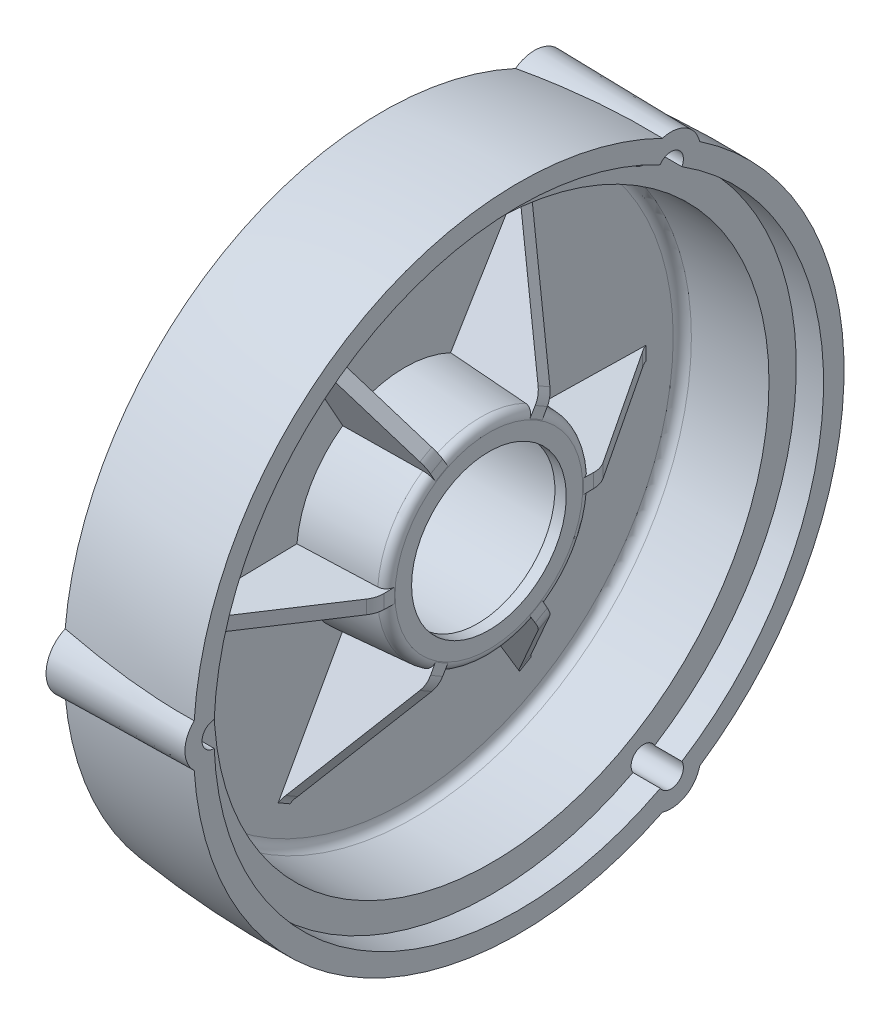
ISO-10303-21;
HEADER;
FILE_DESCRIPTION(('STEP AP214'),'2;1');
FILE_NAME('part.step','',(''),(''),'','','');
FILE_SCHEMA(('AUTOMOTIVE_DESIGN { 1 0 10303 214 1 1 1 1 }'));
ENDSEC;
DATA;
#1=APPLICATION_CONTEXT('core data for automotive mechanical design processes');
#2=APPLICATION_PROTOCOL_DEFINITION('international standard','automotive_design',2000,#1);
#3=PRODUCT_CONTEXT('',#1,'mechanical');
#4=PRODUCT('Part','Part','',(#3));
#5=PRODUCT_RELATED_PRODUCT_CATEGORY('part','',(#4));
#6=PRODUCT_DEFINITION_FORMATION('','',#4);
#7=PRODUCT_DEFINITION_CONTEXT('part definition',#1,'design');
#8=PRODUCT_DEFINITION('design','',#6,#7);
#9=PRODUCT_DEFINITION_SHAPE('','',#8);
#10=(LENGTH_UNIT() NAMED_UNIT(*) SI_UNIT(.MILLI.,.METRE.));
#11=(NAMED_UNIT(*) PLANE_ANGLE_UNIT() SI_UNIT($,.RADIAN.));
#12=(NAMED_UNIT(*) SI_UNIT($,.STERADIAN.) SOLID_ANGLE_UNIT());
#13=UNCERTAINTY_MEASURE_WITH_UNIT(LENGTH_MEASURE(1.E-05),#10,'distance_accuracy_value','');
#14=(GEOMETRIC_REPRESENTATION_CONTEXT(3) GLOBAL_UNCERTAINTY_ASSIGNED_CONTEXT((#13)) GLOBAL_UNIT_ASSIGNED_CONTEXT((#10,
#11,#12)) REPRESENTATION_CONTEXT('',''));
#15=CARTESIAN_POINT('',(0.,0.,0.));
#16=DIRECTION('',(0.,0.,1.));
#17=DIRECTION('',(1.,0.,0.));
#18=AXIS2_PLACEMENT_3D('',#15,#16,#17);
#19=CARTESIAN_POINT('',(-9.06062684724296,57.9116937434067,-33.4353319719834));
#20=DIRECTION('',(1.,0.,0.));
#21=DIRECTION('',(0.,0.,-1.));
#22=AXIS2_PLACEMENT_3D('',#19,#20,#21);
#23=CYLINDRICAL_SURFACE('',#22,2.75000000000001);
#24=CARTESIAN_POINT('',(30.,57.9116937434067,-33.4353319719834));
#25=DIRECTION('',(-1.,0.,0.));
#26=DIRECTION('',(0.,0.,1.));
#27=AXIS2_PLACEMENT_3D('',#24,#25,#26);
#28=CIRCLE('',#27,2.75000000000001);
#29=CARTESIAN_POINT('',(30.,59.3493569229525,-31.0910571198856));
#30=VERTEX_POINT('',#29);
#31=CARTESIAN_POINT('',(30.,56.6003237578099,-35.8525222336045));
#32=VERTEX_POINT('',#31);
#33=EDGE_CURVE('E39',#30,#32,#28,.T.);
#34=ORIENTED_EDGE('',*,*,#33,.F.);
#35=DIRECTION('',(1.,0.,0.));
#36=VECTOR('',#35,1.);
#37=CARTESIAN_POINT('',(10.4696865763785,59.3493569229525,-31.0910571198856));
#38=LINE('',#37,#36);
#39=CARTESIAN_POINT('',(24.,59.3493569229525,-31.0910571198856));
#40=VERTEX_POINT('',#39);
#41=EDGE_CURVE('E900',#40,#30,#38,.T.);
#42=ORIENTED_EDGE('',*,*,#41,.F.);
#43=CARTESIAN_POINT('',(24.,57.9116937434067,-33.4353319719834));
#44=DIRECTION('',(-1.,0.,0.));
#45=DIRECTION('',(0.,0.,1.));
#46=AXIS2_PLACEMENT_3D('',#43,#44,#45);
#47=CIRCLE('',#46,2.75000000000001);
#48=CARTESIAN_POINT('',(24.,56.6003237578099,-35.8525222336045));
#49=VERTEX_POINT('',#48);
#50=EDGE_CURVE('E897',#49,#40,#47,.T.);
#51=ORIENTED_EDGE('',*,*,#50,.F.);
#52=DIRECTION('',(1.,0.,0.));
#53=VECTOR('',#52,1.);
#54=CARTESIAN_POINT('',(10.4696865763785,56.6003237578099,-35.8525222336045));
#55=LINE('',#54,#53);
#56=EDGE_CURVE('E894',#32,#49,#55,.F.);
#57=ORIENTED_EDGE('',*,*,#56,.F.);
#58=EDGE_LOOP('',(#34,#42,#51,#57));
#59=FACE_BOUND('',#58,.T.);
#60=CARTESIAN_POINT('',(10.,57.9116937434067,-33.4353319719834));
#61=DIRECTION('',(-1.,0.,0.));
#62=DIRECTION('',(0.,0.,1.));
#63=AXIS2_PLACEMENT_3D('',#60,#61,#62);
#64=CIRCLE('',#63,2.75000000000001);
#65=CARTESIAN_POINT('',(10.,57.9116937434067,-30.6853319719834));
#66=VERTEX_POINT('',#65);
#67=EDGE_CURVE('E34',#66,#66,#64,.F.);
#68=ORIENTED_EDGE('',*,*,#67,.F.);
#69=EDGE_LOOP('',(#68));
#70=FACE_BOUND('',#69,.T.);
#71=ADVANCED_FACE('F29',(#59,#70),#23,.F.);
#72=CARTESIAN_POINT('',(-9.06062684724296,-57.9116937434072,-33.4353319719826));
#73=DIRECTION('',(1.,0.,0.));
#74=DIRECTION('',(0.,0.,-1.));
#75=AXIS2_PLACEMENT_3D('',#72,#73,#74);
#76=CYLINDRICAL_SURFACE('',#75,2.75000000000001);
#77=CARTESIAN_POINT('',(30.,-57.9116937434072,-33.4353319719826));
#78=DIRECTION('',(-1.,0.,0.));
#79=DIRECTION('',(0.,0.,1.));
#80=AXIS2_PLACEMENT_3D('',#77,#78,#79);
#81=CIRCLE('',#80,2.75000000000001);
#82=CARTESIAN_POINT('',(30.,-56.6003237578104,-35.8525222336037));
#83=VERTEX_POINT('',#82);
#84=CARTESIAN_POINT('',(30.,-59.349356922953,-31.0910571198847));
#85=VERTEX_POINT('',#84);
#86=EDGE_CURVE('E11',#83,#85,#81,.T.);
#87=ORIENTED_EDGE('',*,*,#86,.F.);
#88=DIRECTION('',(1.,0.,0.));
#89=VECTOR('',#88,1.);
#90=CARTESIAN_POINT('',(10.4696865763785,-56.6003237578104,-35.8525222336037));
#91=LINE('',#90,#89);
#92=CARTESIAN_POINT('',(24.,-56.6003237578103,-35.8525222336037));
#93=VERTEX_POINT('',#92);
#94=EDGE_CURVE('E906',#93,#83,#91,.T.);
#95=ORIENTED_EDGE('',*,*,#94,.F.);
#96=CARTESIAN_POINT('',(24.,-57.9116937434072,-33.4353319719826));
#97=DIRECTION('',(-1.,0.,0.));
#98=DIRECTION('',(0.,0.,1.));
#99=AXIS2_PLACEMENT_3D('',#96,#97,#98);
#100=CIRCLE('',#99,2.75000000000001);
#101=CARTESIAN_POINT('',(24.,-59.349356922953,-31.0910571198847));
#102=VERTEX_POINT('',#101);
#103=EDGE_CURVE('E909',#102,#93,#100,.T.);
#104=ORIENTED_EDGE('',*,*,#103,.F.);
#105=DIRECTION('',(1.,0.,0.));
#106=VECTOR('',#105,1.);
#107=CARTESIAN_POINT('',(10.4696865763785,-59.3493569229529,-31.0910571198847));
#108=LINE('',#107,#106);
#109=EDGE_CURVE('E903',#85,#102,#108,.F.);
#110=ORIENTED_EDGE('',*,*,#109,.F.);
#111=EDGE_LOOP('',(#87,#95,#104,#110));
#112=FACE_BOUND('',#111,.T.);
#113=CARTESIAN_POINT('',(10.,-57.9116937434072,-33.4353319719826));
#114=DIRECTION('',(-1.,0.,0.));
#115=DIRECTION('',(0.,0.,1.));
#116=AXIS2_PLACEMENT_3D('',#113,#114,#115);
#117=CIRCLE('',#116,2.75000000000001);
#118=CARTESIAN_POINT('',(10.,-57.9116937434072,-30.6853319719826));
#119=VERTEX_POINT('',#118);
#120=EDGE_CURVE('E968',#119,#119,#117,.F.);
#121=ORIENTED_EDGE('',*,*,#120,.F.);
#122=EDGE_LOOP('',(#121));
#123=FACE_BOUND('',#122,.T.);
#124=ADVANCED_FACE('F823',(#112,#123),#76,.F.);
#125=CARTESIAN_POINT('',(-9.06062684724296,0.,66.8706639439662));
#126=DIRECTION('',(1.,0.,0.));
#127=DIRECTION('',(0.,0.,-1.));
#128=AXIS2_PLACEMENT_3D('',#125,#126,#127);
#129=CYLINDRICAL_SURFACE('',#128,2.75000000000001);
#130=CARTESIAN_POINT('',(30.,0.,66.8706639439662));
#131=DIRECTION('',(1.,0.,0.));
#132=DIRECTION('',(0.,0.,-1.));
#133=AXIS2_PLACEMENT_3D('',#130,#131,#132);
#134=CIRCLE('',#133,2.75000000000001);
#135=CARTESIAN_POINT('',(30.,2.74903316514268,66.9435793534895));
#136=VERTEX_POINT('',#135);
#137=CARTESIAN_POINT('',(30.,-2.74903316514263,66.9435793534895));
#138=VERTEX_POINT('',#137);
#139=EDGE_CURVE('E891',#136,#138,#134,.T.);
#140=ORIENTED_EDGE('',*,*,#139,.T.);
#141=DIRECTION('',(1.,0.,0.));
#142=VECTOR('',#141,1.);
#143=CARTESIAN_POINT('',(10.4696865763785,-2.74903316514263,66.9435793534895));
#144=LINE('',#143,#142);
#145=CARTESIAN_POINT('',(24.,-2.74903316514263,66.9435793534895));
#146=VERTEX_POINT('',#145);
#147=EDGE_CURVE('E888',#146,#138,#144,.T.);
#148=ORIENTED_EDGE('',*,*,#147,.F.);
#149=CARTESIAN_POINT('',(24.,0.,66.8706639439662));
#150=DIRECTION('',(-1.,0.,0.));
#151=DIRECTION('',(0.,0.,1.));
#152=AXIS2_PLACEMENT_3D('',#149,#150,#151);
#153=CIRCLE('',#152,2.75000000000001);
#154=CARTESIAN_POINT('',(24.,2.74903316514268,66.9435793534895));
#155=VERTEX_POINT('',#154);
#156=EDGE_CURVE('E885',#155,#146,#153,.T.);
#157=ORIENTED_EDGE('',*,*,#156,.F.);
#158=DIRECTION('',(1.,0.,0.));
#159=VECTOR('',#158,1.);
#160=CARTESIAN_POINT('',(10.4696865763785,2.74903316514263,66.9435793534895));
#161=LINE('',#160,#159);
#162=EDGE_CURVE('E858',#136,#155,#161,.F.);
#163=ORIENTED_EDGE('',*,*,#162,.F.);
#164=EDGE_LOOP('',(#140,#148,#157,#163));
#165=FACE_BOUND('',#164,.T.);
#166=CARTESIAN_POINT('',(10.,0.,66.8706639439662));
#167=DIRECTION('',(-1.,0.,0.));
#168=DIRECTION('',(0.,0.,1.));
#169=AXIS2_PLACEMENT_3D('',#166,#167,#168);
#170=CIRCLE('',#169,2.75000000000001);
#171=CARTESIAN_POINT('',(10.,0.,69.6206639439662));
#172=VERTEX_POINT('',#171);
#173=EDGE_CURVE('E378',#172,#172,#170,.F.);
#174=ORIENTED_EDGE('',*,*,#173,.F.);
#175=EDGE_LOOP('',(#174));
#176=FACE_BOUND('',#175,.T.);
#177=ADVANCED_FACE('F829',(#165,#176),#129,.F.);
#178=CARTESIAN_POINT('',(25.1764906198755,0.,0.));
#179=DIRECTION('',(-1.,0.,0.));
#180=DIRECTION('',(0.,0.,1.));
#181=AXIS2_PLACEMENT_3D('',#178,#179,#180);
#182=DEGENERATE_TOROIDAL_SURFACE('',#181,132.779812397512,204.336751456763,.F.);
#183=CARTESIAN_POINT('',(30.,0.,0.));
#184=DIRECTION('',(-1.,0.,0.));
#185=DIRECTION('',(0.,0.,1.));
#186=AXIS2_PLACEMENT_3D('',#183,#184,#185);
#187=CIRCLE('',#186,71.5);
#188=CARTESIAN_POINT('',(30.,4.7173503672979,71.3442121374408));
#189=VERTEX_POINT('',#188);
#190=CARTESIAN_POINT('',(30.,64.144575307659,-31.586760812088));
#191=VERTEX_POINT('',#190);
#192=EDGE_CURVE('E387',#189,#191,#187,.T.);
#193=ORIENTED_EDGE('',*,*,#192,.T.);
#194=CARTESIAN_POINT('',(30.0002,64.1445710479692,-31.5867587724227));
#195=CARTESIAN_POINT('',(29.4687356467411,64.1558845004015,-31.5921909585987));
#196=CARTESIAN_POINT('',(28.9372229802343,64.1663225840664,-31.5947068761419));
#197=CARTESIAN_POINT('',(27.8741722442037,64.1854493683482,-31.5938963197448));
#198=CARTESIAN_POINT('',(27.3426341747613,64.1941380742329,-31.5905698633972));
#199=CARTESIAN_POINT('',(26.2796389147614,64.2097669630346,-31.5780651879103));
#200=CARTESIAN_POINT('',(25.7481817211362,64.2167072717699,-31.5688873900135));
#201=CARTESIAN_POINT('',(24.6853804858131,64.2287975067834,-31.5447572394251));
#202=CARTESIAN_POINT('',(24.1540364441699,64.2339474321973,-31.5298048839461));
#203=CARTESIAN_POINT('',(22.5620113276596,64.2466011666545,-31.4765227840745));
#204=CARTESIAN_POINT('',(21.501578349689,64.2513351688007,-31.4297465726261));
#205=CARTESIAN_POINT('',(19.3818420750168,64.2525411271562,-31.3153023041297));
#206=CARTESIAN_POINT('',(18.3225387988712,64.2490129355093,-31.247633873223));
#207=CARTESIAN_POINT('',(15.820823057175,64.2295229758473,-31.0657200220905));
#208=CARTESIAN_POINT('',(14.3790194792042,64.2095103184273,-30.9434843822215));
#209=CARTESIAN_POINT('',(11.498455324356,64.1485444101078,-30.6711192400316));
#210=CARTESIAN_POINT('',(10.0596949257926,64.1075899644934,-30.5209881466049));
#211=CARTESIAN_POINT('',(7.18205342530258,64.0011509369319,-30.1994545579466));
#212=CARTESIAN_POINT('',(5.7431798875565,63.9356092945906,-30.0280032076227));
#213=CARTESIAN_POINT('',(3.5874508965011,63.8164619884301,-29.7602109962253));
#214=CARTESIAN_POINT('',(2.8693407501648,63.7732764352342,-29.6691825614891));
#215=CARTESIAN_POINT('',(1.43395025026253,63.6795809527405,-29.4844042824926));
#216=CARTESIAN_POINT('',(0.716669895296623,63.6290710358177,-29.3906544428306));
#217=CARTESIAN_POINT('',(-0.000200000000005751,63.5747091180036,-29.2959533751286));
#218=B_SPLINE_CURVE_WITH_KNOTS('',3,(#194,#195,#196,#197,#198,#199,#200,#201,#202,#203,#204,
#205,#206,#207,#208,#209,#210,#211,#212,#213,#214,#215,#216,#217),.UNSPECIFIED.,.F.,.F.,(4,2,2,
2,2,2,2,2,2,2,2,4),(0.,1.59482849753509,3.18965219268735,4.78436108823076,6.37907075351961,
9.56321357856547,12.7474133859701,17.0882543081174,21.4293428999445,25.7805689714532,
27.9559637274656,30.1313548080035),.UNSPECIFIED.);
#219=CARTESIAN_POINT('',(0.,63.5747242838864,-29.2959797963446));
#220=VERTEX_POINT('',#219);
#221=EDGE_CURVE('E372',#191,#220,#218,.T.);
#222=ORIENTED_EDGE('',*,*,#221,.T.);
#223=CARTESIAN_POINT('',(0.,0.,0.));
#224=DIRECTION('',(-1.,0.,0.));
#225=DIRECTION('',(0.,0.,1.));
#226=AXIS2_PLACEMENT_3D('',#223,#224,#225);
#227=CIRCLE('',#226,70.);
#228=CARTESIAN_POINT('',(0.,6.41629940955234,69.7053161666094));
#229=VERTEX_POINT('',#228);
#230=EDGE_CURVE('E385',#229,#220,#227,.T.);
#231=ORIENTED_EDGE('',*,*,#230,.F.);
#232=CARTESIAN_POINT('',(-0.000200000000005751,6.41631470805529,69.7052898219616));
#233=CARTESIAN_POINT('',(1.13525134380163,6.32948674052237,69.8548615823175));
#234=CARTESIAN_POINT('',(2.27174555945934,6.23985724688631,69.9948644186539));
#235=CARTESIAN_POINT('',(4.54680854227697,6.05865450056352,70.2554256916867));
#236=CARTESIAN_POINT('',(5.68537731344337,5.96708124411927,70.3759840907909));
#237=CARTESIAN_POINT('',(7.96259972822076,5.78580777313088,70.5971576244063));
#238=CARTESIAN_POINT('',(9.10124980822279,5.69610458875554,70.6978069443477));
#239=CARTESIAN_POINT('',(11.3805830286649,5.52222516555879,70.8791584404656));
#240=CARTESIAN_POINT('',(12.5212662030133,5.43804901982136,70.9598602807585));
#241=CARTESIAN_POINT('',(15.0190773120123,5.26415891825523,71.1143449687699));
#242=CARTESIAN_POINT('',(16.3766009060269,5.17637647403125,71.1839782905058));
#243=CARTESIAN_POINT('',(19.0939394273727,5.02030342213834,71.2944227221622));
#244=CARTESIAN_POINT('',(20.4537542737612,4.95201213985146,71.3352348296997));
#245=CARTESIAN_POINT('',(22.4959854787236,4.86790307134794,71.3746920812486));
#246=CARTESIAN_POINT('',(23.1778338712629,4.84290548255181,71.38421627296));
#247=CARTESIAN_POINT('',(24.5418069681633,4.79947751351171,71.3959581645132));
#248=CARTESIAN_POINT('',(25.2239316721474,4.78104712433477,71.3981758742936));
#249=CARTESIAN_POINT('',(26.5884293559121,4.75104331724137,71.3952957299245));
#250=CARTESIAN_POINT('',(27.2708023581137,4.73947103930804,71.3901966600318));
#251=CARTESIAN_POINT('',(28.6355433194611,4.72322614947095,71.3726855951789));
#252=CARTESIAN_POINT('',(29.3179112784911,4.71855360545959,71.3602735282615));
#253=CARTESIAN_POINT('',(30.0002,4.71735000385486,71.3442074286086));
#254=B_SPLINE_CURVE_WITH_KNOTS('',3,(#232,#233,#234,#235,#236,#237,#238,#239,#240,#241,#242,
#243,#244,#245,#246,#247,#248,#249,#250,#251,#252,#253),.UNSPECIFIED.,.F.,.F.,(4,2,2,2,2,2,2,2,
2,2,4),(0.,3.44559500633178,6.89119667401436,10.3308296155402,13.7705204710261,17.8565435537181,
21.9424251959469,23.9894846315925,26.0365412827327,28.0839381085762,30.131355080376),.UNSPECIFIED.);
#255=EDGE_CURVE('E918',#229,#189,#254,.T.);
#256=ORIENTED_EDGE('',*,*,#255,.T.);
#257=EDGE_LOOP('',(#193,#222,#231,#256));
#258=FACE_BOUND('',#257,.T.);
#259=ADVANCED_FACE('F383',(#258),#182,.F.);
#260=CARTESIAN_POINT('',(0.,57.1584248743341,-40.4093363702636));
#261=VERTEX_POINT('',#260);
#262=CARTESIAN_POINT('',(0.,-57.1584248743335,-40.4093363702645));
#263=VERTEX_POINT('',#262);
#264=EDGE_CURVE('E394',#261,#263,#227,.T.);
#265=ORIENTED_EDGE('',*,*,#264,.F.);
#266=CARTESIAN_POINT('',(-0.000200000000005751,57.1583944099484,-40.4093364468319));
#267=CARTESIAN_POINT('',(1.13525134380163,57.3313413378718,-40.4089271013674));
#268=CARTESIAN_POINT('',(2.27174555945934,57.497402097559,-40.4013071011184));
#269=CARTESIAN_POINT('',(4.54680854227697,57.8136561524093,-40.3746615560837));
#270=CARTESIAN_POINT('',(5.68537731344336,57.9638494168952,-40.3556359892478));
#271=CARTESIAN_POINT('',(7.96259972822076,58.2460280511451,-40.3092353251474));
#272=CARTESIAN_POINT('',(9.10124980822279,58.3780445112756,-40.2818747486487));
#273=CARTESIAN_POINT('',(11.3805830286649,58.6220392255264,-40.2219664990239));
#274=CARTESIAN_POINT('',(12.5212662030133,58.734017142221,-40.1894187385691));
#275=CARTESIAN_POINT('',(15.0190773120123,58.9547498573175,-40.1160678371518));
#276=CARTESIAN_POINT('',(16.3766009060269,59.0589453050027,-40.0748626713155));
#277=CARTESIAN_POINT('',(19.0939394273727,59.2326295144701,-39.9949216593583));
#278=CARTESIAN_POINT('',(20.4537542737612,59.302119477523,-39.9561857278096));
#279=CARTESIAN_POINT('',(22.4959854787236,59.3783449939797,-39.9030737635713));
#280=CARTESIAN_POINT('',(23.1778338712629,59.3990919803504,-39.8861873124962));
#281=CARTESIAN_POINT('',(24.5418069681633,59.430974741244,-39.8544485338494));
#282=CARTESIAN_POINT('',(25.2239316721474,59.4421105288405,-39.8395962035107));
#283=CARTESIAN_POINT('',(26.588429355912,59.454618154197,-39.812172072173));
#284=CARTESIAN_POINT('',(27.2708023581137,59.4559883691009,-39.7996006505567));
#285=CARTESIAN_POINT('',(28.6355433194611,59.4489457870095,-39.7767766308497));
#286=CARTESIAN_POINT('',(29.3179112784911,59.4405328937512,-39.7665240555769));
#287=CARTESIAN_POINT('',(30.0002,59.4272210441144,-39.7574486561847));
#288=B_SPLINE_CURVE_WITH_KNOTS('',3,(#266,#267,#268,#269,#270,#271,#272,#273,#274,#275,#276,
#277,#278,#279,#280,#281,#282,#283,#284,#285,#286,#287),.UNSPECIFIED.,.F.,.F.,(4,2,2,2,2,2,2,2,
2,2,4),(0.,3.44559500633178,6.89119667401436,10.3308296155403,13.7705204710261,17.8565435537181,
21.9424251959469,23.9894846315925,26.0365412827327,28.0839381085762,30.1313550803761),.UNSPECIFIED.);
#289=CARTESIAN_POINT('',(30.,59.4272249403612,-39.7574513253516));
#290=VERTEX_POINT('',#289);
#291=EDGE_CURVE('E375',#261,#290,#288,.T.);
#292=ORIENTED_EDGE('',*,*,#291,.T.);
#293=CARTESIAN_POINT('',(30.,-59.4272249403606,-39.7574513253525));
#294=VERTEX_POINT('',#293);
#295=EDGE_CURVE('E472',#290,#294,#187,.T.);
#296=ORIENTED_EDGE('',*,*,#295,.T.);
#297=CARTESIAN_POINT('',(30.0002,-59.4272210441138,-39.7574486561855));
#298=CARTESIAN_POINT('',(29.4687356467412,-59.4375821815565,-39.7645303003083));
#299=CARTESIAN_POINT('',(28.9372229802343,-59.4449800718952,-39.7723119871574));
#300=CARTESIAN_POINT('',(27.8741722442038,-59.453841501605,-39.7892815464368));
#301=CARTESIAN_POINT('',(27.3426341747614,-59.4553050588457,-39.7984694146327));
#302=CARTESIAN_POINT('',(26.2796389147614,-59.4522901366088,-39.8182567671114));
#303=CARTESIAN_POINT('',(25.7481817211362,-59.447812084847,-39.8288561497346));
#304=CARTESIAN_POINT('',(24.6853804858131,-59.432959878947,-39.8513916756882));
#305=CARTESIAN_POINT('',(24.1540364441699,-59.4225857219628,-39.8633278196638));
#306=CARTESIAN_POINT('',(22.5620113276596,-59.3827689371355,-39.9009273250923));
#307=CARTESIAN_POINT('',(21.501578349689,-59.3446265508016,-39.9284151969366));
#308=CARTESIAN_POINT('',(19.3818420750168,-59.2461178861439,-39.9866817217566));
#309=CARTESIAN_POINT('',(18.3225387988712,-59.1857512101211,-40.0174604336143));
#310=CARTESIAN_POINT('',(15.820823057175,-59.0184642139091,-40.0915385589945));
#311=CARTESIAN_POINT('',(14.3790194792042,-58.9025987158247,-40.1353249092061));
#312=CARTESIAN_POINT('',(11.4984553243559,-58.6362406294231,-40.2187094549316));
#313=CARTESIAN_POINT('',(10.0596949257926,-58.4857460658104,-40.2583074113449));
#314=CARTESIAN_POINT('',(7.18205342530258,-58.1540702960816,-40.3268953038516));
#315=CARTESIAN_POINT('',(5.7431798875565,-57.9728182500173,-40.3558602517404));
#316=CARTESIAN_POINT('',(3.5874508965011,-57.6813297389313,-40.3865717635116));
#317=CARTESIAN_POINT('',(2.86934075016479,-57.5809040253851,-40.3946861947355));
#318=CARTESIAN_POINT('',(1.43395025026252,-57.3740336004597,-40.4059326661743));
#319=CARTESIAN_POINT('',(0.716669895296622,-57.2675888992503,-40.4090647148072));
#320=CARTESIAN_POINT('',(-0.000200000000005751,-57.1583944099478,-40.4093364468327));
#321=B_SPLINE_CURVE_WITH_KNOTS('',3,(#297,#298,#299,#300,#301,#302,#303,#304,#305,#306,#307,
#308,#309,#310,#311,#312,#313,#314,#315,#316,#317,#318,#319,#320),.UNSPECIFIED.,.F.,.F.,(4,2,2,
2,2,2,2,2,2,2,2,4),(0.,1.59482849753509,3.18965219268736,4.78436108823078,6.37907075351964,
9.56321357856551,12.7474133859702,17.0882543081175,21.4293428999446,25.7805689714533,
27.9559637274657,30.1313548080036),.UNSPECIFIED.);
#322=EDGE_CURVE('E938',#294,#263,#321,.T.);
#323=ORIENTED_EDGE('',*,*,#322,.T.);
#324=EDGE_LOOP('',(#265,#292,#296,#323));
#325=FACE_BOUND('',#324,.T.);
#326=ADVANCED_FACE('F1374',(#325),#182,.F.);
#327=CARTESIAN_POINT('',(0.,0.,0.));
#328=DIRECTION('',(-1.,0.,0.));
#329=DIRECTION('',(0.,0.,1.));
#330=AXIS2_PLACEMENT_3D('',#327,#328,#329);
#331=CYLINDRICAL_SURFACE('',#330,67.);
#332=CARTESIAN_POINT('',(30.,0.,0.));
#333=DIRECTION('',(-1.,0.,0.));
#334=DIRECTION('',(0.,0.,1.));
#335=AXIS2_PLACEMENT_3D('',#332,#333,#334);
#336=CIRCLE('',#335,67.);
#337=EDGE_CURVE('E470',#85,#138,#336,.T.);
#338=ORIENTED_EDGE('',*,*,#337,.F.);
#339=ORIENTED_EDGE('',*,*,#109,.T.);
#340=CARTESIAN_POINT('',(24.,0.,0.));
#341=DIRECTION('',(-1.,0.,0.));
#342=DIRECTION('',(0.,0.,1.));
#343=AXIS2_PLACEMENT_3D('',#340,#341,#342);
#344=CIRCLE('',#343,67.);
#345=EDGE_CURVE('E465',#102,#146,#344,.T.);
#346=ORIENTED_EDGE('',*,*,#345,.T.);
#347=ORIENTED_EDGE('',*,*,#147,.T.);
#348=EDGE_LOOP('',(#338,#339,#346,#347));
#349=FACE_BOUND('',#348,.T.);
#350=ADVANCED_FACE('F1364',(#349),#331,.F.);
#351=EDGE_CURVE('E464',#49,#93,#344,.T.);
#352=ORIENTED_EDGE('',*,*,#351,.T.);
#353=ORIENTED_EDGE('',*,*,#94,.T.);
#354=EDGE_CURVE('E469',#32,#83,#336,.T.);
#355=ORIENTED_EDGE('',*,*,#354,.F.);
#356=ORIENTED_EDGE('',*,*,#56,.T.);
#357=EDGE_LOOP('',(#352,#353,#355,#356));
#358=FACE_BOUND('',#357,.T.);
#359=ADVANCED_FACE('F1358',(#358),#331,.F.);
#360=CARTESIAN_POINT('',(21.5788861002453,0.,0.));
#361=DIRECTION('',(-1.,0.,0.));
#362=DIRECTION('',(0.,0.,1.));
#363=AXIS2_PLACEMENT_3D('',#360,#361,#362);
#364=CONICAL_SURFACE('',#363,22.6300979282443,0.0698131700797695);
#365=CARTESIAN_POINT('',(21.5790861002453,-20.3465107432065,-9.90657356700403));
#366=CARTESIAN_POINT('',(18.8058009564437,-20.5487557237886,-9.93416358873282));
#367=CARTESIAN_POINT('',(16.0324989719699,-20.7507868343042,-9.96162401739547));
#368=CARTESIAN_POINT('',(10.4858613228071,-21.1544213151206,-10.0162856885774));
#369=CARTESIAN_POINT('',(7.71252565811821,-21.3560246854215,-10.0434869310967));
#370=CARTESIAN_POINT('',(4.93917315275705,-21.5574141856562,-10.07055858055));
#371=B_SPLINE_CURVE_WITH_KNOTS('',3,(#365,#366,#367,#368,#369,#370),.UNSPECIFIED.,.F.,.F.,(4,2,
4),(0.,8.34236003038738,16.6847200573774),.UNSPECIFIED.);
#372=CARTESIAN_POINT('',(21.5788861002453,-20.3465253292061,-9.90657555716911));
#373=VERTEX_POINT('',#372);
#374=CARTESIAN_POINT('',(4.93937315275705,-21.5573996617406,-10.0705566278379));
#375=VERTEX_POINT('',#374);
#376=EDGE_CURVE('E616',#373,#375,#371,.T.);
#377=ORIENTED_EDGE('',*,*,#376,.F.);
#378=CARTESIAN_POINT('',(21.5788861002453,0.,0.));
#379=DIRECTION('',(-1.,0.,0.));
#380=DIRECTION('',(0.,0.,1.));
#381=AXIS2_PLACEMENT_3D('',#378,#379,#380);
#382=CIRCLE('',#381,22.6300979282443);
#383=CARTESIAN_POINT('',(21.5788861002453,-20.3465253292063,9.90657555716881));
#384=VERTEX_POINT('',#383);
#385=EDGE_CURVE('E445',#373,#384,#382,.T.);
#386=ORIENTED_EDGE('',*,*,#385,.T.);
#387=CARTESIAN_POINT('',(21.5790861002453,-20.3465107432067,9.90657356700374));
#388=CARTESIAN_POINT('',(18.8058009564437,-20.5487557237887,9.93416358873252));
#389=CARTESIAN_POINT('',(16.0324989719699,-20.7507868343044,9.96162401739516));
#390=CARTESIAN_POINT('',(10.4858613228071,-21.1544213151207,10.0162856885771));
#391=CARTESIAN_POINT('',(7.71252565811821,-21.3560246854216,10.0434869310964));
#392=CARTESIAN_POINT('',(4.93917315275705,-21.5574141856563,10.0705585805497));
#393=B_SPLINE_CURVE_WITH_KNOTS('',3,(#387,#388,#389,#390,#391,#392),.UNSPECIFIED.,.F.,.F.,(4,2,
4),(0.,8.34236003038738,16.6847200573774),.UNSPECIFIED.);
#394=CARTESIAN_POINT('',(4.93937315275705,-21.5573996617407,10.0705566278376));
#395=VERTEX_POINT('',#394);
#396=EDGE_CURVE('E608',#384,#395,#393,.T.);
#397=ORIENTED_EDGE('',*,*,#396,.T.);
#398=CARTESIAN_POINT('',(4.93937315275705,0.,0.));
#399=DIRECTION('',(-1.,0.,0.));
#400=DIRECTION('',(0.,0.,1.));
#401=AXIS2_PLACEMENT_3D('',#398,#399,#400);
#402=CIRCLE('',#401,23.7936460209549);
#403=EDGE_CURVE('E450',#375,#395,#402,.T.);
#404=ORIENTED_EDGE('',*,*,#403,.F.);
#405=EDGE_LOOP('',(#377,#386,#397,#404));
#406=FACE_BOUND('',#405,.T.);
#407=ADVANCED_FACE('F531',(#406),#364,.T.);
#408=CARTESIAN_POINT('',(21.5790861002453,-18.7525997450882,12.6673083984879));
#409=CARTESIAN_POINT('',(18.8058009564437,-18.8776158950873,12.8286626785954));
#410=CARTESIAN_POINT('',(16.0324989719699,-19.0024128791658,12.9898965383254));
#411=CARTESIAN_POINT('',(10.4858613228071,-19.2515685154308,13.3121234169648));
#412=CARTESIAN_POINT('',(7.71252565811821,-19.3759271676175,13.4731164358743));
#413=CARTESIAN_POINT('',(4.93917315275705,-19.5000666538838,13.6339890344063));
#414=B_SPLINE_CURVE_WITH_KNOTS('',3,(#408,#409,#410,#411,#412,#413),.UNSPECIFIED.,.F.,.F.,(4,2,
4),(0.,8.34236003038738,16.6847200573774),.UNSPECIFIED.);
#415=CARTESIAN_POINT('',(21.5788861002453,-18.7526087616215,12.6673200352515));
#416=VERTEX_POINT('',#415);
#417=CARTESIAN_POINT('',(4.93937315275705,-19.5000577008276,13.6339774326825));
#418=VERTEX_POINT('',#417);
#419=EDGE_CURVE('E600',#416,#418,#414,.T.);
#420=ORIENTED_EDGE('',*,*,#419,.F.);
#421=CARTESIAN_POINT('',(21.5788861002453,-1.59391656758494,22.5738955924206));
#422=VERTEX_POINT('',#421);
#423=EDGE_CURVE('E1642',#416,#422,#382,.T.);
#424=ORIENTED_EDGE('',*,*,#423,.T.);
#425=CARTESIAN_POINT('',(21.5790861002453,-1.59391099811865,22.5738819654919));
#426=CARTESIAN_POINT('',(18.8058009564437,-1.67113982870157,22.7628262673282));
#427=CARTESIAN_POINT('',(16.0324989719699,-1.74837395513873,22.9515205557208));
#428=CARTESIAN_POINT('',(10.4858613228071,-1.90285279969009,23.3284091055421));
#429=CARTESIAN_POINT('',(7.71252565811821,-1.98009751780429,23.5166033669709));
#430=CARTESIAN_POINT('',(4.93917315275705,-2.05734753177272,23.7045476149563));
#431=B_SPLINE_CURVE_WITH_KNOTS('',3,(#425,#426,#427,#428,#429,#430),.UNSPECIFIED.,.F.,.F.,(4,2,
4),(0.,8.34236003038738,16.6847200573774),.UNSPECIFIED.);
#432=CARTESIAN_POINT('',(4.93937315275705,-2.05734196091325,23.7045340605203));
#433=VERTEX_POINT('',#432);
#434=EDGE_CURVE('E591',#422,#433,#431,.T.);
#435=ORIENTED_EDGE('',*,*,#434,.T.);
#436=EDGE_CURVE('E1892',#418,#433,#402,.T.);
#437=ORIENTED_EDGE('',*,*,#436,.F.);
#438=EDGE_LOOP('',(#420,#424,#435,#437));
#439=FACE_BOUND('',#438,.T.);
#440=ADVANCED_FACE('F1601',(#439),#364,.T.);
#441=CARTESIAN_POINT('',(21.5790861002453,18.752599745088,12.6673083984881));
#442=CARTESIAN_POINT('',(18.8058009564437,18.8776158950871,12.8286626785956));
#443=CARTESIAN_POINT('',(16.0324989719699,19.0024128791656,12.9898965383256));
#444=CARTESIAN_POINT('',(10.4858613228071,19.2515685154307,13.312123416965));
#445=CARTESIAN_POINT('',(7.71252565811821,19.3759271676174,13.4731164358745));
#446=CARTESIAN_POINT('',(4.93917315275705,19.5000666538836,13.6339890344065));
#447=B_SPLINE_CURVE_WITH_KNOTS('',3,(#441,#442,#443,#444,#445,#446),.UNSPECIFIED.,.F.,.F.,(4,2,
4),(0.,8.34236003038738,16.6847200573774),.UNSPECIFIED.);
#448=CARTESIAN_POINT('',(21.5788861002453,18.7526087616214,12.6673200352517));
#449=VERTEX_POINT('',#448);
#450=CARTESIAN_POINT('',(4.93937315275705,19.5000577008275,13.6339774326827));
#451=VERTEX_POINT('',#450);
#452=EDGE_CURVE('E573',#449,#451,#447,.T.);
#453=ORIENTED_EDGE('',*,*,#452,.T.);
#454=CARTESIAN_POINT('',(4.93937315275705,2.05734196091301,23.7045340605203));
#455=VERTEX_POINT('',#454);
#456=EDGE_CURVE('E1893',#455,#451,#402,.T.);
#457=ORIENTED_EDGE('',*,*,#456,.F.);
#458=CARTESIAN_POINT('',(21.5790861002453,1.59391099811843,22.5738819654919));
#459=CARTESIAN_POINT('',(18.8058009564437,1.67113982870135,22.7628262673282));
#460=CARTESIAN_POINT('',(16.0324989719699,1.74837395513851,22.9515205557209));
#461=CARTESIAN_POINT('',(10.4858613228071,1.90285279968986,23.3284091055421));
#462=CARTESIAN_POINT('',(7.71252565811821,1.98009751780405,23.5166033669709));
#463=CARTESIAN_POINT('',(4.93917315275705,2.05734753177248,23.7045476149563));
#464=B_SPLINE_CURVE_WITH_KNOTS('',3,(#458,#459,#460,#461,#462,#463),.UNSPECIFIED.,.F.,.F.,(4,2,
4),(0.,8.34236003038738,16.6847200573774),.UNSPECIFIED.);
#465=CARTESIAN_POINT('',(21.5788861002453,1.59391656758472,22.5738955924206));
#466=VERTEX_POINT('',#465);
#467=EDGE_CURVE('E582',#466,#455,#464,.T.);
#468=ORIENTED_EDGE('',*,*,#467,.F.);
#469=EDGE_CURVE('E1784',#466,#449,#382,.T.);
#470=ORIENTED_EDGE('',*,*,#469,.T.);
#471=EDGE_LOOP('',(#453,#457,#468,#470));
#472=FACE_BOUND('',#471,.T.);
#473=ADVANCED_FACE('F1594',(#472),#364,.T.);
#474=CARTESIAN_POINT('',(21.5790861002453,20.3465107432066,-9.90657356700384));
#475=CARTESIAN_POINT('',(18.8058009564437,20.5487557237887,-9.93416358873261));
#476=CARTESIAN_POINT('',(16.0324989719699,20.7507868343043,-9.96162401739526));
#477=CARTESIAN_POINT('',(10.4858613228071,21.1544213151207,-10.0162856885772));
#478=CARTESIAN_POINT('',(7.71252565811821,21.3560246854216,-10.0434869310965));
#479=CARTESIAN_POINT('',(4.93917315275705,21.5574141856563,-10.0705585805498));
#480=B_SPLINE_CURVE_WITH_KNOTS('',3,(#474,#475,#476,#477,#478,#479),.UNSPECIFIED.,.F.,.F.,(4,2,
4),(0.,8.34236003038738,16.6847200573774),.UNSPECIFIED.);
#481=CARTESIAN_POINT('',(21.5788861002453,20.3465253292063,-9.90657555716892));
#482=VERTEX_POINT('',#481);
#483=CARTESIAN_POINT('',(4.93937315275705,21.5573996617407,-10.0705566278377));
#484=VERTEX_POINT('',#483);
#485=EDGE_CURVE('E555',#482,#484,#480,.T.);
#486=ORIENTED_EDGE('',*,*,#485,.T.);
#487=CARTESIAN_POINT('',(4.93937315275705,21.5573996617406,10.0705566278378));
#488=VERTEX_POINT('',#487);
#489=EDGE_CURVE('E1894',#488,#484,#402,.T.);
#490=ORIENTED_EDGE('',*,*,#489,.F.);
#491=CARTESIAN_POINT('',(21.5790861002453,20.3465107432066,9.90657356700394));
#492=CARTESIAN_POINT('',(18.8058009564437,20.5487557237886,9.93416358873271));
#493=CARTESIAN_POINT('',(16.0324989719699,20.7507868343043,9.96162401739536));
#494=CARTESIAN_POINT('',(10.4858613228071,21.1544213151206,10.0162856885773));
#495=CARTESIAN_POINT('',(7.71252565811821,21.3560246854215,10.0434869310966));
#496=CARTESIAN_POINT('',(4.93917315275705,21.5574141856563,10.0705585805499));
#497=B_SPLINE_CURVE_WITH_KNOTS('',3,(#491,#492,#493,#494,#495,#496),.UNSPECIFIED.,.F.,.F.,(4,2,
4),(0.,8.34236003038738,16.6847200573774),.UNSPECIFIED.);
#498=CARTESIAN_POINT('',(21.5788861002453,20.3465253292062,9.90657555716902));
#499=VERTEX_POINT('',#498);
#500=EDGE_CURVE('E564',#499,#488,#497,.T.);
#501=ORIENTED_EDGE('',*,*,#500,.F.);
#502=EDGE_CURVE('E1889',#499,#482,#382,.T.);
#503=ORIENTED_EDGE('',*,*,#502,.T.);
#504=EDGE_LOOP('',(#486,#490,#501,#503));
#505=FACE_BOUND('',#504,.T.);
#506=ADVANCED_FACE('F1588',(#505),#364,.T.);
#507=CARTESIAN_POINT('',(21.5790861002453,1.59391099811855,-22.5738819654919));
#508=CARTESIAN_POINT('',(18.8058009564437,1.67113982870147,-22.7628262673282));
#509=CARTESIAN_POINT('',(16.0324989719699,1.74837395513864,-22.9515205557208));
#510=CARTESIAN_POINT('',(10.4858613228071,1.90285279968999,-23.3284091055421));
#511=CARTESIAN_POINT('',(7.71252565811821,1.98009751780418,-23.5166033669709));
#512=CARTESIAN_POINT('',(4.93917315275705,2.0573475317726,-23.7045476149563));
#513=B_SPLINE_CURVE_WITH_KNOTS('',3,(#507,#508,#509,#510,#511,#512),.UNSPECIFIED.,.F.,.F.,(4,2,
4),(0.,8.34236003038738,16.6847200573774),.UNSPECIFIED.);
#514=CARTESIAN_POINT('',(21.5788861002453,1.59391656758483,-22.5738955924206));
#515=VERTEX_POINT('',#514);
#516=CARTESIAN_POINT('',(4.93937315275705,2.05734196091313,-23.7045340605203));
#517=VERTEX_POINT('',#516);
#518=EDGE_CURVE('E517',#515,#517,#513,.T.);
#519=ORIENTED_EDGE('',*,*,#518,.T.);
#520=CARTESIAN_POINT('',(4.93937315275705,19.5000577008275,-13.6339774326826));
#521=VERTEX_POINT('',#520);
#522=EDGE_CURVE('E451',#521,#517,#402,.T.);
#523=ORIENTED_EDGE('',*,*,#522,.F.);
#524=CARTESIAN_POINT('',(21.5790861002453,18.7525997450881,-12.667308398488));
#525=CARTESIAN_POINT('',(18.8058009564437,18.8776158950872,-12.8286626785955));
#526=CARTESIAN_POINT('',(16.0324989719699,19.0024128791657,-12.9898965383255));
#527=CARTESIAN_POINT('',(10.4858613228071,19.2515685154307,-13.3121234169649));
#528=CARTESIAN_POINT('',(7.71252565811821,19.3759271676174,-13.4731164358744));
#529=CARTESIAN_POINT('',(4.93917315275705,19.5000666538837,-13.6339890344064));
#530=B_SPLINE_CURVE_WITH_KNOTS('',3,(#524,#525,#526,#527,#528,#529),.UNSPECIFIED.,.F.,.F.,(4,2,
4),(0.,8.34236003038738,16.6847200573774),.UNSPECIFIED.);
#531=CARTESIAN_POINT('',(21.5788861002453,18.7526087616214,-12.6673200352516));
#532=VERTEX_POINT('',#531);
#533=EDGE_CURVE('E547',#532,#521,#530,.T.);
#534=ORIENTED_EDGE('',*,*,#533,.F.);
#535=EDGE_CURVE('E446',#532,#515,#382,.T.);
#536=ORIENTED_EDGE('',*,*,#535,.T.);
#537=EDGE_LOOP('',(#519,#523,#534,#536));
#538=FACE_BOUND('',#537,.T.);
#539=ADVANCED_FACE('F532',(#538),#364,.T.);
#540=CARTESIAN_POINT('',(0.,-63.574724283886,-29.2959797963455));
#541=VERTEX_POINT('',#540);
#542=CARTESIAN_POINT('',(0.,-6.41629940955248,69.7053161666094));
#543=VERTEX_POINT('',#542);
#544=EDGE_CURVE('E396',#541,#543,#227,.T.);
#545=ORIENTED_EDGE('',*,*,#544,.F.);
#546=CARTESIAN_POINT('',(-0.000200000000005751,-63.5747091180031,-29.2959533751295));
#547=CARTESIAN_POINT('',(1.13525134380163,-63.6608280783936,-29.4459344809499));
#548=CARTESIAN_POINT('',(2.27174555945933,-63.7372593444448,-29.5935573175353));
#549=CARTESIAN_POINT('',(4.54680854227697,-63.8723106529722,-29.8807641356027));
#550=CARTESIAN_POINT('',(5.68537731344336,-63.9309306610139,-30.0203481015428));
#551=CARTESIAN_POINT('',(7.96259972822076,-64.0318358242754,-30.2879222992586));
#552=CARTESIAN_POINT('',(9.10124980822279,-64.0741491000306,-30.4159321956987));
#553=CARTESIAN_POINT('',(11.3805830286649,-64.1442643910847,-30.6571919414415));
#554=CARTESIAN_POINT('',(12.5212662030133,-64.1720661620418,-30.7704415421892));
#555=CARTESIAN_POINT('',(15.0190773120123,-64.2189087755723,-30.9982771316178));
#556=CARTESIAN_POINT('',(16.3766009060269,-64.2353217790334,-31.10911561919));
#557=CARTESIAN_POINT('',(19.0939394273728,-64.252932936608,-31.2995010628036));
#558=CARTESIAN_POINT('',(20.4537542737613,-64.254131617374,-31.3790491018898));
#559=CARTESIAN_POINT('',(22.4959854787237,-64.2462480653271,-31.471618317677));
#560=CARTESIAN_POINT('',(23.177833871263,-64.2419974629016,-31.4980289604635));
#561=CARTESIAN_POINT('',(24.5418069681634,-64.2304522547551,-31.5415096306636));
#562=CARTESIAN_POINT('',(25.2239316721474,-64.2231576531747,-31.5585796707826));
#563=CARTESIAN_POINT('',(26.5884293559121,-64.2056614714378,-31.5831236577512));
#564=CARTESIAN_POINT('',(27.2708023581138,-64.1954594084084,-31.5905960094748));
#565=CARTESIAN_POINT('',(28.6355433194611,-64.1721719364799,-31.595908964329));
#566=CARTESIAN_POINT('',(29.3179112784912,-64.1590864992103,-31.5937494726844));
#567=CARTESIAN_POINT('',(30.0002,-64.1445710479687,-31.5867587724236));
#568=B_SPLINE_CURVE_WITH_KNOTS('',3,(#546,#547,#548,#549,#550,#551,#552,#553,#554,#555,#556,
#557,#558,#559,#560,#561,#562,#563,#564,#565,#566,#567),.UNSPECIFIED.,.F.,.F.,(4,2,2,2,2,2,2,2,
2,2,4),(0.,3.44559500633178,6.89119667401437,10.3308296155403,13.7705204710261,17.8565435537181,
21.9424251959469,23.9894846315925,26.0365412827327,28.0839381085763,30.1313550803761),.UNSPECIFIED.);
#569=CARTESIAN_POINT('',(30.,-64.1445753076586,-31.5867608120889));
#570=VERTEX_POINT('',#569);
#571=EDGE_CURVE('E944',#541,#570,#568,.T.);
#572=ORIENTED_EDGE('',*,*,#571,.T.);
#573=CARTESIAN_POINT('',(30.,-4.71735036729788,71.3442121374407));
#574=VERTEX_POINT('',#573);
#575=EDGE_CURVE('E473',#570,#574,#187,.T.);
#576=ORIENTED_EDGE('',*,*,#575,.T.);
#577=CARTESIAN_POINT('',(30.0002,-4.71735000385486,71.3442074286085));
#578=CARTESIAN_POINT('',(29.4687356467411,-4.71830231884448,71.3567212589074));
#579=CARTESIAN_POINT('',(28.9372229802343,-4.72134251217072,71.3670188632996));
#580=CARTESIAN_POINT('',(27.8741722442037,-4.73160786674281,71.3831778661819));
#581=CARTESIAN_POINT('',(27.3426341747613,-4.73883301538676,71.3890392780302));
#582=CARTESIAN_POINT('',(26.2796389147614,-4.75747682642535,71.3963219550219));
#583=CARTESIAN_POINT('',(25.7481817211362,-4.7688951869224,71.3977435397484));
#584=CARTESIAN_POINT('',(24.6853804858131,-4.79583762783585,71.3961489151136));
#585=CARTESIAN_POINT('',(24.1540364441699,-4.81136171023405,71.3931327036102));
#586=CARTESIAN_POINT('',(22.5620113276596,-4.86383222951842,71.377450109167));
#587=CARTESIAN_POINT('',(21.501578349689,-4.90670861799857,71.358161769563));
#588=CARTESIAN_POINT('',(19.3818420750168,-5.0064232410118,71.3019840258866));
#589=CARTESIAN_POINT('',(18.3225387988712,-5.06326172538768,71.2650943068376));
#590=CARTESIAN_POINT('',(15.820823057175,-5.2110587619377,71.1572585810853));
#591=CARTESIAN_POINT('',(14.3790194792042,-5.30691160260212,71.0788092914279));
#592=CARTESIAN_POINT('',(11.498455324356,-5.51230378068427,70.8898286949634));
#593=CARTESIAN_POINT('',(10.0596949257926,-5.62184389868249,70.7792955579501));
#594=CARTESIAN_POINT('',(7.18205342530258,-5.84708064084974,70.5263498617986));
#595=CARTESIAN_POINT('',(5.7431798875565,-5.96279104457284,70.3838634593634));
#596=CARTESIAN_POINT('',(3.5874508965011,-6.13513224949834,70.1467827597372));
#597=CARTESIAN_POINT('',(2.8693407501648,-6.19237240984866,70.0638687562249));
#598=CARTESIAN_POINT('',(1.43395025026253,-6.30554735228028,69.8903369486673));
#599=CARTESIAN_POINT('',(0.716669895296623,-6.36148213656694,69.7997191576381));
#600=CARTESIAN_POINT('',(-0.000200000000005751,-6.4163147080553,69.7052898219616));
#601=B_SPLINE_CURVE_WITH_KNOTS('',3,(#577,#578,#579,#580,#581,#582,#583,#584,#585,#586,#587,
#588,#589,#590,#591,#592,#593,#594,#595,#596,#597,#598,#599,#600),.UNSPECIFIED.,.F.,.F.,(4,2,2,
2,2,2,2,2,2,2,2,4),(0.,1.59482849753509,3.18965219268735,4.78436108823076,6.37907075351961,
9.56321357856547,12.7474133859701,17.0882543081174,21.4293428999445,25.7805689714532,
27.9559637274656,30.1313548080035),.UNSPECIFIED.);
#602=EDGE_CURVE('E912',#574,#543,#601,.T.);
#603=ORIENTED_EDGE('',*,*,#602,.T.);
#604=EDGE_LOOP('',(#545,#572,#576,#603));
#605=FACE_BOUND('',#604,.T.);
#606=ADVANCED_FACE('F31',(#605),#182,.F.);
#607=CARTESIAN_POINT('',(0.,29.,0.));
#608=DIRECTION('',(1.,0.,0.));
#609=DIRECTION('',(0.,0.,-1.));
#610=AXIS2_PLACEMENT_3D('',#607,#608,#609);
#611=PLANE('',#610);
#612=CARTESIAN_POINT('',(0.,57.9116937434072,-33.4353319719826));
#613=DIRECTION('',(-1.,0.,0.));
#614=DIRECTION('',(0.,0.,1.));
#615=AXIS2_PLACEMENT_3D('',#612,#613,#614);
#616=CIRCLE('',#615,5.);
#617=CARTESIAN_POINT('',(0.,57.9116937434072,-28.4353319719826));
#618=VERTEX_POINT('',#617);
#619=EDGE_CURVE('E978',#618,#618,#616,.T.);
#620=ORIENTED_EDGE('',*,*,#619,.F.);
#621=EDGE_LOOP('',(#620));
#622=FACE_BOUND('',#621,.T.);
#623=CARTESIAN_POINT('',(0.,-57.9116937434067,-33.4353319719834));
#624=DIRECTION('',(-1.,0.,0.));
#625=DIRECTION('',(0.,0.,1.));
#626=AXIS2_PLACEMENT_3D('',#623,#624,#625);
#627=CIRCLE('',#626,4.99999999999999);
#628=CARTESIAN_POINT('',(0.,-57.9116937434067,-28.4353319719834));
#629=VERTEX_POINT('',#628);
#630=EDGE_CURVE('E972',#629,#629,#627,.T.);
#631=ORIENTED_EDGE('',*,*,#630,.F.);
#632=EDGE_LOOP('',(#631));
#633=FACE_BOUND('',#632,.T.);
#634=CARTESIAN_POINT('',(0.,0.,66.8706639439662));
#635=DIRECTION('',(-1.,0.,0.));
#636=DIRECTION('',(0.,0.,1.));
#637=AXIS2_PLACEMENT_3D('',#634,#635,#636);
#638=CIRCLE('',#637,5.);
#639=CARTESIAN_POINT('',(0.,0.,71.8706639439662));
#640=VERTEX_POINT('',#639);
#641=EDGE_CURVE('E965',#640,#640,#638,.T.);
#642=ORIENTED_EDGE('',*,*,#641,.F.);
#643=EDGE_LOOP('',(#642));
#644=FACE_BOUND('',#643,.T.);
#645=CARTESIAN_POINT('',(0.,0.,0.));
#646=DIRECTION('',(-1.,0.,0.));
#647=DIRECTION('',(0.,0.,1.));
#648=AXIS2_PLACEMENT_3D('',#645,#646,#647);
#649=CIRCLE('',#648,29.);
#650=CARTESIAN_POINT('',(0.,0.,29.));
#651=VERTEX_POINT('',#650);
#652=EDGE_CURVE('E400',#651,#651,#649,.T.);
#653=ORIENTED_EDGE('',*,*,#652,.F.);
#654=EDGE_LOOP('',(#653));
#655=FACE_BOUND('',#654,.T.);
#656=ORIENTED_EDGE('',*,*,#230,.T.);
#657=CARTESIAN_POINT('',(0.,57.9430799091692,-33.4534527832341));
#658=DIRECTION('',(-1.,0.,0.));
#659=DIRECTION('',(0.,0.,1.));
#660=AXIS2_PLACEMENT_3D('',#657,#658,#659);
#661=CIRCLE('',#660,7.00000000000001);
#662=EDGE_CURVE('E47',#220,#261,#661,.T.);
#663=ORIENTED_EDGE('',*,*,#662,.T.);
#664=ORIENTED_EDGE('',*,*,#264,.T.);
#665=CARTESIAN_POINT('',(0.,-57.9430799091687,-33.4534527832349));
#666=DIRECTION('',(-1.,0.,0.));
#667=DIRECTION('',(0.,0.,1.));
#668=AXIS2_PLACEMENT_3D('',#665,#666,#667);
#669=CIRCLE('',#668,7.00000000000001);
#670=EDGE_CURVE('E53',#263,#541,#669,.T.);
#671=ORIENTED_EDGE('',*,*,#670,.T.);
#672=ORIENTED_EDGE('',*,*,#544,.T.);
#673=CARTESIAN_POINT('',(0.,0.,66.9069055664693));
#674=DIRECTION('',(-1.,0.,0.));
#675=DIRECTION('',(0.,0.,1.));
#676=AXIS2_PLACEMENT_3D('',#673,#674,#675);
#677=CIRCLE('',#676,7.00000000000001);
#678=EDGE_CURVE('E391',#543,#229,#677,.T.);
#679=ORIENTED_EDGE('',*,*,#678,.T.);
#680=EDGE_LOOP('',(#656,#663,#664,#671,#672,#679));
#681=FACE_BOUND('',#680,.T.);
#682=ADVANCED_FACE('F389',(#622,#633,#644,#655,#681),#611,.F.);
#683=CARTESIAN_POINT('',(-5.,0.,0.));
#684=DIRECTION('',(-1.,0.,0.));
#685=DIRECTION('',(0.,0.,1.));
#686=AXIS2_PLACEMENT_3D('',#683,#684,#685);
#687=TOROIDAL_SURFACE('',#686,29.,5.);
#688=ORIENTED_EDGE('',*,*,#652,.T.);
#689=EDGE_LOOP('',(#688));
#690=FACE_BOUND('',#689,.T.);
#691=CARTESIAN_POINT('',(-5.,0.,0.));
#692=DIRECTION('',(-1.,0.,0.));
#693=DIRECTION('',(0.,0.,1.));
#694=AXIS2_PLACEMENT_3D('',#691,#692,#693);
#695=CIRCLE('',#694,24.);
#696=CARTESIAN_POINT('',(-5.,0.,24.));
#697=VERTEX_POINT('',#696);
#698=EDGE_CURVE('E403',#697,#697,#695,.T.);
#699=ORIENTED_EDGE('',*,*,#698,.F.);
#700=EDGE_LOOP('',(#699));
#701=FACE_BOUND('',#700,.T.);
#702=ADVANCED_FACE('F986',(#690,#701),#687,.F.);
#703=CARTESIAN_POINT('',(0.,0.,0.));
#704=DIRECTION('',(-1.,0.,0.));
#705=DIRECTION('',(0.,0.,1.));
#706=AXIS2_PLACEMENT_3D('',#703,#704,#705);
#707=CYLINDRICAL_SURFACE('',#706,24.);
#708=ORIENTED_EDGE('',*,*,#698,.T.);
#709=EDGE_LOOP('',(#708));
#710=FACE_BOUND('',#709,.T.);
#711=CARTESIAN_POINT('',(-7.06062684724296,0.,0.));
#712=DIRECTION('',(-1.,0.,0.));
#713=DIRECTION('',(0.,0.,1.));
#714=AXIS2_PLACEMENT_3D('',#711,#712,#713);
#715=CIRCLE('',#714,24.);
#716=CARTESIAN_POINT('',(-7.06062684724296,0.,24.));
#717=VERTEX_POINT('',#716);
#718=EDGE_CURVE('E407',#717,#717,#715,.T.);
#719=ORIENTED_EDGE('',*,*,#718,.F.);
#720=EDGE_LOOP('',(#719));
#721=FACE_BOUND('',#720,.T.);
#722=ADVANCED_FACE('F1544',(#710,#721),#707,.T.);
#723=CARTESIAN_POINT('',(-7.06062684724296,0.,0.));
#724=DIRECTION('',(-1.,0.,0.));
#725=DIRECTION('',(0.,0.,1.));
#726=AXIS2_PLACEMENT_3D('',#723,#724,#725);
#727=TOROIDAL_SURFACE('',#726,22.,2.);
#728=ORIENTED_EDGE('',*,*,#718,.T.);
#729=EDGE_LOOP('',(#728));
#730=FACE_BOUND('',#729,.T.);
#731=CARTESIAN_POINT('',(-9.06062684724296,0.,0.));
#732=DIRECTION('',(-1.,0.,0.));
#733=DIRECTION('',(0.,0.,1.));
#734=AXIS2_PLACEMENT_3D('',#731,#732,#733);
#735=CIRCLE('',#734,22.);
#736=CARTESIAN_POINT('',(-9.06062684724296,0.,22.));
#737=VERTEX_POINT('',#736);
#738=EDGE_CURVE('E412',#737,#737,#735,.T.);
#739=ORIENTED_EDGE('',*,*,#738,.F.);
#740=EDGE_LOOP('',(#739));
#741=FACE_BOUND('',#740,.T.);
#742=ADVANCED_FACE('F1535',(#730,#741),#727,.T.);
#743=CARTESIAN_POINT('',(-9.06062684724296,20.,0.));
#744=DIRECTION('',(1.,0.,0.));
#745=DIRECTION('',(0.,0.,-1.));
#746=AXIS2_PLACEMENT_3D('',#743,#744,#745);
#747=PLANE('',#746);
#748=CARTESIAN_POINT('',(-9.06062684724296,0.,0.));
#749=DIRECTION('',(-1.,0.,0.));
#750=DIRECTION('',(0.,0.,1.));
#751=AXIS2_PLACEMENT_3D('',#748,#749,#750);
#752=CIRCLE('',#751,20.);
#753=CARTESIAN_POINT('',(-9.06062684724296,0.,20.));
#754=VERTEX_POINT('',#753);
#755=EDGE_CURVE('E415',#754,#754,#752,.T.);
#756=ORIENTED_EDGE('',*,*,#755,.F.);
#757=EDGE_LOOP('',(#756));
#758=FACE_BOUND('',#757,.T.);
#759=ORIENTED_EDGE('',*,*,#738,.T.);
#760=EDGE_LOOP('',(#759));
#761=FACE_BOUND('',#760,.T.);
#762=ADVANCED_FACE('F1526',(#758,#761),#747,.F.);
#763=CARTESIAN_POINT('',(0.,0.,0.));
#764=DIRECTION('',(-1.,0.,0.));
#765=DIRECTION('',(0.,0.,1.));
#766=AXIS2_PLACEMENT_3D('',#763,#764,#765);
#767=CYLINDRICAL_SURFACE('',#766,20.);
#768=CARTESIAN_POINT('',(-7.26062684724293,0.,0.));
#769=DIRECTION('',(-1.,0.,0.));
#770=DIRECTION('',(0.,0.,1.));
#771=AXIS2_PLACEMENT_3D('',#768,#769,#770);
#772=CIRCLE('',#771,20.);
#773=CARTESIAN_POINT('',(-7.26062684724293,0.,20.));
#774=VERTEX_POINT('',#773);
#775=EDGE_CURVE('E418',#774,#774,#772,.T.);
#776=ORIENTED_EDGE('',*,*,#775,.F.);
#777=EDGE_LOOP('',(#776));
#778=FACE_BOUND('',#777,.T.);
#779=ORIENTED_EDGE('',*,*,#755,.T.);
#780=EDGE_LOOP('',(#779));
#781=FACE_BOUND('',#780,.T.);
#782=ADVANCED_FACE('F1517',(#778,#781),#767,.F.);
#783=CARTESIAN_POINT('',(-7.26062684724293,20.,0.));
#784=DIRECTION('',(-1.,0.,0.));
#785=DIRECTION('',(0.,0.,1.));
#786=AXIS2_PLACEMENT_3D('',#783,#784,#785);
#787=PLANE('',#786);
#788=ORIENTED_EDGE('',*,*,#775,.T.);
#789=EDGE_LOOP('',(#788));
#790=FACE_BOUND('',#789,.T.);
#791=CARTESIAN_POINT('',(-7.26062684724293,0.,0.));
#792=DIRECTION('',(-1.,0.,0.));
#793=DIRECTION('',(0.,0.,1.));
#794=AXIS2_PLACEMENT_3D('',#791,#792,#793);
#795=CIRCLE('',#794,22.);
#796=CARTESIAN_POINT('',(-7.26062684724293,0.,22.));
#797=VERTEX_POINT('',#796);
#798=EDGE_CURVE('E421',#797,#797,#795,.T.);
#799=ORIENTED_EDGE('',*,*,#798,.F.);
#800=EDGE_LOOP('',(#799));
#801=FACE_BOUND('',#800,.T.);
#802=ADVANCED_FACE('F1508',(#790,#801),#787,.F.);
#803=CARTESIAN_POINT('',(0.,0.,0.));
#804=DIRECTION('',(-1.,0.,0.));
#805=DIRECTION('',(0.,0.,1.));
#806=AXIS2_PLACEMENT_3D('',#803,#804,#805);
#807=CYLINDRICAL_SURFACE('',#806,22.);
#808=CARTESIAN_POINT('',(-6.06062684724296,0.,0.));
#809=DIRECTION('',(-1.,0.,0.));
#810=DIRECTION('',(0.,0.,1.));
#811=AXIS2_PLACEMENT_3D('',#808,#809,#810);
#812=CIRCLE('',#811,22.);
#813=CARTESIAN_POINT('',(-6.06062684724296,0.,22.));
#814=VERTEX_POINT('',#813);
#815=EDGE_CURVE('E424',#814,#814,#812,.T.);
#816=ORIENTED_EDGE('',*,*,#815,.F.);
#817=EDGE_LOOP('',(#816));
#818=FACE_BOUND('',#817,.T.);
#819=ORIENTED_EDGE('',*,*,#798,.T.);
#820=EDGE_LOOP('',(#819));
#821=FACE_BOUND('',#820,.T.);
#822=ADVANCED_FACE('F1499',(#818,#821),#807,.F.);
#823=CARTESIAN_POINT('',(-6.06062684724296,22.,0.));
#824=DIRECTION('',(1.,0.,0.));
#825=DIRECTION('',(0.,0.,-1.));
#826=AXIS2_PLACEMENT_3D('',#823,#824,#825);
#827=PLANE('',#826);
#828=CARTESIAN_POINT('',(-6.06062684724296,0.,0.));
#829=DIRECTION('',(-1.,0.,0.));
#830=DIRECTION('',(0.,0.,1.));
#831=AXIS2_PLACEMENT_3D('',#828,#829,#830);
#832=CIRCLE('',#831,20.);
#833=CARTESIAN_POINT('',(-6.06062684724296,0.,20.));
#834=VERTEX_POINT('',#833);
#835=EDGE_CURVE('E427',#834,#834,#832,.T.);
#836=ORIENTED_EDGE('',*,*,#835,.F.);
#837=EDGE_LOOP('',(#836));
#838=FACE_BOUND('',#837,.T.);
#839=ORIENTED_EDGE('',*,*,#815,.T.);
#840=EDGE_LOOP('',(#839));
#841=FACE_BOUND('',#840,.T.);
#842=ADVANCED_FACE('F1490',(#838,#841),#827,.F.);
#843=CARTESIAN_POINT('',(0.,0.,0.));
#844=DIRECTION('',(-1.,0.,0.));
#845=DIRECTION('',(0.,0.,1.));
#846=AXIS2_PLACEMENT_3D('',#843,#844,#845);
#847=CYLINDRICAL_SURFACE('',#846,20.);
#848=CARTESIAN_POINT('',(20.9393731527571,0.,0.));
#849=DIRECTION('',(-1.,0.,0.));
#850=DIRECTION('',(0.,0.,1.));
#851=AXIS2_PLACEMENT_3D('',#848,#849,#850);
#852=CIRCLE('',#851,20.);
#853=CARTESIAN_POINT('',(20.9393731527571,0.,20.));
#854=VERTEX_POINT('',#853);
#855=EDGE_CURVE('E430',#854,#854,#852,.T.);
#856=ORIENTED_EDGE('',*,*,#855,.F.);
#857=EDGE_LOOP('',(#856));
#858=FACE_BOUND('',#857,.T.);
#859=ORIENTED_EDGE('',*,*,#835,.T.);
#860=EDGE_LOOP('',(#859));
#861=FACE_BOUND('',#860,.T.);
#862=ADVANCED_FACE('F1481',(#858,#861),#847,.F.);
#863=CARTESIAN_POINT('',(20.9393731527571,20.,0.));
#864=DIRECTION('',(1.,0.,0.));
#865=DIRECTION('',(0.,0.,-1.));
#866=AXIS2_PLACEMENT_3D('',#863,#864,#865);
#867=PLANE('',#866);
#868=CARTESIAN_POINT('',(20.9393731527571,0.,0.));
#869=DIRECTION('',(-1.,0.,0.));
#870=DIRECTION('',(0.,0.,1.));
#871=AXIS2_PLACEMENT_3D('',#868,#869,#870);
#872=CIRCLE('',#871,17.);
#873=CARTESIAN_POINT('',(20.9393731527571,0.,17.));
#874=VERTEX_POINT('',#873);
#875=EDGE_CURVE('E433',#874,#874,#872,.T.);
#876=ORIENTED_EDGE('',*,*,#875,.F.);
#877=EDGE_LOOP('',(#876));
#878=FACE_BOUND('',#877,.T.);
#879=ORIENTED_EDGE('',*,*,#855,.T.);
#880=EDGE_LOOP('',(#879));
#881=FACE_BOUND('',#880,.T.);
#882=ADVANCED_FACE('F1472',(#878,#881),#867,.F.);
#883=CARTESIAN_POINT('',(0.,0.,0.));
#884=DIRECTION('',(-1.,0.,0.));
#885=DIRECTION('',(0.,0.,1.));
#886=AXIS2_PLACEMENT_3D('',#883,#884,#885);
#887=CYLINDRICAL_SURFACE('',#886,17.);
#888=ORIENTED_EDGE('',*,*,#875,.T.);
#889=EDGE_LOOP('',(#888));
#890=FACE_BOUND('',#889,.T.);
#891=CARTESIAN_POINT('',(23.4393731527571,0.,0.));
#892=DIRECTION('',(-1.,0.,0.));
#893=DIRECTION('',(0.,0.,1.));
#894=AXIS2_PLACEMENT_3D('',#891,#892,#893);
#895=CIRCLE('',#894,17.);
#896=CARTESIAN_POINT('',(23.4393731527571,0.,17.));
#897=VERTEX_POINT('',#896);
#898=EDGE_CURVE('E436',#897,#897,#895,.T.);
#899=ORIENTED_EDGE('',*,*,#898,.F.);
#900=EDGE_LOOP('',(#899));
#901=FACE_BOUND('',#900,.T.);
#902=ADVANCED_FACE('F1464',(#890,#901),#887,.F.);
#903=CARTESIAN_POINT('',(23.4393731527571,17.,0.));
#904=DIRECTION('',(-1.,0.,0.));
#905=DIRECTION('',(0.,0.,1.));
#906=AXIS2_PLACEMENT_3D('',#903,#904,#905);
#907=PLANE('',#906);
#908=CARTESIAN_POINT('',(23.4393731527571,0.,0.));
#909=DIRECTION('',(-1.,0.,0.));
#910=DIRECTION('',(0.,0.,1.));
#911=AXIS2_PLACEMENT_3D('',#908,#909,#910);
#912=CIRCLE('',#911,20.6349698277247);
#913=CARTESIAN_POINT('',(23.4393731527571,0.,20.6349698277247));
#914=VERTEX_POINT('',#913);
#915=EDGE_CURVE('E439',#914,#914,#912,.T.);
#916=ORIENTED_EDGE('',*,*,#915,.F.);
#917=EDGE_LOOP('',(#916));
#918=FACE_BOUND('',#917,.T.);
#919=ORIENTED_EDGE('',*,*,#898,.T.);
#920=EDGE_LOOP('',(#919));
#921=FACE_BOUND('',#920,.T.);
#922=ADVANCED_FACE('F1456',(#918,#921),#907,.F.);
#923=CARTESIAN_POINT('',(21.4393731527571,0.,0.));
#924=DIRECTION('',(-1.,0.,0.));
#925=DIRECTION('',(0.,0.,1.));
#926=AXIS2_PLACEMENT_3D('',#923,#924,#925);
#927=TOROIDAL_SURFACE('',#926,20.6349698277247,2.);
#928=ORIENTED_EDGE('',*,*,#502,.F.);
#929=CARTESIAN_POINT('',(21.4643021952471,16.9104150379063,7.82979912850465));
#930=CARTESIAN_POINT('',(21.5205019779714,16.9103261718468,7.83165884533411));
#931=CARTESIAN_POINT('',(21.576636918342,16.9122790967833,7.83474808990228));
#932=CARTESIAN_POINT('',(21.688426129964,16.9202428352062,7.84335818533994));
#933=CARTESIAN_POINT('',(21.7440804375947,16.9262533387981,7.84887885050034));
#934=CARTESIAN_POINT('',(21.9096054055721,16.9503035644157,7.8690227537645));
#935=CARTESIAN_POINT('',(22.018247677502,16.9743618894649,7.88723496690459));
#936=CARTESIAN_POINT('',(22.2289425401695,17.0378107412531,7.93268438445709));
#937=CARTESIAN_POINT('',(22.330992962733,17.0772062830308,7.95992454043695));
#938=CARTESIAN_POINT('',(22.5256748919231,17.1701681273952,8.02263286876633));
#939=CARTESIAN_POINT('',(22.6183074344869,17.2237328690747,8.05810013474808));
#940=CARTESIAN_POINT('',(22.7919662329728,17.3437572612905,8.13641854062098));
#941=CARTESIAN_POINT('',(22.8729395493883,17.4102726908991,8.17930152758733));
#942=CARTESIAN_POINT('',(23.0205624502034,17.5541574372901,8.27112758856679));
#943=CARTESIAN_POINT('',(23.0872096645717,17.6315285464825,8.32007166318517));
#944=CARTESIAN_POINT('',(23.2046321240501,17.7953719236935,8.42290983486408));
#945=CARTESIAN_POINT('',(23.255320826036,17.8818905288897,8.47682893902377));
#946=CARTESIAN_POINT('',(23.3389135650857,18.0612307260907,8.58786402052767));
#947=CARTESIAN_POINT('',(23.3718183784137,18.1540520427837,8.64497985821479));
#948=CARTESIAN_POINT('',(23.4189593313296,18.3435874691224,8.76092433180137));
#949=CARTESIAN_POINT('',(23.433154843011,18.4403095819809,8.819756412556));
#950=CARTESIAN_POINT('',(23.4423140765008,18.6347111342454,8.93734334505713));
#951=CARTESIAN_POINT('',(23.4372774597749,18.732390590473,8.99609819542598));
#952=CARTESIAN_POINT('',(23.4081011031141,18.9257537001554,9.11175353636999));
#953=CARTESIAN_POINT('',(23.3839934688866,19.0214404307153,9.16865697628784));
#954=CARTESIAN_POINT('',(23.3173578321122,19.208244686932,9.27908030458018));
#955=CARTESIAN_POINT('',(23.274830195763,19.2993623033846,9.33260026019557));
#956=CARTESIAN_POINT('',(23.1727478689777,19.4740277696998,9.4344939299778));
#957=CARTESIAN_POINT('',(23.1132657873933,19.5576059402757,9.48288840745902));
#958=CARTESIAN_POINT('',(22.9788713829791,19.7152061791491,9.57338720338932));
#959=CARTESIAN_POINT('',(22.9039605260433,19.7892291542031,9.61549211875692));
#960=CARTESIAN_POINT('',(22.7412368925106,19.9252408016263,9.69200286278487));
#961=CARTESIAN_POINT('',(22.6534897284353,19.9872871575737,9.72644572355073));
#962=CARTESIAN_POINT('',(22.4672634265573,20.0980319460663,9.78691377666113));
#963=CARTESIAN_POINT('',(22.3687802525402,20.1467253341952,9.81293578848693));
#964=CARTESIAN_POINT('',(22.1642339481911,20.2292122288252,9.85573321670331));
#965=CARTESIAN_POINT('',(22.0581922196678,20.2630460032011,9.87253365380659));
#966=CARTESIAN_POINT('',(21.8413978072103,20.3149991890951,9.89649426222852));
#967=CARTESIAN_POINT('',(21.7306541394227,20.333147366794,9.90367209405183));
#968=CARTESIAN_POINT('',(21.593465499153,20.3455615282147,9.90649048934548));
#969=CARTESIAN_POINT('',(21.5676434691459,20.347462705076,9.90675828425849));
#970=CARTESIAN_POINT('',(21.5159862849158,20.3504007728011,9.90677203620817));
#971=CARTESIAN_POINT('',(21.4901511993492,20.3514388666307,9.90651872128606));
#972=CARTESIAN_POINT('',(21.4643021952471,20.352048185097,9.90600626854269));
#973=B_SPLINE_CURVE_WITH_KNOTS('',3,(#929,#930,#931,#932,#933,#934,#935,#936,#937,#938,#939,
#940,#941,#942,#943,#944,#945,#946,#947,#948,#949,#950,#951,#952,#953,#954,#955,#956,#957,#958,
#959,#960,#961,#962,#963,#964,#965,#966,#967,#968,#969,#970,#971,#972),.UNSPECIFIED.,.F.,.F.,(4,
2,2,2,2,2,2,2,2,2,2,2,2,2,2,2,2,2,2,2,2,4),(0.,0.168587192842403,0.337161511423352,
0.673689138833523,1.0103268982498,1.34692758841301,1.68501144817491,2.02315119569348,
2.36309429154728,2.70302254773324,3.04368776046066,3.3843589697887,3.72445788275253,
4.06455003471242,4.40320704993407,4.74183190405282,5.07878273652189,5.41586068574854,
5.75201946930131,6.08756044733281,6.16522983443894,6.24279078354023),.UNSPECIFIED.);
#974=CARTESIAN_POINT('',(23.4337321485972,18.7363091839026,8.99834143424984));
#975=VERTEX_POINT('',#974);
#976=EDGE_CURVE('E1767',#975,#499,#973,.T.);
#977=ORIENTED_EDGE('',*,*,#976,.F.);
#978=CARTESIAN_POINT('',(23.429733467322,20.6975663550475,2.35485539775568));
#979=CARTESIAN_POINT('',(23.4303820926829,20.6146934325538,3.02500789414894));
#980=CARTESIAN_POINT('',(23.4309566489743,20.499685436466,3.69068404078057));
#981=CARTESIAN_POINT('',(23.4319480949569,20.2086011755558,4.99980175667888));
#982=CARTESIAN_POINT('',(23.4323668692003,20.0333077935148,5.64341738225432));
#983=CARTESIAN_POINT('',(23.4333425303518,19.4499528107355,7.44594729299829));
#984=CARTESIAN_POINT('',(23.4337191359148,18.9701414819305,8.58276714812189));
#985=CARTESIAN_POINT('',(23.4338953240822,18.1044047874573,10.2253124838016));
#986=CARTESIAN_POINT('',(23.4338867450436,17.7868156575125,10.7684277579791));
#987=CARTESIAN_POINT('',(23.4337337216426,17.1053525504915,11.8245183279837));
#988=CARTESIAN_POINT('',(23.4335893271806,16.7414956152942,12.3375046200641));
#989=CARTESIAN_POINT('',(23.4333773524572,16.3555612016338,12.8338624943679));
#990=B_SPLINE_CURVE_WITH_KNOTS('',3,(#978,#979,#980,#981,#982,#983,#984,#985,#986,#987,#988,
#989),.UNSPECIFIED.,.F.,.F.,(4,2,2,2,2,4),(0.,2.02401889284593,4.02268819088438,7.7030958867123,
9.58856209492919,11.4733358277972),.UNSPECIFIED.);
#991=CARTESIAN_POINT('',(23.4337321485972,17.1609468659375,11.7269490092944));
#992=VERTEX_POINT('',#991);
#993=EDGE_CURVE('E737',#975,#992,#990,.T.);
#994=ORIENTED_EDGE('',*,*,#993,.T.);
#995=CARTESIAN_POINT('',(21.4643021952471,15.2360124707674,10.729949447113));
#996=CARTESIAN_POINT('',(21.5205019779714,15.2375785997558,10.7289426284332));
#997=CARTESIAN_POINT('',(21.576636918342,15.2412304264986,10.7290892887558));
#998=CARTESIAN_POINT('',(21.688426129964,15.252668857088,10.7316810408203));
#999=CARTESIAN_POINT('',(21.7440804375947,15.2604551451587,10.7341259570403));
#1000=CARTESIAN_POINT('',(21.9096054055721,15.2899253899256,10.7448821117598));
#1001=CARTESIAN_POINT('',(22.018247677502,15.3177267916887,10.7566111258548));
#1002=CARTESIAN_POINT('',(22.2289425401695,15.3888115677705,10.7888347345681));
#1003=CARTESIAN_POINT('',(22.330992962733,15.4321000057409,10.8093321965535));
#1004=CARTESIAN_POINT('',(22.5256748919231,15.5328879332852,10.8584853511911));
#1005=CARTESIAN_POINT('',(22.6183074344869,15.5903858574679,10.8871401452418));
#1006=CARTESIAN_POINT('',(22.7919662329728,15.7182237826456,10.951925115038));
#1007=CARTESIAN_POINT('',(22.8729395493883,15.788619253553,10.9880876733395));
#1008=CARTESIAN_POINT('',(23.0205624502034,15.9400853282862,11.0667824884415));
#1009=CARTESIAN_POINT('',(23.0872096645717,16.0211576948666,11.1093157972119));
#1010=CARTESIAN_POINT('',(23.2046321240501,16.1921398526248,11.199789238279));
#1011=CARTESIAN_POINT('',(23.255320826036,16.2820944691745,11.2477569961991));
#1012=CARTESIAN_POINT('',(23.3389135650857,16.4679237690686,11.3475526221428));
#1013=CARTESIAN_POINT('',(23.3718183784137,16.5637981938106,11.3993803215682));
#1014=CARTESIAN_POINT('',(23.4189593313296,16.7589767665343,11.5055505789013));
#1015=CARTESIAN_POINT('',(23.433154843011,16.8582878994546,11.5598983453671));
#1016=CARTESIAN_POINT('',(23.4423140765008,17.0573219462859,11.6694615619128));
#1017=CARTESIAN_POINT('',(23.4372774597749,17.1570448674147,11.7246770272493));
#1018=CARTESIAN_POINT('',(23.4081011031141,17.3538868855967,11.834306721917));
#1019=CARTESIAN_POINT('',(23.3839934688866,17.4510100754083,11.888722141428));
#1020=CARTESIAN_POINT('',(23.3173578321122,17.6400416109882,11.9952877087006));
#1021=CARTESIAN_POINT('',(23.274830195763,17.7319500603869,12.0474379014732));
#1022=CARTESIAN_POINT('',(23.1727478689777,17.9075253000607,12.1477557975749));
#1023=CARTESIAN_POINT('',(23.1132657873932,17.9912252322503,12.1959393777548));
#1024=CARTESIAN_POINT('',(22.9788713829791,18.1483996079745,12.2871757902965));
#1025=CARTESIAN_POINT('',(22.9039605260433,18.2218750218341,12.3302291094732));
#1026=CARTESIAN_POINT('',(22.7412368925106,18.3561410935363,12.4097632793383));
#1027=CARTESIAN_POINT('',(22.6534897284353,18.4169926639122,12.4462755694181));
#1028=CARTESIAN_POINT('',(22.4672634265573,18.5247319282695,12.5119493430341));
#1029=CARTESIAN_POINT('',(22.3687802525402,18.5716143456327,12.5411080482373));
#1030=CARTESIAN_POINT('',(22.1642339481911,18.6499214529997,12.5911450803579));
#1031=CARTESIAN_POINT('',(22.0581922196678,18.6813879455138,12.6120457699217));
#1032=CARTESIAN_POINT('',(21.8413978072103,18.7281150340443,12.6450582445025));
#1033=CARTESIAN_POINT('',(21.7306541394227,18.7434053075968,12.6571861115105));
#1034=CARTESIAN_POINT('',(21.593465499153,18.7520531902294,12.6665278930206));
#1035=CARTESIAN_POINT('',(21.5676434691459,18.7532356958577,12.6680404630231));
#1036=CARTESIAN_POINT('',(21.5159862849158,18.7547166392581,12.6705780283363));
#1037=CARTESIAN_POINT('',(21.4901511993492,18.7550163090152,12.6716037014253));
#1038=CARTESIAN_POINT('',(21.4643021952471,18.7548771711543,12.6723876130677));
#1039=B_SPLINE_CURVE_WITH_KNOTS('',3,(#995,#996,#997,#998,#999,#1000,#1001,#1002,#1003,#1004,
#1005,#1006,#1007,#1008,#1009,#1010,#1011,#1012,#1013,#1014,#1015,#1016,#1017,#1018,#1019,#1020,
#1021,#1022,#1023,#1024,#1025,#1026,#1027,#1028,#1029,#1030,#1031,#1032,#1033,#1034,#1035,#1036,
#1037,#1038),.UNSPECIFIED.,.F.,.F.,(4,2,2,2,2,2,2,2,2,2,2,2,2,2,2,2,2,2,2,2,2,4),(0.,
0.168587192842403,0.337161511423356,0.673689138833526,1.0103268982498,1.34692758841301,
1.68501144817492,2.02315119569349,2.36309429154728,2.70302254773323,3.04368776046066,
3.38435896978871,3.72445788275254,4.06455003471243,4.40320704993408,4.74183190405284,
5.0787827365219,5.41586068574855,5.75201946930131,6.08756044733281,6.16522983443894,
6.24279078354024),.UNSPECIFIED.);
#1040=EDGE_CURVE('E743',#992,#449,#1039,.T.);
#1041=ORIENTED_EDGE('',*,*,#1040,.T.);
#1042=ORIENTED_EDGE('',*,*,#469,.F.);
#1043=CARTESIAN_POINT('',(21.4643021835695,1.67440256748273,18.5597485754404));
#1044=CARTESIAN_POINT('',(21.5205019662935,1.67274757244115,18.56060147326));
#1045=CARTESIAN_POINT('',(21.5766369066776,1.6710486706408,18.5638373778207));
#1046=CARTESIAN_POINT('',(21.6884261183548,1.66757397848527,18.575039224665));
#1047=CARTESIAN_POINT('',(21.7440804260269,1.66579819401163,18.5830048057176));
#1048=CARTESIAN_POINT('',(21.90960539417,1.66037817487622,18.6139048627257));
#1049=CARTESIAN_POINT('',(22.0182476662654,1.65663509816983,18.6438460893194));
#1050=CARTESIAN_POINT('',(22.2289425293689,1.6489991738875,18.7215191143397));
#1051=CARTESIAN_POINT('',(22.3309929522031,1.64510627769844,18.7692567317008));
#1052=CARTESIAN_POINT('',(22.5256748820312,1.63728019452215,18.8811182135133));
#1053=CARTESIAN_POINT('',(22.6183074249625,1.63334701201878,18.9452402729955));
#1054=CARTESIAN_POINT('',(22.7919662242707,1.62553347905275,19.0883436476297));
#1055=CARTESIAN_POINT('',(22.8729395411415,1.62165343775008,19.1673891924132));
#1056=CARTESIAN_POINT('',(23.0205624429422,1.61407210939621,19.3379100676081));
#1057=CARTESIAN_POINT('',(23.0872096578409,1.61037085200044,19.4293874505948));
#1058=CARTESIAN_POINT('',(23.2046321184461,1.60323207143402,19.6226990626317));
#1059=CARTESIAN_POINT('',(23.2553208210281,1.59979606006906,19.7245859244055));
#1060=CARTESIAN_POINT('',(23.3389135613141,1.59330695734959,19.9354166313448));
#1061=CARTESIAN_POINT('',(23.3718183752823,1.59025384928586,20.044360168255));
#1062=CARTESIAN_POINT('',(23.4189593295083,1.58461070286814,20.2664748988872));
#1063=CARTESIAN_POINT('',(23.4331548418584,1.5820216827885,20.379654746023));
#1064=CARTESIAN_POINT('',(23.4423140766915,1.57738918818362,20.6068048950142));
#1065=CARTESIAN_POINT('',(23.4372774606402,1.57534572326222,20.7207752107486));
#1066=CARTESIAN_POINT('',(23.4081011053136,1.57186681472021,20.9460602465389));
#1067=CARTESIAN_POINT('',(23.3839934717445,1.5704303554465,21.0573791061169));
#1068=CARTESIAN_POINT('',(23.317357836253,1.56820307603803,21.2743680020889));
#1069=CARTESIAN_POINT('',(23.2748302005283,1.56741224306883,21.380038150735));
#1070=CARTESIAN_POINT('',(23.1727478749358,1.5665024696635,21.5822497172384));
#1071=CARTESIAN_POINT('',(23.1132657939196,1.56638070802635,21.6788277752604));
#1072=CARTESIAN_POINT('',(22.9788713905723,1.56680657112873,21.8605629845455));
#1073=CARTESIAN_POINT('',(22.9039605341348,1.56735413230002,21.9457212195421));
#1074=CARTESIAN_POINT('',(22.7412369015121,1.56909970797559,22.1017661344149));
#1075=CARTESIAN_POINT('',(22.6534897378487,1.57029449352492,22.1727212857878));
#1076=CARTESIAN_POINT('',(22.4672634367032,1.57330001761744,22.2988631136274));
#1077=CARTESIAN_POINT('',(22.3687802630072,1.57511098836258,22.3540438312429));
#1078=CARTESIAN_POINT('',(22.1642339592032,1.57929077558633,22.4468782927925));
#1079=CARTESIAN_POINT('',(22.0581922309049,1.58165805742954,22.484579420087));
#1080=CARTESIAN_POINT('',(21.8413978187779,1.58688415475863,22.5415525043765));
#1081=CARTESIAN_POINT('',(21.7306541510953,1.58974205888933,22.5608582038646));
#1082=CARTESIAN_POINT('',(21.5934655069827,1.59350833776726,22.5730183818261));
#1083=CARTESIAN_POINT('',(21.5676434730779,1.59422700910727,22.574798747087));
#1084=CARTESIAN_POINT('',(21.5159862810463,1.5956841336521,22.5773500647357));
#1085=CARTESIAN_POINT('',(21.490151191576,1.59642255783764,22.5781224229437));
#1086=CARTESIAN_POINT('',(21.4643021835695,1.59717101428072,22.5783938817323));
#1087=B_SPLINE_CURVE_WITH_KNOTS('',3,(#1043,#1044,#1045,#1046,#1047,#1048,#1049,#1050,#1051,
#1052,#1053,#1054,#1055,#1056,#1057,#1058,#1059,#1060,#1061,#1062,#1063,#1064,#1065,#1066,#1067,
#1068,#1069,#1070,#1071,#1072,#1073,#1074,#1075,#1076,#1077,#1078,#1079,#1080,#1081,#1082,#1083,
#1084,#1085,#1086),.UNSPECIFIED.,.F.,.F.,(4,2,2,2,2,2,2,2,2,2,2,2,2,2,2,2,2,2,2,2,2,4),(0.,
0.168587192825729,0.337161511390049,0.673689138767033,1.01032689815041,1.34692758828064,
1.68501144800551,2.02315119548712,2.36309429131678,2.7030225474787,3.04368776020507,
3.38435896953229,3.72445788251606,4.0645500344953,4.40320704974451,4.74183190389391,
5.07878273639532,5.41586068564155,5.75201946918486,6.08756044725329,6.16522984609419,
6.24279080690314),.UNSPECIFIED.);
#1088=CARTESIAN_POINT('',(23.4337321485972,1.57536231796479,20.7252904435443));
#1089=VERTEX_POINT('',#1088);
#1090=EDGE_CURVE('E709',#1089,#466,#1087,.T.);
#1091=ORIENTED_EDGE('',*,*,#1090,.F.);
#1092=CARTESIAN_POINT('',(23.43297155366,3.94861307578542,20.4165307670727));
#1093=CARTESIAN_POINT('',(23.433277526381,3.28663987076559,20.5407388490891));
#1094=CARTESIAN_POINT('',(23.433505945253,2.61879395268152,20.6334643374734));
#1095=CARTESIAN_POINT('',(23.4338058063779,1.28311321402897,20.7551914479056));
#1096=CARTESIAN_POINT('',(23.4338785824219,0.615327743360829,20.7847345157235));
#1097=CARTESIAN_POINT('',(23.4338706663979,-0.702775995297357,20.7815210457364));
#1098=CARTESIAN_POINT('',(23.4337939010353,-1.35309862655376,20.7503585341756));
#1099=CARTESIAN_POINT('',(23.4334939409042,-2.6537004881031,20.628591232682));
#1100=CARTESIAN_POINT('',(23.4332695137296,-3.30393287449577,20.5374861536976));
#1101=CARTESIAN_POINT('',(23.43297155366,-3.94861307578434,20.4165307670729));
#1102=B_SPLINE_CURVE_WITH_KNOTS('',3,(#1092,#1093,#1094,#1095,#1096,#1097,#1098,#1099,#1100,
#1101),.UNSPECIFIED.,.F.,.F.,(4,2,2,2,4),(0.,2.01977688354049,4.02217463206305,5.9727009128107,
7.93971665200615),.UNSPECIFIED.);
#1103=CARTESIAN_POINT('',(23.4337321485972,-1.57536231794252,20.7252904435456));
#1104=VERTEX_POINT('',#1103);
#1105=EDGE_CURVE('E696',#1089,#1104,#1102,.T.);
#1106=ORIENTED_EDGE('',*,*,#1105,.T.);
#1107=CARTESIAN_POINT('',(21.4643021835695,-1.67440256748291,18.5597485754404));
#1108=CARTESIAN_POINT('',(21.5205019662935,-1.67274757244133,18.5606014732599));
#1109=CARTESIAN_POINT('',(21.5766369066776,-1.67104867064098,18.5638373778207));
#1110=CARTESIAN_POINT('',(21.6884261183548,-1.66757397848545,18.575039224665));
#1111=CARTESIAN_POINT('',(21.7440804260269,-1.66579819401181,18.5830048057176));
#1112=CARTESIAN_POINT('',(21.90960539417,-1.6603781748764,18.6139048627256));
#1113=CARTESIAN_POINT('',(22.0182476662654,-1.65663509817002,18.6438460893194));
#1114=CARTESIAN_POINT('',(22.2289425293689,-1.64899917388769,18.7215191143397));
#1115=CARTESIAN_POINT('',(22.3309929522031,-1.64510627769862,18.7692567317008));
#1116=CARTESIAN_POINT('',(22.5256748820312,-1.63728019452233,18.8811182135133));
#1117=CARTESIAN_POINT('',(22.6183074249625,-1.63334701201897,18.9452402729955));
#1118=CARTESIAN_POINT('',(22.7919662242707,-1.62553347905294,19.0883436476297));
#1119=CARTESIAN_POINT('',(22.8729395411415,-1.62165343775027,19.1673891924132));
#1120=CARTESIAN_POINT('',(23.0205624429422,-1.6140721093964,19.3379100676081));
#1121=CARTESIAN_POINT('',(23.0872096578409,-1.61037085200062,19.4293874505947));
#1122=CARTESIAN_POINT('',(23.2046321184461,-1.60323207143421,19.6226990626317));
#1123=CARTESIAN_POINT('',(23.2553208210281,-1.59979606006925,19.7245859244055));
#1124=CARTESIAN_POINT('',(23.3389135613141,-1.59330695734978,19.9354166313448));
#1125=CARTESIAN_POINT('',(23.3718183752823,-1.59025384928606,20.044360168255));
#1126=CARTESIAN_POINT('',(23.4189593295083,-1.58461070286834,20.2664748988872));
#1127=CARTESIAN_POINT('',(23.4331548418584,-1.5820216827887,20.379654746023));
#1128=CARTESIAN_POINT('',(23.4423140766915,-1.57738918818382,20.6068048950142));
#1129=CARTESIAN_POINT('',(23.4372774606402,-1.57534572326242,20.7207752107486));
#1130=CARTESIAN_POINT('',(23.4081011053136,-1.57186681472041,20.9460602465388));
#1131=CARTESIAN_POINT('',(23.3839934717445,-1.5704303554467,21.0573791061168));
#1132=CARTESIAN_POINT('',(23.317357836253,-1.56820307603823,21.2743680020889));
#1133=CARTESIAN_POINT('',(23.2748302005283,-1.56741224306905,21.3800381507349));
#1134=CARTESIAN_POINT('',(23.1727478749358,-1.56650246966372,21.5822497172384));
#1135=CARTESIAN_POINT('',(23.1132657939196,-1.56638070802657,21.6788277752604));
#1136=CARTESIAN_POINT('',(22.9788713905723,-1.56680657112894,21.8605629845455));
#1137=CARTESIAN_POINT('',(22.9039605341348,-1.56735413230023,21.9457212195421));
#1138=CARTESIAN_POINT('',(22.7412369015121,-1.5690997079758,22.1017661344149));
#1139=CARTESIAN_POINT('',(22.6534897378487,-1.57029449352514,22.1727212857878));
#1140=CARTESIAN_POINT('',(22.4672634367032,-1.57330001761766,22.2988631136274));
#1141=CARTESIAN_POINT('',(22.3687802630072,-1.5751109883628,22.3540438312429));
#1142=CARTESIAN_POINT('',(22.1642339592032,-1.57929077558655,22.4468782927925));
#1143=CARTESIAN_POINT('',(22.0581922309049,-1.58165805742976,22.484579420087));
#1144=CARTESIAN_POINT('',(21.8413978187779,-1.58688415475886,22.5415525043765));
#1145=CARTESIAN_POINT('',(21.7306541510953,-1.58974205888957,22.5608582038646));
#1146=CARTESIAN_POINT('',(21.5934655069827,-1.59350833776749,22.5730183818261));
#1147=CARTESIAN_POINT('',(21.5676434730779,-1.59422700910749,22.574798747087));
#1148=CARTESIAN_POINT('',(21.5159862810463,-1.59568413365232,22.5773500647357));
#1149=CARTESIAN_POINT('',(21.490151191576,-1.59642255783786,22.5781224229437));
#1150=CARTESIAN_POINT('',(21.4643021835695,-1.59717101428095,22.5783938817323));
#1151=B_SPLINE_CURVE_WITH_KNOTS('',3,(#1107,#1108,#1109,#1110,#1111,#1112,#1113,#1114,#1115,
#1116,#1117,#1118,#1119,#1120,#1121,#1122,#1123,#1124,#1125,#1126,#1127,#1128,#1129,#1130,#1131,
#1132,#1133,#1134,#1135,#1136,#1137,#1138,#1139,#1140,#1141,#1142,#1143,#1144,#1145,#1146,#1147,
#1148,#1149,#1150),.UNSPECIFIED.,.F.,.F.,(4,2,2,2,2,2,2,2,2,2,2,2,2,2,2,2,2,2,2,2,2,4),(0.,
0.168587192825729,0.337161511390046,0.673689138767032,1.01032689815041,1.34692758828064,
1.68501144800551,2.02315119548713,2.36309429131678,2.70302254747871,3.04368776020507,
3.38435896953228,3.72445788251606,4.06455003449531,4.40320704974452,4.74183190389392,
5.07878273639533,5.41586068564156,5.75201946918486,6.08756044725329,6.1652298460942,
6.24279080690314),.UNSPECIFIED.);
#1152=EDGE_CURVE('E1727',#1104,#422,#1151,.T.);
#1153=ORIENTED_EDGE('',*,*,#1152,.T.);
#1154=ORIENTED_EDGE('',*,*,#423,.F.);
#1155=CARTESIAN_POINT('',(21.4643021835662,-15.236012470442,10.7299494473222));
#1156=CARTESIAN_POINT('',(21.5205019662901,-15.2375785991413,10.7289426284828));
#1157=CARTESIAN_POINT('',(21.5766369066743,-15.2412304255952,10.7290892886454));
#1158=CARTESIAN_POINT('',(21.6884261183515,-15.2526688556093,10.7316810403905));
#1159=CARTESIAN_POINT('',(21.7440804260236,-15.2604551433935,10.7341259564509));
#1160=CARTESIAN_POINT('',(21.9096053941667,-15.2899253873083,10.7448821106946));
#1161=CARTESIAN_POINT('',(22.0182476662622,-15.317726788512,10.7566111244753));
#1162=CARTESIAN_POINT('',(22.2289425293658,-15.3888115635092,10.7888347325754));
#1163=CARTESIAN_POINT('',(22.3309929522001,-15.4321000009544,10.8093321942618));
#1164=CARTESIAN_POINT('',(22.5256748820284,-15.5328879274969,10.8584853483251));
#1165=CARTESIAN_POINT('',(22.6183074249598,-15.5903858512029,10.8871401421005));
#1166=CARTESIAN_POINT('',(22.7919662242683,-15.7182237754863,10.9519251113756));
#1167=CARTESIAN_POINT('',(22.8729395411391,-15.788619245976,10.9880876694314));
#1168=CARTESIAN_POINT('',(23.0205624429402,-15.940085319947,11.0667824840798));
#1169=CARTESIAN_POINT('',(23.087209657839,-16.021157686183,11.1093157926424));
#1170=CARTESIAN_POINT('',(23.2046321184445,-16.1921398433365,11.1997892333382));
#1171=CARTESIAN_POINT('',(23.2553208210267,-16.2820944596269,11.2477569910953));
#1172=CARTESIAN_POINT('',(23.338913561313,-16.4679237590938,11.3475526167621));
#1173=CARTESIAN_POINT('',(23.3718183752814,-16.5637981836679,11.3993803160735));
#1174=CARTESIAN_POINT('',(23.4189593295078,-16.758976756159,11.5055505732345));
#1175=CARTESIAN_POINT('',(23.433154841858,-16.8582878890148,11.5598983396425));
#1176=CARTESIAN_POINT('',(23.4423140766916,-17.057321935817,11.6694615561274));
#1177=CARTESIAN_POINT('',(23.4372774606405,-17.1570448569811,11.7246770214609));
#1178=CARTESIAN_POINT('',(23.4081011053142,-17.353886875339,11.8343067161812));
#1179=CARTESIAN_POINT('',(23.3839934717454,-17.4510100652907,11.8887221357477));
#1180=CARTESIAN_POINT('',(23.3173578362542,-17.640041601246,11.9952877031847));
#1181=CARTESIAN_POINT('',(23.2748302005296,-17.7319500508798,12.0474378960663));
#1182=CARTESIAN_POINT('',(23.1727478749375,-17.9075252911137,12.1477557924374));
#1183=CARTESIAN_POINT('',(23.1132657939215,-17.9912252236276,12.1959393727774));
#1184=CARTESIAN_POINT('',(22.9788713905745,-18.1483996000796,12.2871757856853));
#1185=CARTESIAN_POINT('',(22.9039605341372,-18.2218750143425,12.3302291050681));
#1186=CARTESIAN_POINT('',(22.7412369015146,-18.3561410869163,12.4097632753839));
#1187=CARTESIAN_POINT('',(22.6534897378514,-18.41699265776,12.4462755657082));
#1188=CARTESIAN_POINT('',(22.4672634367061,-18.5247319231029,12.511949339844));
#1189=CARTESIAN_POINT('',(22.3687802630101,-18.5716143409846,12.5411080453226));
#1190=CARTESIAN_POINT('',(22.1642339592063,-18.6499214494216,12.5911450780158));
#1191=CARTESIAN_POINT('',(22.0581922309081,-18.6813879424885,12.6120457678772));
#1192=CARTESIAN_POINT('',(21.8413978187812,-18.7281150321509,12.6450582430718));
#1193=CARTESIAN_POINT('',(21.7306541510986,-18.7434053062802,12.6571861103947));
#1194=CARTESIAN_POINT('',(21.5934655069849,-18.7520531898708,12.6665278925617));
#1195=CARTESIAN_POINT('',(21.567643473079,-18.7532356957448,12.6680404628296));
#1196=CARTESIAN_POINT('',(21.5159862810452,-18.7547166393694,12.6705780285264));
#1197=CARTESIAN_POINT('',(21.4901511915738,-18.7550163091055,12.6716037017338));
#1198=CARTESIAN_POINT('',(21.4643021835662,-18.754877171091,12.6723876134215));
#1199=B_SPLINE_CURVE_WITH_KNOTS('',3,(#1155,#1156,#1157,#1158,#1159,#1160,#1161,#1162,#1163,
#1164,#1165,#1166,#1167,#1168,#1169,#1170,#1171,#1172,#1173,#1174,#1175,#1176,#1177,#1178,#1179,
#1180,#1181,#1182,#1183,#1184,#1185,#1186,#1187,#1188,#1189,#1190,#1191,#1192,#1193,#1194,#1195,
#1196,#1197,#1198),.UNSPECIFIED.,.F.,.F.,(4,2,2,2,2,2,2,2,2,2,2,2,2,2,2,2,2,2,2,2,2,4),(0.,
0.168587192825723,0.337161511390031,0.673689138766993,1.0103268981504,1.34692758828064,
1.6850114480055,2.0231511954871,2.36309429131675,2.70302254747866,3.04368776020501,
3.38435896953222,3.724457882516,4.06455003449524,4.40320704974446,4.74183190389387,
5.0787827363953,5.41586068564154,5.75201946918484,6.08756044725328,6.16522984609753,
6.24279080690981),.UNSPECIFIED.);
#1200=CARTESIAN_POINT('',(23.4337321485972,-17.1609468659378,11.7269490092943));
#1201=VERTEX_POINT('',#1200);
#1202=EDGE_CURVE('E669',#1201,#416,#1199,.T.);
#1203=ORIENTED_EDGE('',*,*,#1202,.F.);
#1204=CARTESIAN_POINT('',(23.4333773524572,-16.3555612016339,12.8338624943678));
#1205=CARTESIAN_POINT('',(23.4336049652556,-16.7699666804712,12.3008876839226));
#1206=CARTESIAN_POINT('',(23.4337546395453,-17.1589151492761,11.748728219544));
#1207=CARTESIAN_POINT('',(23.4338965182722,-17.8786141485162,10.6173628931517));
#1208=CARTESIAN_POINT('',(23.4338906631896,-18.2100299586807,10.0385801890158));
#1209=CARTESIAN_POINT('',(23.4336560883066,-19.073690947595,8.35222649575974));
#1210=CARTESIAN_POINT('',(23.4332438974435,-19.5401228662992,7.20968911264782));
#1211=CARTESIAN_POINT('',(23.4322347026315,-20.0908710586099,5.43641017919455));
#1212=CARTESIAN_POINT('',(23.4318259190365,-20.2505978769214,4.82786793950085));
#1213=CARTESIAN_POINT('',(23.4308772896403,-20.5153461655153,3.59912782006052));
#1214=CARTESIAN_POINT('',(23.4303374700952,-20.6203785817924,2.97893229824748));
#1215=CARTESIAN_POINT('',(23.429733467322,-20.6975663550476,2.35485539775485));
#1216=B_SPLINE_CURVE_WITH_KNOTS('',3,(#1204,#1205,#1206,#1207,#1208,#1209,#1210,#1211,#1212,
#1213,#1214,#1215),.UNSPECIFIED.,.F.,.F.,(4,2,2,2,2,4),(0.,2.02366699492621,4.02209747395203,
7.70292508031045,9.5883190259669,11.4733355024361),.UNSPECIFIED.);
#1217=CARTESIAN_POINT('',(23.4337321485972,-18.736309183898,8.99834143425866));
#1218=VERTEX_POINT('',#1217);
#1219=EDGE_CURVE('E656',#1201,#1218,#1216,.T.);
#1220=ORIENTED_EDGE('',*,*,#1219,.T.);
#1221=CARTESIAN_POINT('',(21.4643021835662,-16.9104150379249,7.82979912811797));
#1222=CARTESIAN_POINT('',(21.5205019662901,-16.9103261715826,7.83165884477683));
#1223=CARTESIAN_POINT('',(21.5766369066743,-16.9122790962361,7.83474808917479));
#1224=CARTESIAN_POINT('',(21.6884261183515,-16.9202428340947,7.84335818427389));
#1225=CARTESIAN_POINT('',(21.7440804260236,-16.9262533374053,7.84887884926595));
#1226=CARTESIAN_POINT('',(21.9096053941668,-16.9503035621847,7.86902275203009));
#1227=CARTESIAN_POINT('',(22.0182476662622,-16.974361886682,7.88723496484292));
#1228=CARTESIAN_POINT('',(22.2289425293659,-17.0378107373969,7.93268438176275));
#1229=CARTESIAN_POINT('',(22.3309929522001,-17.077206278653,7.95992453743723));
#1230=CARTESIAN_POINT('',(22.5256748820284,-17.1701681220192,8.02263286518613));
#1231=CARTESIAN_POINT('',(22.6183074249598,-17.2237328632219,8.05810013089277));
#1232=CARTESIAN_POINT('',(22.7919662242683,-17.3437572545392,8.13641853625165));
#1233=CARTESIAN_POINT('',(22.8729395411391,-17.4102726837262,8.17930152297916));
#1234=CARTESIAN_POINT('',(23.0205624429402,-17.5541574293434,8.27112758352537));
#1235=CARTESIAN_POINT('',(23.087209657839,-17.6315285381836,8.32007165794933));
#1236=CARTESIAN_POINT('',(23.2046321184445,-17.7953719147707,8.42290982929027));
#1237=CARTESIAN_POINT('',(23.2553208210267,-17.8818905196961,8.47682893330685));
#1238=CARTESIAN_POINT('',(23.338913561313,-18.0612307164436,8.58786401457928));
#1239=CARTESIAN_POINT('',(23.3718183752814,-18.154052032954,8.64497985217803));
#1240=CARTESIAN_POINT('',(23.4189593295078,-18.3435874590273,8.76092432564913));
#1241=CARTESIAN_POINT('',(23.433154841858,-18.4403095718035,8.81975640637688));
#1242=CARTESIAN_POINT('',(23.4423140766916,-18.6347111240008,8.9373433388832));
#1243=CARTESIAN_POINT('',(23.4372774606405,-18.7323905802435,8.9960981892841));
#1244=CARTESIAN_POINT('',(23.4081011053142,-18.9257536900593,9.11175353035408));
#1245=CARTESIAN_POINT('',(23.3839934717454,-19.0214404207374,9.16865697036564));
#1246=CARTESIAN_POINT('',(23.3173578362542,-19.2082446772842,9.2790802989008));
#1247=CARTESIAN_POINT('',(23.2748302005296,-19.2993622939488,9.33260025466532));
#1248=CARTESIAN_POINT('',(23.1727478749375,-19.4740277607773,9.43449392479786));
#1249=CARTESIAN_POINT('',(23.1132657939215,-19.5576059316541,9.4828884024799));
#1250=CARTESIAN_POINT('',(22.9788713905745,-19.7152061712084,9.57338719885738));
#1251=CARTESIAN_POINT('',(22.9039605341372,-19.7892291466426,9.61549211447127));
#1252=CARTESIAN_POINT('',(22.7412369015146,-19.9252407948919,9.69200285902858));
#1253=CARTESIAN_POINT('',(22.6534897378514,-19.987287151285,9.72644572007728));
#1254=CARTESIAN_POINT('',(22.4672634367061,-20.0980319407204,9.78691377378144));
#1255=CARTESIAN_POINT('',(22.3687802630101,-20.1467253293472,9.81293578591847));
#1256=CARTESIAN_POINT('',(22.1642339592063,-20.229212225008,9.85573321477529));
#1257=CARTESIAN_POINT('',(22.0581922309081,-20.2630459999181,9.8725336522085));
#1258=CARTESIAN_POINT('',(21.8413978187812,-20.3149991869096,9.89649426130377));
#1259=CARTESIAN_POINT('',(21.7306541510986,-20.3331473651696,9.90367209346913));
#1260=CARTESIAN_POINT('',(21.5934655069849,-20.3455615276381,9.90649048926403));
#1261=CARTESIAN_POINT('',(21.567643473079,-20.3474627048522,9.9067582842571));
#1262=CARTESIAN_POINT('',(21.5159862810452,-20.3504007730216,9.90677203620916));
#1263=CARTESIAN_POINT('',(21.4901511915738,-20.3514388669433,9.90651872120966));
#1264=CARTESIAN_POINT('',(21.4643021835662,-20.3520481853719,9.90600626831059));
#1265=B_SPLINE_CURVE_WITH_KNOTS('',3,(#1221,#1222,#1223,#1224,#1225,#1226,#1227,#1228,#1229,
#1230,#1231,#1232,#1233,#1234,#1235,#1236,#1237,#1238,#1239,#1240,#1241,#1242,#1243,#1244,#1245,
#1246,#1247,#1248,#1249,#1250,#1251,#1252,#1253,#1254,#1255,#1256,#1257,#1258,#1259,#1260,#1261,
#1262,#1263,#1264),.UNSPECIFIED.,.F.,.F.,(4,2,2,2,2,2,2,2,2,2,2,2,2,2,2,2,2,2,2,2,2,4),(0.,
0.168587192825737,0.337161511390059,0.673689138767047,1.01032689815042,1.34692758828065,
1.6850114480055,2.02315119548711,2.36309429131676,2.70302254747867,3.04368776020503,
3.38435896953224,3.724457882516,4.06455003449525,4.40320704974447,4.74183190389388,
5.07878273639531,5.41586068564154,5.75201946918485,6.08756044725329,6.16522984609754,
6.24279080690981),.UNSPECIFIED.);
#1266=EDGE_CURVE('E1640',#1218,#384,#1265,.T.);
#1267=ORIENTED_EDGE('',*,*,#1266,.T.);
#1268=ORIENTED_EDGE('',*,*,#385,.F.);
#1269=CARTESIAN_POINT('',(21.4643021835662,-16.9104150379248,-7.82979912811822));
#1270=CARTESIAN_POINT('',(21.5205019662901,-16.9103261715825,-7.83165884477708));
#1271=CARTESIAN_POINT('',(21.5766369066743,-16.912279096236,-7.83474808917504));
#1272=CARTESIAN_POINT('',(21.6884261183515,-16.9202428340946,-7.84335818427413));
#1273=CARTESIAN_POINT('',(21.7440804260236,-16.9262533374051,-7.84887884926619));
#1274=CARTESIAN_POINT('',(21.9096053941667,-16.9503035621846,-7.86902275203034));
#1275=CARTESIAN_POINT('',(22.0182476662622,-16.9743618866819,-7.88723496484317));
#1276=CARTESIAN_POINT('',(22.2289425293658,-17.0378107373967,-7.932684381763));
#1277=CARTESIAN_POINT('',(22.3309929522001,-17.0772062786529,-7.95992453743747));
#1278=CARTESIAN_POINT('',(22.5256748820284,-17.1701681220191,-8.02263286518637));
#1279=CARTESIAN_POINT('',(22.6183074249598,-17.2237328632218,-8.05810013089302));
#1280=CARTESIAN_POINT('',(22.7919662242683,-17.3437572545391,-8.1364185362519));
#1281=CARTESIAN_POINT('',(22.8729395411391,-17.4102726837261,-8.17930152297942));
#1282=CARTESIAN_POINT('',(23.0205624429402,-17.5541574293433,-8.27112758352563));
#1283=CARTESIAN_POINT('',(23.087209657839,-17.6315285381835,-8.32007165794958));
#1284=CARTESIAN_POINT('',(23.2046321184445,-17.7953719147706,-8.42290982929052));
#1285=CARTESIAN_POINT('',(23.2553208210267,-17.881890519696,-8.47682893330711));
#1286=CARTESIAN_POINT('',(23.338913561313,-18.0612307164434,-8.58786401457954));
#1287=CARTESIAN_POINT('',(23.3718183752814,-18.1540520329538,-8.64497985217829));
#1288=CARTESIAN_POINT('',(23.4189593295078,-18.3435874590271,-8.76092432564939));
#1289=CARTESIAN_POINT('',(23.433154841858,-18.4403095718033,-8.81975640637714));
#1290=CARTESIAN_POINT('',(23.4423140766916,-18.6347111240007,-8.93734333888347));
#1291=CARTESIAN_POINT('',(23.4372774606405,-18.7323905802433,-8.99609818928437));
#1292=CARTESIAN_POINT('',(23.4081011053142,-18.9257536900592,-9.11175353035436));
#1293=CARTESIAN_POINT('',(23.3839934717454,-19.0214404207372,-9.16865697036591));
#1294=CARTESIAN_POINT('',(23.3173578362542,-19.208244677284,-9.27908029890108));
#1295=CARTESIAN_POINT('',(23.2748302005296,-19.2993622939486,-9.3326002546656));
#1296=CARTESIAN_POINT('',(23.1727478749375,-19.4740277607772,-9.43449392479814));
#1297=CARTESIAN_POINT('',(23.1132657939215,-19.5576059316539,-9.48288840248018));
#1298=CARTESIAN_POINT('',(22.9788713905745,-19.7152061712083,-9.57338719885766));
#1299=CARTESIAN_POINT('',(22.9039605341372,-19.7892291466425,-9.61549211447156));
#1300=CARTESIAN_POINT('',(22.7412369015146,-19.9252407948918,-9.69200285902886));
#1301=CARTESIAN_POINT('',(22.6534897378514,-19.9872871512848,-9.72644572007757));
#1302=CARTESIAN_POINT('',(22.4672634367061,-20.0980319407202,-9.78691377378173));
#1303=CARTESIAN_POINT('',(22.3687802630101,-20.146725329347,-9.81293578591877));
#1304=CARTESIAN_POINT('',(22.1642339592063,-20.2292122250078,-9.85573321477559));
#1305=CARTESIAN_POINT('',(22.0581922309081,-20.2630459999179,-9.8725336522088));
#1306=CARTESIAN_POINT('',(21.8413978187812,-20.3149991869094,-9.89649426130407));
#1307=CARTESIAN_POINT('',(21.7306541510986,-20.3331473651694,-9.90367209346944));
#1308=CARTESIAN_POINT('',(21.5934655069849,-20.3455615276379,-9.90649048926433));
#1309=CARTESIAN_POINT('',(21.567643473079,-20.347462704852,-9.90675828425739));
#1310=CARTESIAN_POINT('',(21.5159862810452,-20.3504007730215,-9.90677203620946));
#1311=CARTESIAN_POINT('',(21.4901511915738,-20.3514388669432,-9.90651872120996));
#1312=CARTESIAN_POINT('',(21.4643021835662,-20.3520481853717,-9.90600626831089));
#1313=B_SPLINE_CURVE_WITH_KNOTS('',3,(#1269,#1270,#1271,#1272,#1273,#1274,#1275,#1276,#1277,
#1278,#1279,#1280,#1281,#1282,#1283,#1284,#1285,#1286,#1287,#1288,#1289,#1290,#1291,#1292,#1293,
#1294,#1295,#1296,#1297,#1298,#1299,#1300,#1301,#1302,#1303,#1304,#1305,#1306,#1307,#1308,#1309,
#1310,#1311,#1312),.UNSPECIFIED.,.F.,.F.,(4,2,2,2,2,2,2,2,2,2,2,2,2,2,2,2,2,2,2,2,2,4),(0.,
0.168587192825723,0.33716151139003,0.673689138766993,1.01032689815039,1.34692758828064,
1.6850114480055,2.0231511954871,2.36309429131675,2.70302254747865,3.04368776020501,
3.38435896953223,3.72445788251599,4.06455003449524,4.40320704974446,4.74183190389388,
5.0787827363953,5.41586068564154,5.75201946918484,6.08756044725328,6.16522984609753,
6.24279080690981),.UNSPECIFIED.);
#1314=CARTESIAN_POINT('',(23.4337321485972,-18.7363091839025,-8.99834143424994));
#1315=VERTEX_POINT('',#1314);
#1316=EDGE_CURVE('E624',#1315,#373,#1313,.T.);
#1317=ORIENTED_EDGE('',*,*,#1316,.F.);
#1318=CARTESIAN_POINT('',(23.429733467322,-20.697566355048,-2.35485539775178));
#1319=CARTESIAN_POINT('',(23.4303820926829,-20.6146934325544,-3.02500789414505));
#1320=CARTESIAN_POINT('',(23.4309566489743,-20.4996854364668,-3.69068404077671));
#1321=CARTESIAN_POINT('',(23.4319480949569,-20.2086011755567,-4.99980175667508));
#1322=CARTESIAN_POINT('',(23.4323668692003,-20.0333077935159,-5.64341738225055));
#1323=CARTESIAN_POINT('',(23.4333425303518,-19.4499528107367,-7.44594729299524));
#1324=CARTESIAN_POINT('',(23.4337191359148,-18.9701414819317,-8.58276714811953));
#1325=CARTESIAN_POINT('',(23.4338953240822,-18.1044047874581,-10.2253124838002));
#1326=CARTESIAN_POINT('',(23.4338867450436,-17.7868156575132,-10.768427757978));
#1327=CARTESIAN_POINT('',(23.4337337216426,-17.1053525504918,-11.8245183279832));
#1328=CARTESIAN_POINT('',(23.4335893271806,-16.7414956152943,-12.337504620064));
#1329=CARTESIAN_POINT('',(23.4333773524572,-16.3555612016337,-12.833862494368));
#1330=B_SPLINE_CURVE_WITH_KNOTS('',3,(#1318,#1319,#1320,#1321,#1322,#1323,#1324,#1325,#1326,
#1327,#1328,#1329),.UNSPECIFIED.,.F.,.F.,(4,2,2,2,2,4),(0.,2.02401889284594,4.02268819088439,
7.70309588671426,9.5885620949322,11.4733358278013),.UNSPECIFIED.);
#1331=CARTESIAN_POINT('',(23.4337321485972,-17.1609468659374,-11.7269490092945));
#1332=VERTEX_POINT('',#1331);
#1333=EDGE_CURVE('E848',#1315,#1332,#1330,.T.);
#1334=ORIENTED_EDGE('',*,*,#1333,.T.);
#1335=CARTESIAN_POINT('',(21.4643021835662,-15.2360124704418,-10.7299494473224));
#1336=CARTESIAN_POINT('',(21.5205019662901,-15.2375785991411,-10.728942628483));
#1337=CARTESIAN_POINT('',(21.5766369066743,-15.241230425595,-10.7290892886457));
#1338=CARTESIAN_POINT('',(21.6884261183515,-15.2526688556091,-10.7316810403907));
#1339=CARTESIAN_POINT('',(21.7440804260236,-15.2604551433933,-10.7341259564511));
#1340=CARTESIAN_POINT('',(21.9096053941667,-15.2899253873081,-10.7448821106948));
#1341=CARTESIAN_POINT('',(22.0182476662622,-15.3177267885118,-10.7566111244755));
#1342=CARTESIAN_POINT('',(22.2289425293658,-15.388811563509,-10.7888347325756));
#1343=CARTESIAN_POINT('',(22.3309929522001,-15.4321000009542,-10.809332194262));
#1344=CARTESIAN_POINT('',(22.5256748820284,-15.5328879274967,-10.8584853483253));
#1345=CARTESIAN_POINT('',(22.6183074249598,-15.5903858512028,-10.8871401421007));
#1346=CARTESIAN_POINT('',(22.7919662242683,-15.7182237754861,-10.9519251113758));
#1347=CARTESIAN_POINT('',(22.8729395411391,-15.7886192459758,-10.9880876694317));
#1348=CARTESIAN_POINT('',(23.0205624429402,-15.9400853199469,-11.0667824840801));
#1349=CARTESIAN_POINT('',(23.087209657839,-16.0211576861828,-11.1093157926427));
#1350=CARTESIAN_POINT('',(23.2046321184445,-16.1921398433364,-11.1997892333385));
#1351=CARTESIAN_POINT('',(23.2553208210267,-16.2820944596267,-11.2477569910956));
#1352=CARTESIAN_POINT('',(23.338913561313,-16.4679237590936,-11.3475526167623));
#1353=CARTESIAN_POINT('',(23.3718183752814,-16.5637981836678,-11.3993803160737));
#1354=CARTESIAN_POINT('',(23.4189593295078,-16.7589767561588,-11.5055505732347));
#1355=CARTESIAN_POINT('',(23.433154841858,-16.8582878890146,-11.5598983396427));
#1356=CARTESIAN_POINT('',(23.4423140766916,-17.0573219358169,-11.6694615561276));
#1357=CARTESIAN_POINT('',(23.4372774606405,-17.1570448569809,-11.7246770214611));
#1358=CARTESIAN_POINT('',(23.4081011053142,-17.3538868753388,-11.8343067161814));
#1359=CARTESIAN_POINT('',(23.3839934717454,-17.4510100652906,-11.8887221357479));
#1360=CARTESIAN_POINT('',(23.3173578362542,-17.6400416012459,-11.995287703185));
#1361=CARTESIAN_POINT('',(23.2748302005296,-17.7319500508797,-12.0474378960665));
#1362=CARTESIAN_POINT('',(23.1727478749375,-17.9075252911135,-12.1477557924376));
#1363=CARTESIAN_POINT('',(23.1132657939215,-17.9912252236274,-12.1959393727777));
#1364=CARTESIAN_POINT('',(22.9788713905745,-18.1483996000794,-12.2871757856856));
#1365=CARTESIAN_POINT('',(22.9039605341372,-18.2218750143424,-12.3302291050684));
#1366=CARTESIAN_POINT('',(22.7412369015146,-18.3561410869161,-12.4097632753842));
#1367=CARTESIAN_POINT('',(22.6534897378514,-18.4169926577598,-12.4462755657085));
#1368=CARTESIAN_POINT('',(22.4672634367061,-18.5247319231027,-12.5119493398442));
#1369=CARTESIAN_POINT('',(22.3687802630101,-18.5716143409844,-12.5411080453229));
#1370=CARTESIAN_POINT('',(22.1642339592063,-18.6499214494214,-12.591145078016));
#1371=CARTESIAN_POINT('',(22.0581922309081,-18.6813879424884,-12.6120457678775));
#1372=CARTESIAN_POINT('',(21.8413978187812,-18.7281150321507,-12.6450582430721));
#1373=CARTESIAN_POINT('',(21.7306541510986,-18.7434053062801,-12.6571861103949));
#1374=CARTESIAN_POINT('',(21.5934655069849,-18.7520531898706,-12.6665278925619));
#1375=CARTESIAN_POINT('',(21.567643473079,-18.7532356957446,-12.6680404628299));
#1376=CARTESIAN_POINT('',(21.5159862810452,-18.7547166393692,-12.6705780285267));
#1377=CARTESIAN_POINT('',(21.4901511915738,-18.7550163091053,-12.6716037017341));
#1378=CARTESIAN_POINT('',(21.4643021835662,-18.7548771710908,-12.6723876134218));
#1379=B_SPLINE_CURVE_WITH_KNOTS('',3,(#1335,#1336,#1337,#1338,#1339,#1340,#1341,#1342,#1343,
#1344,#1345,#1346,#1347,#1348,#1349,#1350,#1351,#1352,#1353,#1354,#1355,#1356,#1357,#1358,#1359,
#1360,#1361,#1362,#1363,#1364,#1365,#1366,#1367,#1368,#1369,#1370,#1371,#1372,#1373,#1374,#1375,
#1376,#1377,#1378),.UNSPECIFIED.,.F.,.F.,(4,2,2,2,2,2,2,2,2,2,2,2,2,2,2,2,2,2,2,2,2,4),(0.,
0.168587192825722,0.33716151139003,0.673689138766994,1.0103268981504,1.34692758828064,
1.6850114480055,2.02315119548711,2.36309429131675,2.70302254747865,3.04368776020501,
3.38435896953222,3.72445788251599,4.06455003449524,4.40320704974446,4.74183190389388,
5.07878273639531,5.41586068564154,5.75201946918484,6.08756044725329,6.16522984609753,
6.24279080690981),.UNSPECIFIED.);
#1380=CARTESIAN_POINT('',(21.5788861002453,-18.7526087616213,-12.6673200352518));
#1381=VERTEX_POINT('',#1380);
#1382=EDGE_CURVE('E1648',#1332,#1381,#1379,.T.);
#1383=ORIENTED_EDGE('',*,*,#1382,.T.);
#1384=CARTESIAN_POINT('',(21.5788861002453,-1.59391656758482,-22.5738955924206));
#1385=VERTEX_POINT('',#1384);
#1386=EDGE_CURVE('E442',#1385,#1381,#382,.T.);
#1387=ORIENTED_EDGE('',*,*,#1386,.F.);
#1388=CARTESIAN_POINT('',(21.5786861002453,-1.6709708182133,-18.5647794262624));
#1389=CARTESIAN_POINT('',(21.634797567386,-1.66925621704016,-18.5688678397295));
#1390=CARTESIAN_POINT('',(21.6907069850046,-1.66750179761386,-18.5753346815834));
#1391=CARTESIAN_POINT('',(21.801772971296,-1.66392458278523,-18.5929683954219));
#1392=CARTESIAN_POINT('',(21.8569295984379,-1.66210179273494,-18.6041349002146));
#1393=CARTESIAN_POINT('',(22.0205592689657,-1.65655416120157,-18.6445505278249));
#1394=CARTESIAN_POINT('',(22.1274012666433,-1.65274366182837,-18.6807312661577));
#1395=CARTESIAN_POINT('',(22.3334759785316,-1.64501018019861,-18.7704899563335));
#1396=CARTESIAN_POINT('',(22.4327062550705,-1.64108716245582,-18.8240734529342));
#1397=CARTESIAN_POINT('',(22.6208129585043,-1.63323874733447,-18.9470724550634));
#1398=CARTESIAN_POINT('',(22.709690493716,-1.62931335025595,-19.0164862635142));
#1399=CARTESIAN_POINT('',(22.8749981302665,-1.62155280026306,-19.1695025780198));
#1400=CARTESIAN_POINT('',(22.9513706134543,-1.61771813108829,-19.2531673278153));
#1401=CARTESIAN_POINT('',(23.0890782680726,-1.61026425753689,-19.4320990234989));
#1402=CARTESIAN_POINT('',(23.1504110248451,-1.60664508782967,-19.527367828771));
#1403=CARTESIAN_POINT('',(23.256582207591,-1.5997070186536,-19.7273053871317));
#1404=CARTESIAN_POINT('',(23.3013380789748,-1.59638968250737,-19.8320180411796));
#1405=CARTESIAN_POINT('',(23.372663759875,-1.59016942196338,-20.0474706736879));
#1406=CARTESIAN_POINT('',(23.3992342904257,-1.58726648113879,-20.1582104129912));
#1407=CARTESIAN_POINT('',(23.4334507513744,-1.58195337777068,-20.3827599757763));
#1408=CARTESIAN_POINT('',(23.4410681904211,-1.5795439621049,-20.4965741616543));
#1409=CARTESIAN_POINT('',(23.4370468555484,-1.57529289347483,-20.7238740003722));
#1410=CARTESIAN_POINT('',(23.4254082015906,-1.57345123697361,-20.8373596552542));
#1411=CARTESIAN_POINT('',(23.3832135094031,-1.57039307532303,-21.060502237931));
#1412=CARTESIAN_POINT('',(23.3527003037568,-1.56917516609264,-21.1701672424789));
#1413=CARTESIAN_POINT('',(23.2736186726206,-1.56739460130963,-21.3827941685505));
#1414=CARTESIAN_POINT('',(23.2250498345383,-1.56683196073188,-21.4857559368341));
#1415=CARTESIAN_POINT('',(23.1114647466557,-1.56638082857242,-21.681553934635));
#1416=CARTESIAN_POINT('',(23.0465229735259,-1.56648933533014,-21.7744333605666));
#1417=CARTESIAN_POINT('',(22.9019163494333,-1.56737183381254,-21.9479014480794));
#1418=CARTESIAN_POINT('',(22.8222533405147,-1.56814574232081,-22.0284916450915));
#1419=CARTESIAN_POINT('',(22.6508611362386,-1.57033281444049,-22.1747152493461));
#1420=CARTESIAN_POINT('',(22.5591892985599,-1.57174301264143,-22.2404159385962));
#1421=CARTESIAN_POINT('',(22.3661002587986,-1.57516228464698,-22.3554406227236));
#1422=CARTESIAN_POINT('',(22.2646833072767,-1.57717134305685,-22.4047650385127));
#1423=CARTESIAN_POINT('',(22.0668915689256,-1.58147263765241,-22.4810294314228));
#1424=CARTESIAN_POINT('',(21.9712490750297,-1.5837069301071,-22.5098734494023));
#1425=CARTESIAN_POINT('',(21.8254462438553,-1.58733741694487,-22.5421682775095));
#1426=CARTESIAN_POINT('',(21.7764439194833,-1.58859440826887,-22.5511054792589));
#1427=CARTESIAN_POINT('',(21.6779041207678,-1.59119497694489,-22.5652863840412));
#1428=CARTESIAN_POINT('',(21.6283665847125,-1.59253856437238,-22.5705296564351));
#1429=CARTESIAN_POINT('',(21.5786861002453,-1.59392213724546,-22.5739092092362));
#1430=B_SPLINE_CURVE_WITH_KNOTS('',3,(#1388,#1389,#1390,#1391,#1392,#1393,#1394,#1395,#1396,
#1397,#1398,#1399,#1400,#1401,#1402,#1403,#1404,#1405,#1406,#1407,#1408,#1409,#1410,#1411,#1412,
#1413,#1414,#1415,#1416,#1417,#1418,#1419,#1420,#1421,#1422,#1423,#1424,#1425,#1426,#1427,#1428,
#1429),.UNSPECIFIED.,.F.,.F.,(4,2,2,2,2,2,2,2,2,2,2,2,2,2,2,2,2,2,2,2,4),(0.,0.168754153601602,
0.337495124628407,0.674355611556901,1.01132353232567,1.34825534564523,1.68669839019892,
2.02519573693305,2.36535686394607,2.70550450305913,3.04616316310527,3.38681970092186,
3.72670599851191,4.06660006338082,4.40497507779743,4.74330778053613,5.08007972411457,
5.41684301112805,5.71541927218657,5.86477607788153,6.01415029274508),.UNSPECIFIED.);
#1431=CARTESIAN_POINT('',(23.433732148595,-1.57536231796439,-20.725290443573));
#1432=VERTEX_POINT('',#1431);
#1433=EDGE_CURVE('E1850',#1432,#1385,#1430,.T.);
#1434=ORIENTED_EDGE('',*,*,#1433,.F.);
#1435=CARTESIAN_POINT('',(23.43297155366,-3.94861307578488,-20.4165307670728));
#1436=CARTESIAN_POINT('',(23.433277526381,-3.28663987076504,-20.5407388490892));
#1437=CARTESIAN_POINT('',(23.433505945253,-2.61879395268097,-20.6334643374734));
#1438=CARTESIAN_POINT('',(23.4338058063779,-1.28311321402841,-20.7551914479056));
#1439=CARTESIAN_POINT('',(23.4338785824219,-0.615327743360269,-20.7847345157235));
#1440=CARTESIAN_POINT('',(23.4338706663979,0.702775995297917,-20.7815210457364));
#1441=CARTESIAN_POINT('',(23.4337939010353,1.35309862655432,-20.7503585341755));
#1442=CARTESIAN_POINT('',(23.4334939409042,2.65370048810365,-20.6285912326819));
#1443=CARTESIAN_POINT('',(23.4332695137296,3.30393287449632,-20.5374861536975));
#1444=CARTESIAN_POINT('',(23.43297155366,3.94861307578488,-20.4165307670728));
#1445=B_SPLINE_CURVE_WITH_KNOTS('',3,(#1435,#1436,#1437,#1438,#1439,#1440,#1441,#1442,#1443,
#1444),.UNSPECIFIED.,.F.,.F.,(4,2,2,2,4),(0.,2.01977688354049,4.02217463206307,5.9727009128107,
7.93971665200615),.UNSPECIFIED.);
#1446=CARTESIAN_POINT('',(23.4337321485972,1.57536231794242,-20.7252904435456));
#1447=VERTEX_POINT('',#1446);
#1448=EDGE_CURVE('E474',#1432,#1447,#1445,.T.);
#1449=ORIENTED_EDGE('',*,*,#1448,.T.);
#1450=CARTESIAN_POINT('',(21.5786861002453,1.67097081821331,-18.5647794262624));
#1451=CARTESIAN_POINT('',(21.634797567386,1.66925621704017,-18.5688678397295));
#1452=CARTESIAN_POINT('',(21.6907069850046,1.66750179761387,-18.5753346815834));
#1453=CARTESIAN_POINT('',(21.801772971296,1.66392458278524,-18.5929683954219));
#1454=CARTESIAN_POINT('',(21.8569295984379,1.66210179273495,-18.6041349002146));
#1455=CARTESIAN_POINT('',(22.0205592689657,1.65655416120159,-18.6445505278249));
#1456=CARTESIAN_POINT('',(22.1274012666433,1.65274366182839,-18.6807312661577));
#1457=CARTESIAN_POINT('',(22.3334759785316,1.64501018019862,-18.7704899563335));
#1458=CARTESIAN_POINT('',(22.4327062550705,1.64108716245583,-18.8240734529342));
#1459=CARTESIAN_POINT('',(22.6208129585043,1.63323874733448,-18.9470724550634));
#1460=CARTESIAN_POINT('',(22.709690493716,1.62931335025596,-19.0164862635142));
#1461=CARTESIAN_POINT('',(22.8749981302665,1.62155280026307,-19.1695025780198));
#1462=CARTESIAN_POINT('',(22.9513706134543,1.6177181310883,-19.2531673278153));
#1463=CARTESIAN_POINT('',(23.0890782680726,1.61026425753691,-19.4320990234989));
#1464=CARTESIAN_POINT('',(23.1504110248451,1.60664508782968,-19.527367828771));
#1465=CARTESIAN_POINT('',(23.256582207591,1.59970701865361,-19.7273053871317));
#1466=CARTESIAN_POINT('',(23.3013380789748,1.59638968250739,-19.8320180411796));
#1467=CARTESIAN_POINT('',(23.372663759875,1.5901694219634,-20.0474706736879));
#1468=CARTESIAN_POINT('',(23.3992342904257,1.5872664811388,-20.1582104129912));
#1469=CARTESIAN_POINT('',(23.4334507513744,1.58195337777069,-20.3827599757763));
#1470=CARTESIAN_POINT('',(23.4410681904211,1.57954396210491,-20.4965741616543));
#1471=CARTESIAN_POINT('',(23.4370468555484,1.57529289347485,-20.7238740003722));
#1472=CARTESIAN_POINT('',(23.4254082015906,1.57345123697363,-20.8373596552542));
#1473=CARTESIAN_POINT('',(23.3832135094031,1.57039307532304,-21.060502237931));
#1474=CARTESIAN_POINT('',(23.3527003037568,1.56917516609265,-21.1701672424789));
#1475=CARTESIAN_POINT('',(23.2736186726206,1.56739460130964,-21.3827941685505));
#1476=CARTESIAN_POINT('',(23.2250498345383,1.5668319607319,-21.4857559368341));
#1477=CARTESIAN_POINT('',(23.1114647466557,1.56638082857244,-21.681553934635));
#1478=CARTESIAN_POINT('',(23.0465229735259,1.56648933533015,-21.7744333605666));
#1479=CARTESIAN_POINT('',(22.9019163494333,1.56737183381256,-21.9479014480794));
#1480=CARTESIAN_POINT('',(22.8222533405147,1.56814574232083,-22.0284916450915));
#1481=CARTESIAN_POINT('',(22.6508611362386,1.57033281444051,-22.1747152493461));
#1482=CARTESIAN_POINT('',(22.5591892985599,1.57174301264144,-22.2404159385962));
#1483=CARTESIAN_POINT('',(22.3661002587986,1.57516228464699,-22.3554406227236));
#1484=CARTESIAN_POINT('',(22.2646833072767,1.57717134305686,-22.4047650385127));
#1485=CARTESIAN_POINT('',(22.0668915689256,1.58147263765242,-22.4810294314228));
#1486=CARTESIAN_POINT('',(21.9712490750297,1.58370693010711,-22.5098734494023));
#1487=CARTESIAN_POINT('',(21.8254462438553,1.58733741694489,-22.5421682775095));
#1488=CARTESIAN_POINT('',(21.7764439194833,1.58859440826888,-22.5511054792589));
#1489=CARTESIAN_POINT('',(21.6779041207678,1.5911949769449,-22.5652863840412));
#1490=CARTESIAN_POINT('',(21.6283665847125,1.59253856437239,-22.5705296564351));
#1491=CARTESIAN_POINT('',(21.5786861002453,1.59392213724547,-22.5739092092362));
#1492=B_SPLINE_CURVE_WITH_KNOTS('',3,(#1450,#1451,#1452,#1453,#1454,#1455,#1456,#1457,#1458,
#1459,#1460,#1461,#1462,#1463,#1464,#1465,#1466,#1467,#1468,#1469,#1470,#1471,#1472,#1473,#1474,
#1475,#1476,#1477,#1478,#1479,#1480,#1481,#1482,#1483,#1484,#1485,#1486,#1487,#1488,#1489,#1490,
#1491),.UNSPECIFIED.,.F.,.F.,(4,2,2,2,2,2,2,2,2,2,2,2,2,2,2,2,2,2,2,2,4),(0.,0.168754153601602,
0.337495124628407,0.674355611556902,1.01132353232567,1.34825534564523,1.68669839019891,
2.02519573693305,2.36535686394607,2.70550450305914,3.04616316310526,3.38681970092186,
3.72670599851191,4.06660006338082,4.40497507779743,4.74330778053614,5.08007972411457,
5.41684301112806,5.71541927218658,5.86477607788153,6.01415029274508),.UNSPECIFIED.);
#1493=EDGE_CURVE('E481',#1447,#515,#1492,.T.);
#1494=ORIENTED_EDGE('',*,*,#1493,.T.);
#1495=ORIENTED_EDGE('',*,*,#535,.F.);
#1496=CARTESIAN_POINT('',(21.4643433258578,15.2360136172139,-10.7299487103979));
#1497=CARTESIAN_POINT('',(21.5205431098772,15.2375807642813,-10.7289424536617));
#1498=CARTESIAN_POINT('',(21.5766780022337,15.2412336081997,-10.7290896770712));
#1499=CARTESIAN_POINT('',(21.6884670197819,15.2526740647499,-10.7316825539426));
#1500=CARTESIAN_POINT('',(21.7441211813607,15.2604613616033,-10.734128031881));
#1501=CARTESIAN_POINT('',(21.9096455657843,15.289934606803,-10.7448858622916));
#1502=CARTESIAN_POINT('',(22.0182872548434,15.3177379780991,-10.7566159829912));
#1503=CARTESIAN_POINT('',(22.2289805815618,15.3888265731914,-10.7888417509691));
#1504=CARTESIAN_POINT('',(22.3310300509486,15.4321168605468,-10.8093402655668));
#1505=CARTESIAN_POINT('',(22.525709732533,15.5329083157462,-10.8584954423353));
#1506=CARTESIAN_POINT('',(22.6183409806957,15.5904079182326,-10.8871512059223));
#1507=CARTESIAN_POINT('',(22.791996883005,15.718248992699,-10.9519380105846));
#1508=CARTESIAN_POINT('',(22.872968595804,15.788645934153,-10.9881014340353));
#1509=CARTESIAN_POINT('',(23.0205880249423,15.9401146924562,-11.0667978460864));
#1510=CARTESIAN_POINT('',(23.0872333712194,16.0211882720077,-11.1093318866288));
#1511=CARTESIAN_POINT('',(23.2046518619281,16.1921725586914,-11.1998066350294));
#1512=CARTESIAN_POINT('',(23.2553384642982,16.2821280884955,-11.2477749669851));
#1513=CARTESIAN_POINT('',(23.3389268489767,16.4679588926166,-11.3475715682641));
#1514=CARTESIAN_POINT('',(23.3718294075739,16.5638339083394,-11.3993996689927));
#1515=CARTESIAN_POINT('',(23.4189657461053,16.7590133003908,-11.5055705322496));
#1516=CARTESIAN_POINT('',(23.4331589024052,16.8583246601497,-11.5599185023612));
#1517=CARTESIAN_POINT('',(23.4423134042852,17.057358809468,-11.6694819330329));
#1518=CARTESIAN_POINT('',(23.4372744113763,17.157081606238,-11.7246974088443));
#1519=CARTESIAN_POINT('',(23.4080933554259,17.3539230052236,-11.8343269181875));
#1520=CARTESIAN_POINT('',(23.3839834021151,17.4510457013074,-11.8887421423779));
#1521=CARTESIAN_POINT('',(23.317343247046,17.640075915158,-11.9953071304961));
#1522=CARTESIAN_POINT('',(23.2748134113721,17.7319835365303,-12.0474569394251));
#1523=CARTESIAN_POINT('',(23.172726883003,17.9075568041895,-12.1477738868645));
#1524=CARTESIAN_POINT('',(23.1132427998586,17.9912555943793,-12.1959569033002));
#1525=CARTESIAN_POINT('',(22.9788446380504,18.1484274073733,-12.2871920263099));
#1526=CARTESIAN_POINT('',(22.9039320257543,18.2219014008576,-12.3302446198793));
#1527=CARTESIAN_POINT('',(22.7412051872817,18.3561644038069,-12.4097772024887));
#1528=CARTESIAN_POINT('',(22.6534565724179,18.4170143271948,-12.4462886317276));
#1529=CARTESIAN_POINT('',(22.4672276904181,18.5247501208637,-12.5119605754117));
#1530=CARTESIAN_POINT('',(22.3687433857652,18.5716307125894,-12.5411183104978));
#1531=CARTESIAN_POINT('',(22.1641951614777,18.6499340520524,-12.5911533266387));
#1532=CARTESIAN_POINT('',(22.0581526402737,18.6813985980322,-12.6120529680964));
#1533=CARTESIAN_POINT('',(21.8413570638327,18.7281217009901,-12.6450632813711));
#1534=CARTESIAN_POINT('',(21.7306130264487,18.7434099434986,-12.6571900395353));
#1535=CARTESIAN_POINT('',(21.5934379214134,18.7520544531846,-12.6665295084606));
#1536=CARTESIAN_POINT('',(21.5676296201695,18.7532360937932,-12.6680411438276));
#1537=CARTESIAN_POINT('',(21.5159999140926,18.7547162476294,-12.6705773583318));
#1538=CARTESIAN_POINT('',(21.4901785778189,18.7550159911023,-12.6716026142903));
#1539=CARTESIAN_POINT('',(21.4643433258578,18.7548773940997,-12.6723863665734));
#1540=B_SPLINE_CURVE_WITH_KNOTS('',3,(#1496,#1497,#1498,#1499,#1500,#1501,#1502,#1503,#1504,
#1505,#1506,#1507,#1508,#1509,#1510,#1511,#1512,#1513,#1514,#1515,#1516,#1517,#1518,#1519,#1520,
#1521,#1522,#1523,#1524,#1525,#1526,#1527,#1528,#1529,#1530,#1531,#1532,#1533,#1534,#1535,#1536,
#1537,#1538,#1539),.UNSPECIFIED.,.F.,.F.,(4,2,2,2,2,2,2,2,2,2,2,2,2,2,2,2,2,2,2,2,2,4),(0.,
0.168587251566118,0.337161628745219,0.673689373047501,1.0103272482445,1.3469280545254,
1.68501204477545,2.02315192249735,2.36309510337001,2.70302344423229,3.04368866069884,
3.38435987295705,3.7244587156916,4.06455079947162,4.40320771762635,4.74183246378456,
5.07878318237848,5.41586106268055,5.7520198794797,6.08756072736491,6.16518878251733,
6.2427084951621),.UNSPECIFIED.);
#1541=CARTESIAN_POINT('',(23.4337321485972,17.1609468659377,-11.7269490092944));
#1542=VERTEX_POINT('',#1541);
#1543=EDGE_CURVE('E778',#1542,#532,#1540,.T.);
#1544=ORIENTED_EDGE('',*,*,#1543,.F.);
#1545=CARTESIAN_POINT('',(23.4333773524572,16.3555612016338,-12.8338624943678));
#1546=CARTESIAN_POINT('',(23.4336049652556,16.7699666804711,-12.3008876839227));
#1547=CARTESIAN_POINT('',(23.4337546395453,17.1589151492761,-11.7487282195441));
#1548=CARTESIAN_POINT('',(23.4338965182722,17.8786141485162,-10.6173628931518));
#1549=CARTESIAN_POINT('',(23.4338906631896,18.2100299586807,-10.0385801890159));
#1550=CARTESIAN_POINT('',(23.4336560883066,19.0736909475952,-8.35222649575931));
#1551=CARTESIAN_POINT('',(23.4332438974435,19.5401228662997,-7.20968911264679));
#1552=CARTESIAN_POINT('',(23.4322347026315,20.0908710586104,-5.43641017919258));
#1553=CARTESIAN_POINT('',(23.4318259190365,20.250597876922,-4.82786793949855));
#1554=CARTESIAN_POINT('',(23.4308772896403,20.5153461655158,-3.59912782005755));
#1555=CARTESIAN_POINT('',(23.4303374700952,20.6203785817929,-2.97893229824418));
#1556=CARTESIAN_POINT('',(23.429733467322,20.6975663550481,-2.35485539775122));
#1557=B_SPLINE_CURVE_WITH_KNOTS('',3,(#1545,#1546,#1547,#1548,#1549,#1550,#1551,#1552,#1553,
#1554,#1555,#1556),.UNSPECIFIED.,.F.,.F.,(4,2,2,2,2,4),(0.,2.02366699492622,4.02209747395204,
7.70292508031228,9.5883190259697,11.4733355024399),.UNSPECIFIED.);
#1558=CARTESIAN_POINT('',(23.4337321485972,18.736309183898,-8.99834143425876));
#1559=VERTEX_POINT('',#1558);
#1560=EDGE_CURVE('E804',#1542,#1559,#1557,.T.);
#1561=ORIENTED_EDGE('',*,*,#1560,.T.);
#1562=CARTESIAN_POINT('',(21.4643433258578,16.9104149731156,-7.82980048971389));
#1563=CARTESIAN_POINT('',(21.5205431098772,16.9103271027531,-7.8316608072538));
#1564=CARTESIAN_POINT('',(21.5766780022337,16.9122810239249,-7.83475065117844));
#1565=CARTESIAN_POINT('',(21.6884670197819,16.9202467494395,-7.84336193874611));
#1566=CARTESIAN_POINT('',(21.7441211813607,16.9262582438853,-7.84888319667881));
#1567=CARTESIAN_POINT('',(21.9096455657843,16.9503114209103,-7.86902886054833));
#1568=CARTESIAN_POINT('',(22.0182872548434,16.9743716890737,-7.88724222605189));
#1569=CARTESIAN_POINT('',(22.2289805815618,17.0378243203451,-7.93269387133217));
#1570=CARTESIAN_POINT('',(22.3310300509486,17.0772216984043,-7.95993510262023));
#1571=CARTESIAN_POINT('',(22.525709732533,17.170187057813,-8.02264547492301));
#1572=CARTESIAN_POINT('',(22.6183409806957,17.2237534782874,-8.05811370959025));
#1573=CARTESIAN_POINT('',(22.791996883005,17.3437810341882,-8.13643392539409));
#1574=CARTESIAN_POINT('',(22.872968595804,17.4102979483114,-8.17931775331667));
#1575=CARTESIAN_POINT('',(23.0205880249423,17.5541854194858,-8.27114533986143));
#1576=CARTESIAN_POINT('',(23.0872333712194,17.6315577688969,-8.3200900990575));
#1577=CARTESIAN_POINT('',(23.2046518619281,17.7954033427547,-8.4229294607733));
#1578=CARTESIAN_POINT('',(23.2553384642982,17.8819229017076,-8.47684906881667));
#1579=CARTESIAN_POINT('',(23.3389268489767,18.0612646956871,-8.58788496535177));
#1580=CARTESIAN_POINT('',(23.3718294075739,18.1540866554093,-8.64500111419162));
#1581=CARTESIAN_POINT('',(23.4189657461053,18.3436230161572,-8.76094599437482));
#1582=CARTESIAN_POINT('',(23.4331589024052,18.4403454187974,-8.81977816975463));
#1583=CARTESIAN_POINT('',(23.4423134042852,18.6347472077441,-8.93736508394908));
#1584=CARTESIAN_POINT('',(23.4372744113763,18.7324266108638,-8.9961198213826));
#1585=CARTESIAN_POINT('',(23.4080933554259,18.9257892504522,-9.11177471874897));
#1586=CARTESIAN_POINT('',(23.3839834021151,19.0214755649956,-9.1686778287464));
#1587=CARTESIAN_POINT('',(23.317343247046,19.2082786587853,-9.27910030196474));
#1588=CARTESIAN_POINT('',(23.2748134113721,19.2993955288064,-9.33261973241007));
#1589=CARTESIAN_POINT('',(23.172726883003,19.4740591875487,-9.43451216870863));
#1590=CARTESIAN_POINT('',(23.1132427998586,19.5576362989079,-9.48290593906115));
#1591=CARTESIAN_POINT('',(22.9788446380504,19.7152341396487,-9.57340316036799));
#1592=CARTESIAN_POINT('',(22.9039320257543,19.7892557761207,-9.61550720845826));
#1593=CARTESIAN_POINT('',(22.7412051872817,19.9252645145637,-9.69201608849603));
#1594=CARTESIAN_POINT('',(22.6534565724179,19.987309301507,-9.72645795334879));
#1595=CARTESIAN_POINT('',(22.4672276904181,20.0980507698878,-9.78692391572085));
#1596=CARTESIAN_POINT('',(22.3687433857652,20.146742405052,-9.81294483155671));
#1597=CARTESIAN_POINT('',(22.1641951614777,20.2292256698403,-9.85574000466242));
#1598=CARTESIAN_POINT('',(22.0581526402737,20.2630575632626,-9.87253928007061));
#1599=CARTESIAN_POINT('',(21.8413570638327,20.3150068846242,-9.8964975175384));
#1600=CARTESIAN_POINT('',(21.7306130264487,20.3331530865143,-9.90367414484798));
#1601=CARTESIAN_POINT('',(21.5934379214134,20.3455635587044,-9.90649077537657));
#1602=CARTESIAN_POINT('',(21.5676296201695,20.3474634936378,-9.90675828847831));
#1603=CARTESIAN_POINT('',(21.5159999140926,20.350399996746,-9.9067720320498));
#1604=CARTESIAN_POINT('',(21.4901785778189,20.3514377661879,-9.90651898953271));
#1605=CARTESIAN_POINT('',(21.4643433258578,20.3520472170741,-9.90600708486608));
#1606=B_SPLINE_CURVE_WITH_KNOTS('',3,(#1562,#1563,#1564,#1565,#1566,#1567,#1568,#1569,#1570,
#1571,#1572,#1573,#1574,#1575,#1576,#1577,#1578,#1579,#1580,#1581,#1582,#1583,#1584,#1585,#1586,
#1587,#1588,#1589,#1590,#1591,#1592,#1593,#1594,#1595,#1596,#1597,#1598,#1599,#1600,#1601,#1602,
#1603,#1604,#1605),.UNSPECIFIED.,.F.,.F.,(4,2,2,2,2,2,2,2,2,2,2,2,2,2,2,2,2,2,2,2,2,4),(0.,
0.168587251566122,0.337161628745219,0.673689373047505,1.0103272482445,1.34692805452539,
1.68501204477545,2.02315192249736,2.36309510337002,2.7030234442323,3.04368866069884,
3.38435987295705,3.7244587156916,4.06455079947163,4.40320771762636,4.74183246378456,
5.07878318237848,5.41586106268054,5.7520198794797,6.08756072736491,6.16518878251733,
6.2427084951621),.UNSPECIFIED.);
#1607=EDGE_CURVE('E798',#1559,#482,#1606,.T.);
#1608=ORIENTED_EDGE('',*,*,#1607,.T.);
#1609=EDGE_LOOP('',(#928,#977,#994,#1041,#1042,#1091,#1106,#1153,#1154,#1203,#1220,#1267,#1268,
#1317,#1334,#1383,#1387,#1434,#1449,#1494,#1495,#1544,#1561,#1608));
#1610=FACE_BOUND('',#1609,.T.);
#1611=ORIENTED_EDGE('',*,*,#915,.T.);
#1612=EDGE_LOOP('',(#1611));
#1613=FACE_BOUND('',#1612,.T.);
#1614=ADVANCED_FACE('F487',(#1610,#1613),#927,.T.);
#1615=ORIENTED_EDGE('',*,*,#1386,.T.);
#1616=CARTESIAN_POINT('',(21.5790861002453,-18.752599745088,-12.6673083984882));
#1617=CARTESIAN_POINT('',(18.8058009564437,-18.8776158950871,-12.8286626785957));
#1618=CARTESIAN_POINT('',(16.0324989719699,-19.0024128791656,-12.9898965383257));
#1619=CARTESIAN_POINT('',(10.4858613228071,-19.2515685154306,-13.3121234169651));
#1620=CARTESIAN_POINT('',(7.71252565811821,-19.3759271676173,-13.4731164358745));
#1621=CARTESIAN_POINT('',(4.93917315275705,-19.5000666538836,-13.6339890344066));
#1622=B_SPLINE_CURVE_WITH_KNOTS('',3,(#1616,#1617,#1618,#1619,#1620,#1621),.UNSPECIFIED.,.F.,
.F.,(4,2,4),(0.,8.34236003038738,16.6847200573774),.UNSPECIFIED.);
#1623=CARTESIAN_POINT('',(4.93937315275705,-19.5000577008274,-13.6339774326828));
#1624=VERTEX_POINT('',#1623);
#1625=EDGE_CURVE('E1645',#1381,#1624,#1622,.T.);
#1626=ORIENTED_EDGE('',*,*,#1625,.T.);
#1627=CARTESIAN_POINT('',(4.93937315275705,-2.05734196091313,-23.7045340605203));
#1628=VERTEX_POINT('',#1627);
#1629=EDGE_CURVE('E447',#1628,#1624,#402,.T.);
#1630=ORIENTED_EDGE('',*,*,#1629,.F.);
#1631=CARTESIAN_POINT('',(21.5790861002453,-1.59391099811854,-22.5738819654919));
#1632=CARTESIAN_POINT('',(18.8058009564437,-1.67113982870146,-22.7628262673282));
#1633=CARTESIAN_POINT('',(16.0324989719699,-1.74837395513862,-22.9515205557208));
#1634=CARTESIAN_POINT('',(10.4858613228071,-1.90285279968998,-23.3284091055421));
#1635=CARTESIAN_POINT('',(7.71252565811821,-1.98009751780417,-23.5166033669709));
#1636=CARTESIAN_POINT('',(4.93917315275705,-2.0573475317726,-23.7045476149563));
#1637=B_SPLINE_CURVE_WITH_KNOTS('',3,(#1631,#1632,#1633,#1634,#1635,#1636),.UNSPECIFIED.,.F.,
.F.,(4,2,4),(0.,8.34236003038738,16.6847200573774),.UNSPECIFIED.);
#1638=EDGE_CURVE('E540',#1385,#1628,#1637,.T.);
#1639=ORIENTED_EDGE('',*,*,#1638,.F.);
#1640=EDGE_LOOP('',(#1615,#1626,#1630,#1639));
#1641=FACE_BOUND('',#1640,.T.);
#1642=ADVANCED_FACE('F525',(#1641),#364,.T.);
#1643=CARTESIAN_POINT('',(4.93937315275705,23.7936460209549,0.));
#1644=DIRECTION('',(-1.,0.,0.));
#1645=DIRECTION('',(0.,0.,1.));
#1646=AXIS2_PLACEMENT_3D('',#1643,#1644,#1645);
#1647=PLANE('',#1646);
#1648=ORIENTED_EDGE('',*,*,#489,.T.);
#1649=DIRECTION('',(0.,0.856258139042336,-0.516548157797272));
#1650=VECTOR('',#1649,1.);
#1651=CARTESIAN_POINT('',(4.93937315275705,18.7427735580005,-8.37259912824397));
#1652=LINE('',#1651,#1650);
#1653=CARTESIAN_POINT('',(4.93937315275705,46.6767709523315,-25.2241234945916));
#1654=VERTEX_POINT('',#1653);
#1655=EDGE_CURVE('E780',#484,#1654,#1652,.T.);
#1656=ORIENTED_EDGE('',*,*,#1655,.T.);
#1657=DIRECTION('',(0.,0.499999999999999,0.866025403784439));
#1658=VECTOR('',#1657,1.);
#1659=CARTESIAN_POINT('',(4.93937315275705,45.9299440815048,-26.5176655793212));
#1660=LINE('',#1659,#1658);
#1661=CARTESIAN_POINT('',(4.93937315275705,45.1831172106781,-27.8112076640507));
#1662=VERTEX_POINT('',#1661);
#1663=EDGE_CURVE('E397',#1654,#1662,#1660,.F.);
#1664=ORIENTED_EDGE('',*,*,#1663,.T.);
#1665=DIRECTION('',(0.,0.87547289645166,-0.483267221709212));
#1666=VECTOR('',#1665,1.);
#1667=CARTESIAN_POINT('',(4.93937315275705,17.0225270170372,-12.2663629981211));
#1668=LINE('',#1667,#1666);
#1669=EDGE_CURVE('E754',#521,#1662,#1668,.T.);
#1670=ORIENTED_EDGE('',*,*,#1669,.F.);
#1671=ORIENTED_EDGE('',*,*,#522,.T.);
#1672=DIRECTION('',(0.,-0.0192147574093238,-0.999815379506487));
#1673=VECTOR('',#1672,1.);
#1674=CARTESIAN_POINT('',(4.93937315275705,2.52075993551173,0.408828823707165));
#1675=LINE('',#1674,#1673);
#1676=CARTESIAN_POINT('',(4.93937315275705,1.4936537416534,-53.0353311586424));
#1677=VERTEX_POINT('',#1676);
#1678=EDGE_CURVE('E523',#517,#1677,#1675,.T.);
#1679=ORIENTED_EDGE('',*,*,#1678,.T.);
#1680=DIRECTION('',(0.,1.,0.));
#1681=VECTOR('',#1680,1.);
#1682=CARTESIAN_POINT('',(4.93937315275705,0.,-53.0353311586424));
#1683=LINE('',#1682,#1681);
#1684=CARTESIAN_POINT('',(4.93937315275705,-1.49365374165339,-53.0353311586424));
#1685=VERTEX_POINT('',#1684);
#1686=EDGE_CURVE('E393',#1677,#1685,#1683,.F.);
#1687=ORIENTED_EDGE('',*,*,#1686,.T.);
#1688=DIRECTION('',(0.,0.0192147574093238,-0.999815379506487));
#1689=VECTOR('',#1688,1.);
#1690=CARTESIAN_POINT('',(4.93937315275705,-2.50319037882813,-0.505380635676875));
#1691=LINE('',#1690,#1689);
#1692=EDGE_CURVE('E1844',#1628,#1685,#1691,.T.);
#1693=ORIENTED_EDGE('',*,*,#1692,.F.);
#1694=ORIENTED_EDGE('',*,*,#1629,.T.);
#1695=DIRECTION('',(0.,-0.875472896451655,-0.483267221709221));
#1696=VECTOR('',#1695,1.);
#1697=CARTESIAN_POINT('',(4.93937315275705,19.4508858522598,7.86721849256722));
#1698=LINE('',#1697,#1696);
#1699=CARTESIAN_POINT('',(4.93937315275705,-45.1831172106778,-27.8112076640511));
#1700=VERTEX_POINT('',#1699);
#1701=EDGE_CURVE('E1644',#1624,#1700,#1698,.T.);
#1702=ORIENTED_EDGE('',*,*,#1701,.T.);
#1703=DIRECTION('',(0.,0.500000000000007,-0.866025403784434));
#1704=VECTOR('',#1703,1.);
#1705=CARTESIAN_POINT('',(4.93937315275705,-45.9299440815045,-26.5176655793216));
#1706=LINE('',#1705,#1704);
#1707=CARTESIAN_POINT('',(4.93937315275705,-46.6767709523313,-25.2241234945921));
#1708=VERTEX_POINT('',#1707);
#1709=EDGE_CURVE('E1803',#1700,#1708,#1706,.F.);
#1710=ORIENTED_EDGE('',*,*,#1709,.T.);
#1711=DIRECTION('',(0.,-0.856258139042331,-0.51654815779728));
#1712=VECTOR('',#1711,1.);
#1713=CARTESIAN_POINT('',(4.93937315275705,16.1471820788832,12.6751918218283));
#1714=LINE('',#1713,#1712);
#1715=EDGE_CURVE('E625',#375,#1708,#1714,.T.);
#1716=ORIENTED_EDGE('',*,*,#1715,.F.);
#1717=ORIENTED_EDGE('',*,*,#403,.T.);
#1718=DIRECTION('',(0.,-0.856258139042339,0.516548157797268));
#1719=VECTOR('',#1718,1.);
#1720=CARTESIAN_POINT('',(4.93937315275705,16.1471820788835,-12.6751918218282));
#1721=LINE('',#1720,#1719);
#1722=CARTESIAN_POINT('',(4.93937315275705,-46.6767709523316,25.2241234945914));
#1723=VERTEX_POINT('',#1722);
#1724=EDGE_CURVE('E671',#395,#1723,#1721,.T.);
#1725=ORIENTED_EDGE('',*,*,#1724,.T.);
#1726=DIRECTION('',(0.,-0.499999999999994,-0.866025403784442));
#1727=VECTOR('',#1726,1.);
#1728=CARTESIAN_POINT('',(4.93937315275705,-45.9299440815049,26.5176655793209));
#1729=LINE('',#1728,#1727);
#1730=CARTESIAN_POINT('',(4.93937315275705,-45.1831172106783,27.8112076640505));
#1731=VERTEX_POINT('',#1730);
#1732=EDGE_CURVE('E1798',#1723,#1731,#1729,.F.);
#1733=ORIENTED_EDGE('',*,*,#1732,.T.);
#1734=DIRECTION('',(0.,-0.875472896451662,0.483267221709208));
#1735=VECTOR('',#1734,1.);
#1736=CARTESIAN_POINT('',(4.93937315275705,19.45088585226,-7.86721849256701));
#1737=LINE('',#1736,#1735);
#1738=EDGE_CURVE('E661',#418,#1731,#1737,.T.);
#1739=ORIENTED_EDGE('',*,*,#1738,.F.);
#1740=ORIENTED_EDGE('',*,*,#436,.T.);
#1741=DIRECTION('',(0.,0.0192147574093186,0.999815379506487));
#1742=VECTOR('',#1741,1.);
#1743=CARTESIAN_POINT('',(4.93937315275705,-2.50319037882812,0.505380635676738));
#1744=LINE('',#1743,#1742);
#1745=CARTESIAN_POINT('',(4.93937315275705,-1.49365374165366,53.0353311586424));
#1746=VERTEX_POINT('',#1745);
#1747=EDGE_CURVE('E711',#433,#1746,#1744,.T.);
#1748=ORIENTED_EDGE('',*,*,#1747,.T.);
#1749=DIRECTION('',(0.,-1.,0.));
#1750=VECTOR('',#1749,1.);
#1751=CARTESIAN_POINT('',(4.93937315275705,-2.77555756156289E-13,53.0353311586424));
#1752=LINE('',#1751,#1750);
#1753=CARTESIAN_POINT('',(4.93937315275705,1.49365374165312,53.0353311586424));
#1754=VERTEX_POINT('',#1753);
#1755=EDGE_CURVE('E1796',#1746,#1754,#1752,.F.);
#1756=ORIENTED_EDGE('',*,*,#1755,.T.);
#1757=DIRECTION('',(0.,-0.019214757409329,0.999815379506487));
#1758=VECTOR('',#1757,1.);
#1759=CARTESIAN_POINT('',(4.93937315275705,2.52075993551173,-0.408828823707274));
#1760=LINE('',#1759,#1758);
#1761=EDGE_CURVE('E701',#455,#1754,#1760,.T.);
#1762=ORIENTED_EDGE('',*,*,#1761,.F.);
#1763=ORIENTED_EDGE('',*,*,#456,.T.);
#1764=DIRECTION('',(0.,0.875472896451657,0.483267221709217));
#1765=VECTOR('',#1764,1.);
#1766=CARTESIAN_POINT('',(4.93937315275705,17.0225270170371,12.2663629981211));
#1767=LINE('',#1766,#1765);
#1768=CARTESIAN_POINT('',(4.93937315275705,45.183117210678,27.8112076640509));
#1769=VERTEX_POINT('',#1768);
#1770=EDGE_CURVE('E1769',#451,#1769,#1767,.T.);
#1771=ORIENTED_EDGE('',*,*,#1770,.T.);
#1772=DIRECTION('',(0.,-0.500000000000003,0.866025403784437));
#1773=VECTOR('',#1772,1.);
#1774=CARTESIAN_POINT('',(4.93937315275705,45.9299440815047,26.5176655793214));
#1775=LINE('',#1774,#1773);
#1776=CARTESIAN_POINT('',(4.93937315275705,46.6767709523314,25.2241234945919));
#1777=VERTEX_POINT('',#1776);
#1778=EDGE_CURVE('E1792',#1769,#1777,#1775,.F.);
#1779=ORIENTED_EDGE('',*,*,#1778,.T.);
#1780=DIRECTION('',(0.,0.856258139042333,0.516548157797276));
#1781=VECTOR('',#1780,1.);
#1782=CARTESIAN_POINT('',(4.93937315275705,18.7427735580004,8.37259912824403));
#1783=LINE('',#1782,#1781);
#1784=EDGE_CURVE('E1747',#488,#1777,#1783,.T.);
#1785=ORIENTED_EDGE('',*,*,#1784,.F.);
#1786=EDGE_LOOP('',(#1648,#1656,#1664,#1670,#1671,#1679,#1687,#1693,#1694,#1702,#1710,#1716,
#1717,#1725,#1733,#1739,#1740,#1748,#1756,#1762,#1763,#1771,#1779,#1785));
#1787=FACE_BOUND('',#1786,.T.);
#1788=CARTESIAN_POINT('',(4.93937315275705,0.,0.));
#1789=DIRECTION('',(-1.,0.,0.));
#1790=DIRECTION('',(0.,0.,1.));
#1791=AXIS2_PLACEMENT_3D('',#1788,#1789,#1790);
#1792=CIRCLE('',#1791,59.);
#1793=CARTESIAN_POINT('',(4.93937315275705,0.,59.));
#1794=VERTEX_POINT('',#1793);
#1795=EDGE_CURVE('E452',#1794,#1794,#1792,.T.);
#1796=ORIENTED_EDGE('',*,*,#1795,.F.);
#1797=EDGE_LOOP('',(#1796));
#1798=FACE_BOUND('',#1797,.T.);
#1799=ADVANCED_FACE('F529',(#1787,#1798),#1647,.F.);
#1800=CARTESIAN_POINT('',(6.93937315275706,0.,0.));
#1801=DIRECTION('',(-1.,0.,0.));
#1802=DIRECTION('',(0.,0.,1.));
#1803=AXIS2_PLACEMENT_3D('',#1800,#1801,#1802);
#1804=TOROIDAL_SURFACE('',#1803,59.,2.);
#1805=ORIENTED_EDGE('',*,*,#1795,.T.);
#1806=EDGE_LOOP('',(#1805));
#1807=FACE_BOUND('',#1806,.T.);
#1808=CARTESIAN_POINT('',(6.93937315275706,0.,0.));
#1809=DIRECTION('',(-1.,0.,0.));
#1810=DIRECTION('',(0.,0.,1.));
#1811=AXIS2_PLACEMENT_3D('',#1808,#1809,#1810);
#1812=CIRCLE('',#1811,61.);
#1813=CARTESIAN_POINT('',(6.93937315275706,0.,61.));
#1814=VERTEX_POINT('',#1813);
#1815=EDGE_CURVE('E455',#1814,#1814,#1812,.T.);
#1816=ORIENTED_EDGE('',*,*,#1815,.F.);
#1817=EDGE_LOOP('',(#1816));
#1818=FACE_BOUND('',#1817,.T.);
#1819=ADVANCED_FACE('F1428',(#1807,#1818),#1804,.F.);
#1820=CARTESIAN_POINT('',(0.,0.,0.));
#1821=DIRECTION('',(-1.,0.,0.));
#1822=DIRECTION('',(0.,0.,1.));
#1823=AXIS2_PLACEMENT_3D('',#1820,#1821,#1822);
#1824=CYLINDRICAL_SURFACE('',#1823,61.);
#1825=ORIENTED_EDGE('',*,*,#1815,.T.);
#1826=EDGE_LOOP('',(#1825));
#1827=FACE_BOUND('',#1826,.T.);
#1828=CARTESIAN_POINT('',(24.,0.,0.));
#1829=DIRECTION('',(-1.,0.,0.));
#1830=DIRECTION('',(0.,0.,1.));
#1831=AXIS2_PLACEMENT_3D('',#1828,#1829,#1830);
#1832=CIRCLE('',#1831,61.);
#1833=CARTESIAN_POINT('',(24.,0.,61.));
#1834=VERTEX_POINT('',#1833);
#1835=EDGE_CURVE('E458',#1834,#1834,#1832,.T.);
#1836=ORIENTED_EDGE('',*,*,#1835,.F.);
#1837=EDGE_LOOP('',(#1836));
#1838=FACE_BOUND('',#1837,.T.);
#1839=ADVANCED_FACE('F1419',(#1827,#1838),#1824,.F.);
#1840=CARTESIAN_POINT('',(24.,67.,0.));
#1841=DIRECTION('',(-1.,0.,0.));
#1842=DIRECTION('',(0.,0.,1.));
#1843=AXIS2_PLACEMENT_3D('',#1840,#1841,#1842);
#1844=PLANE('',#1843);
#1845=ORIENTED_EDGE('',*,*,#345,.F.);
#1846=ORIENTED_EDGE('',*,*,#103,.T.);
#1847=ORIENTED_EDGE('',*,*,#351,.F.);
#1848=ORIENTED_EDGE('',*,*,#50,.T.);
#1849=EDGE_CURVE('E461',#155,#40,#344,.T.);
#1850=ORIENTED_EDGE('',*,*,#1849,.F.);
#1851=ORIENTED_EDGE('',*,*,#156,.T.);
#1852=EDGE_LOOP('',(#1845,#1846,#1847,#1848,#1850,#1851));
#1853=FACE_BOUND('',#1852,.T.);
#1854=ORIENTED_EDGE('',*,*,#1835,.T.);
#1855=EDGE_LOOP('',(#1854));
#1856=FACE_BOUND('',#1855,.T.);
#1857=ADVANCED_FACE('F1413',(#1853,#1856),#1844,.F.);
#1858=ORIENTED_EDGE('',*,*,#1849,.T.);
#1859=ORIENTED_EDGE('',*,*,#41,.T.);
#1860=EDGE_CURVE('E466',#136,#30,#336,.T.);
#1861=ORIENTED_EDGE('',*,*,#1860,.F.);
#1862=ORIENTED_EDGE('',*,*,#162,.T.);
#1863=EDGE_LOOP('',(#1858,#1859,#1861,#1862));
#1864=FACE_BOUND('',#1863,.T.);
#1865=ADVANCED_FACE('F1091',(#1864),#331,.F.);
#1866=CARTESIAN_POINT('',(30.,67.,0.));
#1867=DIRECTION('',(-1.,0.,0.));
#1868=DIRECTION('',(0.,0.,1.));
#1869=AXIS2_PLACEMENT_3D('',#1866,#1867,#1868);
#1870=PLANE('',#1869);
#1871=ORIENTED_EDGE('',*,*,#295,.F.);
#1872=CARTESIAN_POINT('',(30.,57.9430799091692,-33.4534527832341));
#1873=DIRECTION('',(-1.,0.,0.));
#1874=DIRECTION('',(0.,0.,1.));
#1875=AXIS2_PLACEMENT_3D('',#1872,#1873,#1874);
#1876=CIRCLE('',#1875,6.47634805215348);
#1877=EDGE_CURVE('E377',#290,#191,#1876,.F.);
#1878=ORIENTED_EDGE('',*,*,#1877,.T.);
#1879=ORIENTED_EDGE('',*,*,#192,.F.);
#1880=CARTESIAN_POINT('',(30.,0.,66.9069055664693));
#1881=DIRECTION('',(-1.,0.,0.));
#1882=DIRECTION('',(0.,0.,1.));
#1883=AXIS2_PLACEMENT_3D('',#1880,#1881,#1882);
#1884=CIRCLE('',#1883,6.47634805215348);
#1885=EDGE_CURVE('E1928',#189,#574,#1884,.F.);
#1886=ORIENTED_EDGE('',*,*,#1885,.T.);
#1887=ORIENTED_EDGE('',*,*,#575,.F.);
#1888=CARTESIAN_POINT('',(30.,-57.9430799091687,-33.4534527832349));
#1889=DIRECTION('',(-1.,0.,0.));
#1890=DIRECTION('',(0.,0.,1.));
#1891=AXIS2_PLACEMENT_3D('',#1888,#1889,#1890);
#1892=CIRCLE('',#1891,6.47634805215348);
#1893=EDGE_CURVE('E950',#570,#294,#1892,.F.);
#1894=ORIENTED_EDGE('',*,*,#1893,.T.);
#1895=EDGE_LOOP('',(#1871,#1878,#1879,#1886,#1887,#1894));
#1896=FACE_BOUND('',#1895,.T.);
#1897=ORIENTED_EDGE('',*,*,#354,.T.);
#1898=ORIENTED_EDGE('',*,*,#86,.T.);
#1899=ORIENTED_EDGE('',*,*,#337,.T.);
#1900=ORIENTED_EDGE('',*,*,#139,.F.);
#1901=ORIENTED_EDGE('',*,*,#1860,.T.);
#1902=ORIENTED_EDGE('',*,*,#33,.T.);
#1903=EDGE_LOOP('',(#1897,#1898,#1899,#1900,#1901,#1902));
#1904=FACE_BOUND('',#1903,.T.);
#1905=ADVANCED_FACE('F503',(#1896,#1904),#1870,.F.);
#1906=CARTESIAN_POINT('',(9.98180665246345,0.,-54.6415892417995));
#1907=DIRECTION('',(0.,1.,0.));
#1908=DIRECTION('',(0.,0.,1.));
#1909=AXIS2_PLACEMENT_3D('',#1906,#1907,#1908);
#1910=CYLINDRICAL_SURFACE('',#1909,5.29208849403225);
#1911=ORIENTED_EDGE('',*,*,#1686,.F.);
#1912=CARTESIAN_POINT('',(9.98180665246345,1.31576314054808,-54.6415892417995));
#1913=DIRECTION('',(0.0291390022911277,0.999390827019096,-0.0192065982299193));
#1914=DIRECTION('',(-0.834431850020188,0.034899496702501,0.550005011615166));
#1915=AXIS2_PLACEMENT_3D('',#1912,#1913,#1914);
#1916=ELLIPSE('',#1915,5.29531425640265,5.29208849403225);
#1917=CARTESIAN_POINT('',(5.80474085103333,1.50000000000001,-51.3922320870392));
#1918=VERTEX_POINT('',#1917);
#1919=EDGE_CURVE('E1859',#1677,#1918,#1916,.T.);
#1920=ORIENTED_EDGE('',*,*,#1919,.T.);
#1921=DIRECTION('',(0.,1.,0.));
#1922=VECTOR('',#1921,1.);
#1923=CARTESIAN_POINT('',(5.80474085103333,0.,-51.3922320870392));
#1924=LINE('',#1923,#1922);
#1925=CARTESIAN_POINT('',(5.80474085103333,-1.5,-51.3922320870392));
#1926=VERTEX_POINT('',#1925);
#1927=EDGE_CURVE('E1848',#1926,#1918,#1924,.T.);
#1928=ORIENTED_EDGE('',*,*,#1927,.F.);
#1929=CARTESIAN_POINT('',(9.98180665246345,-1.31576314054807,-54.6415892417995));
#1930=DIRECTION('',(-0.0291390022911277,0.999390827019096,0.0192065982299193));
#1931=DIRECTION('',(0.834431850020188,0.0348994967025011,-0.550005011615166));
#1932=AXIS2_PLACEMENT_3D('',#1929,#1930,#1931);
#1933=ELLIPSE('',#1932,5.29531425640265,5.29208849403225);
#1934=EDGE_CURVE('E1861',#1685,#1926,#1933,.T.);
#1935=ORIENTED_EDGE('',*,*,#1934,.F.);
#1936=EDGE_LOOP('',(#1911,#1920,#1928,#1935));
#1937=FACE_BOUND('',#1936,.T.);
#1938=ADVANCED_FACE('F497',(#1937),#1910,.F.);
#1939=CARTESIAN_POINT('',(23.4393731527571,0.,-23.0152276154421));
#1940=DIRECTION('',(-0.999996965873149,0.,-0.00246338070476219));
#1941=DIRECTION('',(-0.00246338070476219,0.,0.999996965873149));
#1942=AXIS2_PLACEMENT_3D('',#1939,#1940,#1941);
#1943=PLANE('',#1942);
#1944=ORIENTED_EDGE('',*,*,#1448,.F.);
#1945=DIRECTION('',(-0.00246292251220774,-0.0192864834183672,0.999810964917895));
#1946=VECTOR('',#1945,1.);
#1947=CARTESIAN_POINT('',(23.4157961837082,-1.71581403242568,-13.4442760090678));
#1948=LINE('',#1947,#1946);
#1949=CARTESIAN_POINT('',(23.4393731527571,-1.53118913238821,-23.0152276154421));
#1950=VERTEX_POINT('',#1949);
#1951=EDGE_CURVE('E810',#1950,#1432,#1948,.T.);
#1952=ORIENTED_EDGE('',*,*,#1951,.F.);
#1953=DIRECTION('',(0.,1.,0.));
#1954=VECTOR('',#1953,1.);
#1955=CARTESIAN_POINT('',(23.4393731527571,0.,-23.0152276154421));
#1956=LINE('',#1955,#1954);
#1957=CARTESIAN_POINT('',(23.4393731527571,1.53118913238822,-23.0152276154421));
#1958=VERTEX_POINT('',#1957);
#1959=EDGE_CURVE('E811',#1950,#1958,#1956,.T.);
#1960=ORIENTED_EDGE('',*,*,#1959,.T.);
#1961=DIRECTION('',(0.00246292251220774,-0.0192864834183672,-0.999810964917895));
#1962=VECTOR('',#1961,1.);
#1963=CARTESIAN_POINT('',(23.4394458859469,1.53061957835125,-23.0447532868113));
#1964=LINE('',#1963,#1962);
#1965=EDGE_CURVE('E1867',#1958,#1447,#1964,.F.);
#1966=ORIENTED_EDGE('',*,*,#1965,.T.);
#1967=EDGE_LOOP('',(#1944,#1952,#1960,#1966));
#1968=FACE_BOUND('',#1967,.T.);
#1969=ADVANCED_FACE('F491',(#1968),#1943,.F.);
#1970=CARTESIAN_POINT('',(30.8324340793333,1.50000000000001,-13.4218428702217));
#1971=DIRECTION('',(0.0291390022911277,0.999390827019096,-0.0192065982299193));
#1972=DIRECTION('',(-0.999575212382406,0.0291443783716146,0.));
#1973=AXIS2_PLACEMENT_3D('',#1970,#1971,#1972);
#1974=PLANE('',#1973);
#1975=ORIENTED_EDGE('',*,*,#1965,.F.);
#1976=CARTESIAN_POINT('',(18.0725349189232,1.68741468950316,-23.0284482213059));
#1977=DIRECTION('',(0.0291390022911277,0.999390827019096,-0.0192065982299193));
#1978=DIRECTION('',(0.834431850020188,-0.034899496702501,-0.550005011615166));
#1979=AXIS2_PLACEMENT_3D('',#1976,#1977,#1978);
#1980=ELLIPSE('',#1979,5.37012585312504,5.36685451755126);
#1981=CARTESIAN_POINT('',(22.5535389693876,1.50000000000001,-25.9820443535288));
#1982=VERTEX_POINT('',#1981);
#1983=EDGE_CURVE('E1869',#1982,#1958,#1980,.F.);
#1984=ORIENTED_EDGE('',*,*,#1983,.F.);
#1985=DIRECTION('',(-0.55034026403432,0.,-0.834940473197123));
#1986=VECTOR('',#1985,1.);
#1987=CARTESIAN_POINT('',(22.5535389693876,1.50000000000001,-25.9820443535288));
#1988=LINE('',#1987,#1986);
#1989=EDGE_CURVE('E1866',#1918,#1982,#1988,.F.);
#1990=ORIENTED_EDGE('',*,*,#1989,.F.);
#1991=ORIENTED_EDGE('',*,*,#1919,.F.);
#1992=ORIENTED_EDGE('',*,*,#1678,.F.);
#1993=ORIENTED_EDGE('',*,*,#518,.F.);
#1994=ORIENTED_EDGE('',*,*,#1493,.F.);
#1995=EDGE_LOOP('',(#1975,#1984,#1990,#1991,#1992,#1993,#1994));
#1996=FACE_BOUND('',#1995,.T.);
#1997=ADVANCED_FACE('F496',(#1996),#1974,.T.);
#1998=CARTESIAN_POINT('',(30.8324340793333,-1.49999999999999,-13.4218428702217));
#1999=DIRECTION('',(-0.0291390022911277,0.999390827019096,0.0192065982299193));
#2000=DIRECTION('',(-0.999575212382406,-0.0291443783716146,0.));
#2001=AXIS2_PLACEMENT_3D('',#1998,#1999,#2000);
#2002=PLANE('',#2001);
#2003=ORIENTED_EDGE('',*,*,#1433,.T.);
#2004=ORIENTED_EDGE('',*,*,#1638,.T.);
#2005=ORIENTED_EDGE('',*,*,#1692,.T.);
#2006=ORIENTED_EDGE('',*,*,#1934,.T.);
#2007=DIRECTION('',(0.55034026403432,0.,0.834940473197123));
#2008=VECTOR('',#2007,1.);
#2009=CARTESIAN_POINT('',(30.8324340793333,-1.49999999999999,-13.4218428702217));
#2010=LINE('',#2009,#2008);
#2011=CARTESIAN_POINT('',(22.5535389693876,-1.49999999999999,-25.9820443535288));
#2012=VERTEX_POINT('',#2011);
#2013=EDGE_CURVE('E1877',#1926,#2012,#2010,.T.);
#2014=ORIENTED_EDGE('',*,*,#2013,.T.);
#2015=CARTESIAN_POINT('',(18.0725349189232,-1.68741468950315,-23.0284482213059));
#2016=DIRECTION('',(-0.0291390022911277,0.999390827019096,0.0192065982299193));
#2017=DIRECTION('',(-0.834431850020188,-0.0348994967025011,0.550005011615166));
#2018=AXIS2_PLACEMENT_3D('',#2015,#2016,#2017);
#2019=ELLIPSE('',#2018,5.37012585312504,5.36685451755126);
#2020=EDGE_CURVE('E1872',#2012,#1950,#2019,.F.);
#2021=ORIENTED_EDGE('',*,*,#2020,.T.);
#2022=ORIENTED_EDGE('',*,*,#1951,.T.);
#2023=EDGE_LOOP('',(#2003,#2004,#2005,#2006,#2014,#2021,#2022));
#2024=FACE_BOUND('',#2023,.T.);
#2025=ADVANCED_FACE('F512',(#2024),#2002,.F.);
#2026=CARTESIAN_POINT('',(18.0725349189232,0.,-23.0284482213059));
#2027=DIRECTION('',(0.,-1.,0.));
#2028=DIRECTION('',(0.,0.,-1.));
#2029=AXIS2_PLACEMENT_3D('',#2026,#2027,#2028);
#2030=CYLINDRICAL_SURFACE('',#2029,5.36685451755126);
#2031=ORIENTED_EDGE('',*,*,#1959,.F.);
#2032=ORIENTED_EDGE('',*,*,#2020,.F.);
#2033=DIRECTION('',(0.,1.,0.));
#2034=VECTOR('',#2033,1.);
#2035=CARTESIAN_POINT('',(22.5535389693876,0.,-25.9820443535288));
#2036=LINE('',#2035,#2034);
#2037=EDGE_CURVE('E1913',#2012,#1982,#2036,.T.);
#2038=ORIENTED_EDGE('',*,*,#2037,.T.);
#2039=ORIENTED_EDGE('',*,*,#1983,.T.);
#2040=EDGE_LOOP('',(#2031,#2032,#2038,#2039));
#2041=FACE_BOUND('',#2040,.T.);
#2042=ADVANCED_FACE('F499',(#2041),#2030,.T.);
#2043=CARTESIAN_POINT('',(22.5535389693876,0.,-25.9820443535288));
#2044=DIRECTION('',(-0.834940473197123,0.,0.55034026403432));
#2045=DIRECTION('',(0.55034026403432,0.,0.834940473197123));
#2046=AXIS2_PLACEMENT_3D('',#2043,#2044,#2045);
#2047=PLANE('',#2046);
#2048=ORIENTED_EDGE('',*,*,#2013,.F.);
#2049=ORIENTED_EDGE('',*,*,#1927,.T.);
#2050=ORIENTED_EDGE('',*,*,#1989,.T.);
#2051=ORIENTED_EDGE('',*,*,#2037,.F.);
#2052=EDGE_LOOP('',(#2048,#2049,#2050,#2051));
#2053=FACE_BOUND('',#2052,.T.);
#2054=ADVANCED_FACE('F505',(#2053),#2047,.F.);
#2055=CARTESIAN_POINT('',(9.98180665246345,47.3210043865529,-27.3207946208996));
#2056=DIRECTION('',(0.,0.499999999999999,0.866025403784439));
#2057=DIRECTION('',(0.,-0.866025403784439,0.499999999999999));
#2058=AXIS2_PLACEMENT_3D('',#2055,#2056,#2057);
#2059=CYLINDRICAL_SURFACE('',#2058,5.29208849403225);
#2060=ORIENTED_EDGE('',*,*,#1663,.F.);
#2061=CARTESIAN_POINT('',(9.98180665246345,47.9788859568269,-26.1813103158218));
#2062=DIRECTION('',(0.0291390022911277,0.516328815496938,0.855894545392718));
#2063=DIRECTION('',(-0.834431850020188,-0.458868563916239,0.305226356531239));
#2064=AXIS2_PLACEMENT_3D('',#2061,#2062,#2063);
#2065=ELLIPSE('',#2064,5.29531425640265,5.29208849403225);
#2066=CARTESIAN_POINT('',(5.80474085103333,45.2569785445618,-24.3970779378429));
#2067=VERTEX_POINT('',#2066);
#2068=EDGE_CURVE('E762',#1654,#2067,#2065,.T.);
#2069=ORIENTED_EDGE('',*,*,#2068,.T.);
#2070=DIRECTION('',(0.,0.499999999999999,0.866025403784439));
#2071=VECTOR('',#2070,1.);
#2072=CARTESIAN_POINT('',(5.80474085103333,44.5069785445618,-25.6961160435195));
#2073=LINE('',#2072,#2071);
#2074=CARTESIAN_POINT('',(5.80474085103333,43.7569785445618,-26.9951541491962));
#2075=VERTEX_POINT('',#2074);
#2076=EDGE_CURVE('E750',#2075,#2067,#2073,.T.);
#2077=ORIENTED_EDGE('',*,*,#2076,.F.);
#2078=CARTESIAN_POINT('',(9.98180665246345,46.6631228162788,-28.4602789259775));
#2079=DIRECTION('',(-0.0291390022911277,0.483062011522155,0.875101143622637));
#2080=DIRECTION('',(0.834431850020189,0.493768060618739,-0.244778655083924));
#2081=AXIS2_PLACEMENT_3D('',#2078,#2079,#2080);
#2082=ELLIPSE('',#2081,5.29531425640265,5.29208849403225);
#2083=EDGE_CURVE('E771',#1662,#2075,#2082,.T.);
#2084=ORIENTED_EDGE('',*,*,#2083,.F.);
#2085=EDGE_LOOP('',(#2060,#2069,#2077,#2084));
#2086=FACE_BOUND('',#2085,.T.);
#2087=ADVANCED_FACE('F507',(#2086),#2059,.F.);
#2088=CARTESIAN_POINT('',(23.4393731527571,19.931771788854,-11.507613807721));
#2089=DIRECTION('',(-0.999996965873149,0.00213335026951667,-0.0012316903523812));
#2090=DIRECTION('',(-0.00246338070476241,-0.866022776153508,0.499998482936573));
#2091=AXIS2_PLACEMENT_3D('',#2088,#2089,#2090);
#2092=PLANE('',#2091);
#2093=ORIENTED_EDGE('',*,*,#1560,.F.);
#2094=DIRECTION('',(-0.00246292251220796,-0.875504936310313,0.483202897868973));
#2095=VECTOR('',#2094,1.);
#2096=CARTESIAN_POINT('',(23.4157961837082,10.7851775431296,-8.20807654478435));
#2097=LINE('',#2096,#2095);
#2098=CARTESIAN_POINT('',(23.4393731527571,19.1661772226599,-12.8336624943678));
#2099=VERTEX_POINT('',#2098);
#2100=EDGE_CURVE('E742',#2099,#1542,#2097,.T.);
#2101=ORIENTED_EDGE('',*,*,#2100,.F.);
#2102=DIRECTION('',(0.,0.499999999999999,0.866025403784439));
#2103=VECTOR('',#2102,1.);
#2104=CARTESIAN_POINT('',(23.4393731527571,19.931771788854,-11.507613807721));
#2105=LINE('',#2104,#2103);
#2106=CARTESIAN_POINT('',(23.4393731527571,20.6973663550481,-10.1815651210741));
#2107=VERTEX_POINT('',#2106);
#2108=EDGE_CURVE('E747',#2099,#2107,#2105,.T.);
#2109=ORIENTED_EDGE('',*,*,#2108,.T.);
#2110=DIRECTION('',(0.00246292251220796,0.856218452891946,-0.516608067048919));
#2111=VECTOR('',#2110,1.);
#2112=CARTESIAN_POINT('',(23.4394458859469,20.7226515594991,-10.1968212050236));
#2113=LINE('',#2112,#2111);
#2114=EDGE_CURVE('E759',#2107,#1559,#2113,.F.);
#2115=ORIENTED_EDGE('',*,*,#2114,.T.);
#2116=EDGE_LOOP('',(#2093,#2101,#2109,#2115));
#2117=FACE_BOUND('',#2116,.T.);
#2118=ADVANCED_FACE('F793',(#2117),#2092,.F.);
#2119=CARTESIAN_POINT('',(30.8324340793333,12.3736568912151,-5.41188332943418));
#2120=DIRECTION('',(0.0291390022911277,0.516328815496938,0.855894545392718));
#2121=DIRECTION('',(0.,-0.856258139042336,0.516548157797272));
#2122=AXIS2_PLACEMENT_3D('',#2119,#2120,#2121);
#2123=PLANE('',#2122);
#2124=ORIENTED_EDGE('',*,*,#2114,.F.);
#2125=CARTESIAN_POINT('',(18.0725349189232,20.786928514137,-10.0528801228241));
#2126=DIRECTION('',(0.0291390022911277,0.516328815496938,0.855894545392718));
#2127=DIRECTION('',(0.834431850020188,0.458868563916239,-0.305226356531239));
#2128=AXIS2_PLACEMENT_3D('',#2125,#2126,#2127);
#2129=ELLIPSE('',#2128,5.37012585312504,5.36685451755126);
#2130=CARTESIAN_POINT('',(22.5535389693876,23.25111045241,-11.6919840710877));
#2131=VERTEX_POINT('',#2130);
#2132=EDGE_CURVE('E756',#2131,#2107,#2129,.F.);
#2133=ORIENTED_EDGE('',*,*,#2132,.F.);
#2134=DIRECTION('',(-0.55034026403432,0.723079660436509,-0.41747023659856));
#2135=VECTOR('',#2134,1.);
#2136=CARTESIAN_POINT('',(22.5535389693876,23.25111045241,-11.6919840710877));
#2137=LINE('',#2136,#2135);
#2138=EDGE_CURVE('E758',#2067,#2131,#2137,.F.);
#2139=ORIENTED_EDGE('',*,*,#2138,.F.);
#2140=ORIENTED_EDGE('',*,*,#2068,.F.);
#2141=ORIENTED_EDGE('',*,*,#1655,.F.);
#2142=ORIENTED_EDGE('',*,*,#485,.F.);
#2143=ORIENTED_EDGE('',*,*,#1607,.F.);
#2144=EDGE_LOOP('',(#2124,#2133,#2139,#2140,#2141,#2142,#2143));
#2145=FACE_BOUND('',#2144,.T.);
#2146=ADVANCED_FACE('F788',(#2145),#2123,.T.);
#2147=CARTESIAN_POINT('',(30.8324340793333,10.8736568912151,-8.0099595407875));
#2148=DIRECTION('',(-0.0291390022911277,0.483062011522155,0.875101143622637));
#2149=DIRECTION('',(0.,-0.87547289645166,0.483267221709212));
#2150=AXIS2_PLACEMENT_3D('',#2147,#2148,#2149);
#2151=PLANE('',#2150);
#2152=ORIENTED_EDGE('',*,*,#1543,.T.);
#2153=ORIENTED_EDGE('',*,*,#533,.T.);
#2154=ORIENTED_EDGE('',*,*,#1669,.T.);
#2155=ORIENTED_EDGE('',*,*,#2083,.T.);
#2156=DIRECTION('',(0.550340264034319,-0.723079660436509,0.41747023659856));
#2157=VECTOR('',#2156,1.);
#2158=CARTESIAN_POINT('',(30.8324340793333,10.8736568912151,-8.0099595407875));
#2159=LINE('',#2158,#2157);
#2160=CARTESIAN_POINT('',(22.5535389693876,21.75111045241,-14.290060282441));
#2161=VERTEX_POINT('',#2160);
#2162=EDGE_CURVE('E768',#2075,#2161,#2159,.T.);
#2163=ORIENTED_EDGE('',*,*,#2162,.T.);
#2164=CARTESIAN_POINT('',(18.0725349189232,19.0995138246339,-12.9755680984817));
#2165=DIRECTION('',(-0.0291390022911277,0.483062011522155,0.875101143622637));
#2166=DIRECTION('',(-0.834431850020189,-0.493768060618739,0.244778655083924));
#2167=AXIS2_PLACEMENT_3D('',#2164,#2165,#2166);
#2168=ELLIPSE('',#2167,5.37012585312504,5.36685451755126);
#2169=EDGE_CURVE('E763',#2161,#2099,#2168,.F.);
#2170=ORIENTED_EDGE('',*,*,#2169,.T.);
#2171=ORIENTED_EDGE('',*,*,#2100,.T.);
#2172=EDGE_LOOP('',(#2152,#2153,#2154,#2155,#2163,#2170,#2171));
#2173=FACE_BOUND('',#2172,.T.);
#2174=ADVANCED_FACE('F784',(#2173),#2151,.F.);
#2175=CARTESIAN_POINT('',(18.0725349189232,19.9432211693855,-11.5142241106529));
#2176=DIRECTION('',(0.,-0.499999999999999,-0.866025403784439));
#2177=DIRECTION('',(0.,0.866025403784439,-0.499999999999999));
#2178=AXIS2_PLACEMENT_3D('',#2175,#2176,#2177);
#2179=CYLINDRICAL_SURFACE('',#2178,5.36685451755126);
#2180=ORIENTED_EDGE('',*,*,#2108,.F.);
#2181=ORIENTED_EDGE('',*,*,#2169,.F.);
#2182=DIRECTION('',(0.,0.499999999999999,0.866025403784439));
#2183=VECTOR('',#2182,1.);
#2184=CARTESIAN_POINT('',(22.5535389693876,22.50111045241,-12.9910221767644));
#2185=LINE('',#2184,#2183);
#2186=EDGE_CURVE('E751',#2161,#2131,#2185,.T.);
#2187=ORIENTED_EDGE('',*,*,#2186,.T.);
#2188=ORIENTED_EDGE('',*,*,#2132,.T.);
#2189=EDGE_LOOP('',(#2180,#2181,#2187,#2188));
#2190=FACE_BOUND('',#2189,.T.);
#2191=ADVANCED_FACE('F787',(#2190),#2179,.T.);
#2192=CARTESIAN_POINT('',(22.5535389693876,22.50111045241,-12.9910221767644));
#2193=DIRECTION('',(-0.834940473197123,-0.476608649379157,0.275170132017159));
#2194=DIRECTION('',(0.55034026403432,-0.723079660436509,0.41747023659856));
#2195=AXIS2_PLACEMENT_3D('',#2192,#2193,#2194);
#2196=PLANE('',#2195);
#2197=ORIENTED_EDGE('',*,*,#2162,.F.);
#2198=ORIENTED_EDGE('',*,*,#2076,.T.);
#2199=ORIENTED_EDGE('',*,*,#2138,.T.);
#2200=ORIENTED_EDGE('',*,*,#2186,.F.);
#2201=EDGE_LOOP('',(#2197,#2198,#2199,#2200));
#2202=FACE_BOUND('',#2201,.T.);
#2203=ADVANCED_FACE('F795',(#2202),#2196,.F.);
#2204=CARTESIAN_POINT('',(9.98180665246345,47.3210043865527,27.3207946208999));
#2205=DIRECTION('',(0.,-0.500000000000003,0.866025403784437));
#2206=DIRECTION('',(0.,-0.866025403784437,-0.500000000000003));
#2207=AXIS2_PLACEMENT_3D('',#2204,#2205,#2206);
#2208=CYLINDRICAL_SURFACE('',#2207,5.29208849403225);
#2209=ORIENTED_EDGE('',*,*,#1778,.F.);
#2210=CARTESIAN_POINT('',(9.98180665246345,46.6631228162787,28.4602789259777));
#2211=DIRECTION('',(0.0291390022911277,-0.483062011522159,0.875101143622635));
#2212=DIRECTION('',(-0.834431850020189,-0.493768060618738,-0.244778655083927));
#2213=AXIS2_PLACEMENT_3D('',#2210,#2211,#2212);
#2214=ELLIPSE('',#2213,5.29531425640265,5.29208849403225);
#2215=CARTESIAN_POINT('',(5.80474085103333,43.7569785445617,26.9951541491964));
#2216=VERTEX_POINT('',#2215);
#2217=EDGE_CURVE('E1755',#1769,#2216,#2214,.T.);
#2218=ORIENTED_EDGE('',*,*,#2217,.T.);
#2219=DIRECTION('',(0.,-0.500000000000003,0.866025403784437));
#2220=VECTOR('',#2219,1.);
#2221=CARTESIAN_POINT('',(5.80474085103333,44.5069785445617,25.6961160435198));
#2222=LINE('',#2221,#2220);
#2223=CARTESIAN_POINT('',(5.80474085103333,45.2569785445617,24.3970779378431));
#2224=VERTEX_POINT('',#2223);
#2225=EDGE_CURVE('E1743',#2224,#2216,#2222,.T.);
#2226=ORIENTED_EDGE('',*,*,#2225,.F.);
#2227=CARTESIAN_POINT('',(9.98180665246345,47.9788859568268,26.1813103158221));
#2228=DIRECTION('',(-0.0291390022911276,-0.516328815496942,0.855894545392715));
#2229=DIRECTION('',(0.834431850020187,0.458868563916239,0.305226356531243));
#2230=AXIS2_PLACEMENT_3D('',#2227,#2228,#2229);
#2231=ELLIPSE('',#2230,5.29531425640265,5.29208849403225);
#2232=EDGE_CURVE('E1734',#1777,#2224,#2231,.T.);
#2233=ORIENTED_EDGE('',*,*,#2232,.F.);
#2234=EDGE_LOOP('',(#2209,#2218,#2226,#2233));
#2235=FACE_BOUND('',#2234,.T.);
#2236=ADVANCED_FACE('F733',(#2235),#2208,.F.);
#2237=CARTESIAN_POINT('',(23.4393731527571,19.9317717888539,11.5076138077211));
#2238=DIRECTION('',(-0.999996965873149,0.00213335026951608,0.00123169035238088));
#2239=DIRECTION('',(-0.00246338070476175,-0.866022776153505,-0.499998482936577));
#2240=AXIS2_PLACEMENT_3D('',#2237,#2238,#2239);
#2241=PLANE('',#2240);
#2242=ORIENTED_EDGE('',*,*,#993,.F.);
#2243=DIRECTION('',(-0.00246292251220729,-0.856218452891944,-0.516608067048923));
#2244=VECTOR('',#2243,1.);
#2245=CARTESIAN_POINT('',(23.4157961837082,12.5009915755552,5.23619946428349));
#2246=LINE('',#2245,#2244);
#2247=CARTESIAN_POINT('',(23.4393731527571,20.6973663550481,10.1815651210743));
#2248=VERTEX_POINT('',#2247);
#2249=EDGE_CURVE('E1732',#2248,#975,#2246,.T.);
#2250=ORIENTED_EDGE('',*,*,#2249,.F.);
#2251=DIRECTION('',(0.,-0.500000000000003,0.866025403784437));
#2252=VECTOR('',#2251,1.);
#2253=CARTESIAN_POINT('',(23.4393731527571,19.9317717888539,11.5076138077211));
#2254=LINE('',#2253,#2252);
#2255=CARTESIAN_POINT('',(23.4393731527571,19.1661772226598,12.8336624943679));
#2256=VERTEX_POINT('',#2255);
#2257=EDGE_CURVE('E1740',#2248,#2256,#2254,.T.);
#2258=ORIENTED_EDGE('',*,*,#2257,.T.);
#2259=DIRECTION('',(0.00246292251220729,0.875504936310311,0.483202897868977));
#2260=VECTOR('',#2259,1.);
#2261=CARTESIAN_POINT('',(23.4394458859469,19.1920319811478,12.8479320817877));
#2262=LINE('',#2261,#2260);
#2263=EDGE_CURVE('E1752',#2256,#992,#2262,.F.);
#2264=ORIENTED_EDGE('',*,*,#2263,.T.);
#2265=EDGE_LOOP('',(#2242,#2250,#2258,#2264));
#2266=FACE_BOUND('',#2265,.T.);
#2267=ADVANCED_FACE('F728',(#2266),#2241,.F.);
#2268=CARTESIAN_POINT('',(30.8324340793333,10.873656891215,8.00995954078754));
#2269=DIRECTION('',(0.0291390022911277,-0.483062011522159,0.875101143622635));
#2270=DIRECTION('',(0.,-0.875472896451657,-0.483267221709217));
#2271=AXIS2_PLACEMENT_3D('',#2268,#2269,#2270);
#2272=PLANE('',#2271);
#2273=ORIENTED_EDGE('',*,*,#2263,.F.);
#2274=CARTESIAN_POINT('',(18.0725349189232,19.0995138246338,12.9755680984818));
#2275=DIRECTION('',(0.0291390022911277,-0.483062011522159,0.875101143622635));
#2276=DIRECTION('',(0.834431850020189,0.493768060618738,0.244778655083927));
#2277=AXIS2_PLACEMENT_3D('',#2274,#2275,#2276);
#2278=ELLIPSE('',#2277,5.37012585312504,5.36685451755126);
#2279=CARTESIAN_POINT('',(22.5535389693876,21.75111045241,14.2900602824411));
#2280=VERTEX_POINT('',#2279);
#2281=EDGE_CURVE('E1749',#2280,#2256,#2278,.F.);
#2282=ORIENTED_EDGE('',*,*,#2281,.F.);
#2283=DIRECTION('',(-0.550340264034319,0.723079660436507,0.417470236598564));
#2284=VECTOR('',#2283,1.);
#2285=CARTESIAN_POINT('',(22.5535389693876,21.75111045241,14.2900602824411));
#2286=LINE('',#2285,#2284);
#2287=EDGE_CURVE('E1751',#2216,#2280,#2286,.F.);
#2288=ORIENTED_EDGE('',*,*,#2287,.F.);
#2289=ORIENTED_EDGE('',*,*,#2217,.F.);
#2290=ORIENTED_EDGE('',*,*,#1770,.F.);
#2291=ORIENTED_EDGE('',*,*,#452,.F.);
#2292=ORIENTED_EDGE('',*,*,#1040,.F.);
#2293=EDGE_LOOP('',(#2273,#2282,#2288,#2289,#2290,#2291,#2292));
#2294=FACE_BOUND('',#2293,.T.);
#2295=ADVANCED_FACE('F732',(#2294),#2272,.T.);
#2296=CARTESIAN_POINT('',(30.8324340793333,12.373656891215,5.41188332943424));
#2297=DIRECTION('',(-0.0291390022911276,-0.516328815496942,0.855894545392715));
#2298=DIRECTION('',(0.,-0.856258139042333,-0.516548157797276));
#2299=AXIS2_PLACEMENT_3D('',#2296,#2297,#2298);
#2300=PLANE('',#2299);
#2301=ORIENTED_EDGE('',*,*,#976,.T.);
#2302=ORIENTED_EDGE('',*,*,#500,.T.);
#2303=ORIENTED_EDGE('',*,*,#1784,.T.);
#2304=ORIENTED_EDGE('',*,*,#2232,.T.);
#2305=DIRECTION('',(0.550340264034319,-0.723079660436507,-0.417470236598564));
#2306=VECTOR('',#2305,1.);
#2307=CARTESIAN_POINT('',(30.8324340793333,12.373656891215,5.41188332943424));
#2308=LINE('',#2307,#2306);
#2309=CARTESIAN_POINT('',(22.5535389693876,23.2511104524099,11.6919840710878));
#2310=VERTEX_POINT('',#2309);
#2311=EDGE_CURVE('E1761',#2224,#2310,#2308,.T.);
#2312=ORIENTED_EDGE('',*,*,#2311,.T.);
#2313=CARTESIAN_POINT('',(18.0725349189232,20.786928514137,10.0528801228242));
#2314=DIRECTION('',(-0.0291390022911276,-0.516328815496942,0.855894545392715));
#2315=DIRECTION('',(-0.834431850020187,-0.458868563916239,-0.305226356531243));
#2316=AXIS2_PLACEMENT_3D('',#2313,#2314,#2315);
#2317=ELLIPSE('',#2316,5.37012585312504,5.36685451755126);
#2318=EDGE_CURVE('E1756',#2310,#2248,#2317,.F.);
#2319=ORIENTED_EDGE('',*,*,#2318,.T.);
#2320=ORIENTED_EDGE('',*,*,#2249,.T.);
#2321=EDGE_LOOP('',(#2301,#2302,#2303,#2304,#2312,#2319,#2320));
#2322=FACE_BOUND('',#2321,.T.);
#2323=ADVANCED_FACE('F726',(#2322),#2300,.F.);
#2324=CARTESIAN_POINT('',(18.0725349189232,19.9432211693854,11.514224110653));
#2325=DIRECTION('',(0.,0.500000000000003,-0.866025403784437));
#2326=DIRECTION('',(0.,0.866025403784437,0.500000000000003));
#2327=AXIS2_PLACEMENT_3D('',#2324,#2325,#2326);
#2328=CYLINDRICAL_SURFACE('',#2327,5.36685451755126);
#2329=ORIENTED_EDGE('',*,*,#2257,.F.);
#2330=ORIENTED_EDGE('',*,*,#2318,.F.);
#2331=DIRECTION('',(0.,-0.500000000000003,0.866025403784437));
#2332=VECTOR('',#2331,1.);
#2333=CARTESIAN_POINT('',(22.5535389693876,22.5011104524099,12.9910221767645));
#2334=LINE('',#2333,#2332);
#2335=EDGE_CURVE('E1744',#2310,#2280,#2334,.T.);
#2336=ORIENTED_EDGE('',*,*,#2335,.T.);
#2337=ORIENTED_EDGE('',*,*,#2281,.T.);
#2338=EDGE_LOOP('',(#2329,#2330,#2336,#2337));
#2339=FACE_BOUND('',#2338,.T.);
#2340=ADVANCED_FACE('F721',(#2339),#2328,.T.);
#2341=CARTESIAN_POINT('',(22.5535389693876,22.5011104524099,12.9910221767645));
#2342=DIRECTION('',(-0.834940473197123,-0.476608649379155,-0.275170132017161));
#2343=DIRECTION('',(0.55034026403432,-0.723079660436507,-0.417470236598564));
#2344=AXIS2_PLACEMENT_3D('',#2341,#2342,#2343);
#2345=PLANE('',#2344);
#2346=ORIENTED_EDGE('',*,*,#2311,.F.);
#2347=ORIENTED_EDGE('',*,*,#2225,.T.);
#2348=ORIENTED_EDGE('',*,*,#2287,.T.);
#2349=ORIENTED_EDGE('',*,*,#2335,.F.);
#2350=EDGE_LOOP('',(#2346,#2347,#2348,#2349));
#2351=FACE_BOUND('',#2350,.T.);
#2352=ADVANCED_FACE('F725',(#2351),#2345,.F.);
#2353=CARTESIAN_POINT('',(9.98180665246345,-2.84494650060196E-13,54.6415892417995));
#2354=DIRECTION('',(0.,-1.,0.));
#2355=DIRECTION('',(0.,0.,-1.));
#2356=AXIS2_PLACEMENT_3D('',#2353,#2354,#2355);
#2357=CYLINDRICAL_SURFACE('',#2356,5.29208849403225);
#2358=ORIENTED_EDGE('',*,*,#1755,.F.);
#2359=CARTESIAN_POINT('',(9.98180665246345,-1.31576314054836,54.6415892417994));
#2360=DIRECTION('',(0.0291390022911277,-0.999390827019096,0.0192065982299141));
#2361=DIRECTION('',(-0.834431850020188,-0.0348994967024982,-0.550005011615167));
#2362=AXIS2_PLACEMENT_3D('',#2359,#2360,#2361);
#2363=ELLIPSE('',#2362,5.29531425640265,5.29208849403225);
#2364=CARTESIAN_POINT('',(5.80474085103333,-1.50000000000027,51.3922320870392));
#2365=VERTEX_POINT('',#2364);
#2366=EDGE_CURVE('E1706',#1746,#2365,#2363,.T.);
#2367=ORIENTED_EDGE('',*,*,#2366,.T.);
#2368=DIRECTION('',(0.,-1.,0.));
#2369=VECTOR('',#2368,1.);
#2370=CARTESIAN_POINT('',(5.80474085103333,-2.63677968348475E-13,51.3922320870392));
#2371=LINE('',#2370,#2369);
#2372=CARTESIAN_POINT('',(5.80474085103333,1.49999999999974,51.3922320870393));
#2373=VERTEX_POINT('',#2372);
#2374=EDGE_CURVE('E702',#2373,#2365,#2371,.T.);
#2375=ORIENTED_EDGE('',*,*,#2374,.F.);
#2376=CARTESIAN_POINT('',(9.98180665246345,1.3157631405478,54.6415892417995));
#2377=DIRECTION('',(-0.0291390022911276,-0.999390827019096,-0.0192065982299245));
#2378=DIRECTION('',(0.834431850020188,-0.0348994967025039,0.550005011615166));
#2379=AXIS2_PLACEMENT_3D('',#2376,#2377,#2378);
#2380=ELLIPSE('',#2379,5.29531425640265,5.29208849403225);
#2381=EDGE_CURVE('E1688',#1754,#2373,#2380,.T.);
#2382=ORIENTED_EDGE('',*,*,#2381,.F.);
#2383=EDGE_LOOP('',(#2358,#2367,#2375,#2382));
#2384=FACE_BOUND('',#2383,.T.);
#2385=ADVANCED_FACE('F693',(#2384),#2357,.F.);
#2386=CARTESIAN_POINT('',(30.8324340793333,-1.50000000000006,13.4218428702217));
#2387=DIRECTION('',(0.0291390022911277,-0.999390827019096,0.0192065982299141));
#2388=DIRECTION('',(0.999575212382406,0.0291443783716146,0.));
#2389=AXIS2_PLACEMENT_3D('',#2386,#2387,#2388);
#2390=PLANE('',#2389);
#2391=ORIENTED_EDGE('',*,*,#1152,.F.);
#2392=DIRECTION('',(0.00246292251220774,0.019286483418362,0.999810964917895));
#2393=VECTOR('',#2392,1.);
#2394=CARTESIAN_POINT('',(23.4394458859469,-1.53061957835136,23.0447532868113));
#2395=LINE('',#2394,#2393);
#2396=CARTESIAN_POINT('',(23.4393731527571,-1.53118913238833,23.0152276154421));
#2397=VERTEX_POINT('',#2396);
#2398=EDGE_CURVE('E1703',#2397,#1104,#2395,.F.);
#2399=ORIENTED_EDGE('',*,*,#2398,.F.);
#2400=CARTESIAN_POINT('',(18.0725349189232,-1.68741468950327,23.0284482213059));
#2401=DIRECTION('',(0.0291390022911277,-0.999390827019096,0.0192065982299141));
#2402=DIRECTION('',(0.834431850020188,0.0348994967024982,0.550005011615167));
#2403=AXIS2_PLACEMENT_3D('',#2400,#2401,#2402);
#2404=ELLIPSE('',#2403,5.37012585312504,5.36685451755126);
#2405=CARTESIAN_POINT('',(22.5535389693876,-1.50000000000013,25.9820443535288));
#2406=VERTEX_POINT('',#2405);
#2407=EDGE_CURVE('E1699',#2406,#2397,#2404,.F.);
#2408=ORIENTED_EDGE('',*,*,#2407,.F.);
#2409=DIRECTION('',(-0.55034026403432,0.,0.834940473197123));
#2410=VECTOR('',#2409,1.);
#2411=CARTESIAN_POINT('',(22.5535389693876,-1.50000000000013,25.9820443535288));
#2412=LINE('',#2411,#2410);
#2413=EDGE_CURVE('E1702',#2365,#2406,#2412,.F.);
#2414=ORIENTED_EDGE('',*,*,#2413,.F.);
#2415=ORIENTED_EDGE('',*,*,#2366,.F.);
#2416=ORIENTED_EDGE('',*,*,#1747,.F.);
#2417=ORIENTED_EDGE('',*,*,#434,.F.);
#2418=EDGE_LOOP('',(#2391,#2399,#2408,#2414,#2415,#2416,#2417));
#2419=FACE_BOUND('',#2418,.T.);
#2420=ADVANCED_FACE('F719',(#2419),#2390,.T.);
#2421=CARTESIAN_POINT('',(30.8324340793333,1.49999999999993,13.4218428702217));
#2422=DIRECTION('',(-0.0291390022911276,-0.999390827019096,-0.0192065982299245));
#2423=DIRECTION('',(0.999575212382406,-0.0291443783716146,0.));
#2424=AXIS2_PLACEMENT_3D('',#2421,#2422,#2423);
#2425=PLANE('',#2424);
#2426=DIRECTION('',(-0.00246292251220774,0.0192864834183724,-0.999810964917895));
#2427=VECTOR('',#2426,1.);
#2428=CARTESIAN_POINT('',(23.4157961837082,1.71581403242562,13.4442760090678));
#2429=LINE('',#2428,#2427);
#2430=CARTESIAN_POINT('',(23.4393731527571,1.5311891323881,23.0152276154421));
#2431=VERTEX_POINT('',#2430);
#2432=EDGE_CURVE('E703',#2431,#1089,#2429,.T.);
#2433=ORIENTED_EDGE('',*,*,#2432,.T.);
#2434=ORIENTED_EDGE('',*,*,#1090,.T.);
#2435=ORIENTED_EDGE('',*,*,#467,.T.);
#2436=ORIENTED_EDGE('',*,*,#1761,.T.);
#2437=ORIENTED_EDGE('',*,*,#2381,.T.);
#2438=DIRECTION('',(0.55034026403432,0.,-0.834940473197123));
#2439=VECTOR('',#2438,1.);
#2440=CARTESIAN_POINT('',(30.8324340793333,1.49999999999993,13.4218428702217));
#2441=LINE('',#2440,#2439);
#2442=CARTESIAN_POINT('',(22.5535389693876,1.49999999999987,25.9820443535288));
#2443=VERTEX_POINT('',#2442);
#2444=EDGE_CURVE('E1713',#2373,#2443,#2441,.T.);
#2445=ORIENTED_EDGE('',*,*,#2444,.T.);
#2446=CARTESIAN_POINT('',(18.0725349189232,1.68741468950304,23.0284482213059));
#2447=DIRECTION('',(-0.0291390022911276,-0.999390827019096,-0.0192065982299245));
#2448=DIRECTION('',(-0.834431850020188,0.0348994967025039,-0.550005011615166));
#2449=AXIS2_PLACEMENT_3D('',#2446,#2447,#2448);
#2450=ELLIPSE('',#2449,5.37012585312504,5.36685451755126);
#2451=EDGE_CURVE('E1707',#2443,#2431,#2450,.F.);
#2452=ORIENTED_EDGE('',*,*,#2451,.T.);
#2453=EDGE_LOOP('',(#2433,#2434,#2435,#2436,#2437,#2445,#2452));
#2454=FACE_BOUND('',#2453,.T.);
#2455=ADVANCED_FACE('F691',(#2454),#2425,.F.);
#2456=CARTESIAN_POINT('',(23.4393731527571,-1.17961196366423E-13,23.0152276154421));
#2457=DIRECTION('',(-0.999996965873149,0.,0.00246338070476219));
#2458=DIRECTION('',(-0.00246338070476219,0.,-0.999996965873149));
#2459=AXIS2_PLACEMENT_3D('',#2456,#2457,#2458);
#2460=PLANE('',#2459);
#2461=ORIENTED_EDGE('',*,*,#1105,.F.);
#2462=ORIENTED_EDGE('',*,*,#2432,.F.);
#2463=DIRECTION('',(0.,-1.,0.));
#2464=VECTOR('',#2463,1.);
#2465=CARTESIAN_POINT('',(23.4393731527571,-1.17961196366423E-13,23.0152276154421));
#2466=LINE('',#2465,#2464);
#2467=EDGE_CURVE('E1693',#2431,#2397,#2466,.T.);
#2468=ORIENTED_EDGE('',*,*,#2467,.T.);
#2469=ORIENTED_EDGE('',*,*,#2398,.T.);
#2470=EDGE_LOOP('',(#2461,#2462,#2468,#2469));
#2471=FACE_BOUND('',#2470,.T.);
#2472=ADVANCED_FACE('F686',(#2471),#2460,.F.);
#2473=CARTESIAN_POINT('',(18.0725349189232,-1.11022302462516E-13,23.0284482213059));
#2474=DIRECTION('',(0.,1.,0.));
#2475=DIRECTION('',(0.,0.,1.));
#2476=AXIS2_PLACEMENT_3D('',#2473,#2474,#2475);
#2477=CYLINDRICAL_SURFACE('',#2476,5.36685451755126);
#2478=ORIENTED_EDGE('',*,*,#2467,.F.);
#2479=ORIENTED_EDGE('',*,*,#2451,.F.);
#2480=DIRECTION('',(0.,-1.,0.));
#2481=VECTOR('',#2480,1.);
#2482=CARTESIAN_POINT('',(22.5535389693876,-1.2490009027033E-13,25.9820443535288));
#2483=LINE('',#2482,#2481);
#2484=EDGE_CURVE('E1695',#2443,#2406,#2483,.T.);
#2485=ORIENTED_EDGE('',*,*,#2484,.T.);
#2486=ORIENTED_EDGE('',*,*,#2407,.T.);
#2487=EDGE_LOOP('',(#2478,#2479,#2485,#2486));
#2488=FACE_BOUND('',#2487,.T.);
#2489=ADVANCED_FACE('F681',(#2488),#2477,.T.);
#2490=CARTESIAN_POINT('',(22.5535389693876,-1.2490009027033E-13,25.9820443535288));
#2491=DIRECTION('',(-0.834940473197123,0.,-0.55034026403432));
#2492=DIRECTION('',(0.55034026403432,0.,-0.834940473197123));
#2493=AXIS2_PLACEMENT_3D('',#2490,#2491,#2492);
#2494=PLANE('',#2493);
#2495=ORIENTED_EDGE('',*,*,#2444,.F.);
#2496=ORIENTED_EDGE('',*,*,#2374,.T.);
#2497=ORIENTED_EDGE('',*,*,#2413,.T.);
#2498=ORIENTED_EDGE('',*,*,#2484,.F.);
#2499=EDGE_LOOP('',(#2495,#2496,#2497,#2498));
#2500=FACE_BOUND('',#2499,.T.);
#2501=ADVANCED_FACE('F685',(#2500),#2494,.F.);
#2502=CARTESIAN_POINT('',(9.98180665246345,-47.321004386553,27.3207946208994));
#2503=DIRECTION('',(0.,-0.499999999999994,-0.866025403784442));
#2504=DIRECTION('',(0.,0.866025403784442,-0.499999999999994));
#2505=AXIS2_PLACEMENT_3D('',#2502,#2503,#2504);
#2506=CYLINDRICAL_SURFACE('',#2505,5.29208849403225);
#2507=ORIENTED_EDGE('',*,*,#1732,.F.);
#2508=CARTESIAN_POINT('',(9.98180665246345,-47.978885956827,26.1813103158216));
#2509=DIRECTION('',(0.0291390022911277,-0.516328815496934,-0.85589454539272));
#2510=DIRECTION('',(-0.834431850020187,0.458868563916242,-0.305226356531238));
#2511=AXIS2_PLACEMENT_3D('',#2508,#2509,#2510);
#2512=ELLIPSE('',#2511,5.29531425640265,5.29208849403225);
#2513=CARTESIAN_POINT('',(5.80474085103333,-45.2569785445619,24.3970779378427));
#2514=VERTEX_POINT('',#2513);
#2515=EDGE_CURVE('E1670',#1723,#2514,#2512,.T.);
#2516=ORIENTED_EDGE('',*,*,#2515,.T.);
#2517=DIRECTION('',(0.,-0.499999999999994,-0.866025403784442));
#2518=VECTOR('',#2517,1.);
#2519=CARTESIAN_POINT('',(5.80474085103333,-44.5069785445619,25.6961160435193));
#2520=LINE('',#2519,#2518);
#2521=CARTESIAN_POINT('',(5.80474085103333,-43.7569785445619,26.995154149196));
#2522=VERTEX_POINT('',#2521);
#2523=EDGE_CURVE('E662',#2522,#2514,#2520,.T.);
#2524=ORIENTED_EDGE('',*,*,#2523,.F.);
#2525=CARTESIAN_POINT('',(9.98180665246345,-46.663122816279,28.4602789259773));
#2526=DIRECTION('',(-0.0291390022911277,-0.483062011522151,-0.875101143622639));
#2527=DIRECTION('',(0.834431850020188,-0.493768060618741,0.244778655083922));
#2528=AXIS2_PLACEMENT_3D('',#2525,#2526,#2527);
#2529=ELLIPSE('',#2528,5.29531425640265,5.29208849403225);
#2530=EDGE_CURVE('E1679',#1731,#2522,#2529,.T.);
#2531=ORIENTED_EDGE('',*,*,#2530,.F.);
#2532=EDGE_LOOP('',(#2507,#2516,#2524,#2531));
#2533=FACE_BOUND('',#2532,.T.);
#2534=ADVANCED_FACE('F653',(#2533),#2506,.F.);
#2535=CARTESIAN_POINT('',(30.8324340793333,-12.3736568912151,5.41188332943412));
#2536=DIRECTION('',(0.0291390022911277,-0.516328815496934,-0.85589454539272));
#2537=DIRECTION('',(0.,0.856258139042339,-0.516548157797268));
#2538=AXIS2_PLACEMENT_3D('',#2535,#2536,#2537);
#2539=PLANE('',#2538);
#2540=ORIENTED_EDGE('',*,*,#1266,.F.);
#2541=DIRECTION('',(0.00246292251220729,-0.856218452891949,0.516608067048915));
#2542=VECTOR('',#2541,1.);
#2543=CARTESIAN_POINT('',(23.4394458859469,-20.7226515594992,10.1968212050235));
#2544=LINE('',#2543,#2542);
#2545=CARTESIAN_POINT('',(23.4393731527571,-20.6973663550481,10.181565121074));
#2546=VERTEX_POINT('',#2545);
#2547=EDGE_CURVE('E1667',#2546,#1218,#2544,.F.);
#2548=ORIENTED_EDGE('',*,*,#2547,.F.);
#2549=CARTESIAN_POINT('',(18.0725349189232,-20.7869285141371,10.052880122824));
#2550=DIRECTION('',(0.0291390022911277,-0.516328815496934,-0.85589454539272));
#2551=DIRECTION('',(0.834431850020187,-0.458868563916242,0.305226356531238));
#2552=AXIS2_PLACEMENT_3D('',#2549,#2550,#2551);
#2553=ELLIPSE('',#2552,5.37012585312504,5.36685451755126);
#2554=CARTESIAN_POINT('',(22.5535389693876,-23.25111045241,11.6919840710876));
#2555=VERTEX_POINT('',#2554);
#2556=EDGE_CURVE('E1663',#2555,#2546,#2553,.F.);
#2557=ORIENTED_EDGE('',*,*,#2556,.F.);
#2558=DIRECTION('',(-0.55034026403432,-0.723079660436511,0.417470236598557));
#2559=VECTOR('',#2558,1.);
#2560=CARTESIAN_POINT('',(22.5535389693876,-23.25111045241,11.6919840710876));
#2561=LINE('',#2560,#2559);
#2562=EDGE_CURVE('E1666',#2514,#2555,#2561,.F.);
#2563=ORIENTED_EDGE('',*,*,#2562,.F.);
#2564=ORIENTED_EDGE('',*,*,#2515,.F.);
#2565=ORIENTED_EDGE('',*,*,#1724,.F.);
#2566=ORIENTED_EDGE('',*,*,#396,.F.);
#2567=EDGE_LOOP('',(#2540,#2548,#2557,#2563,#2564,#2565,#2566));
#2568=FACE_BOUND('',#2567,.T.);
#2569=ADVANCED_FACE('F679',(#2568),#2539,.T.);
#2570=CARTESIAN_POINT('',(30.8324340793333,-10.8736568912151,8.00995954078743));
#2571=DIRECTION('',(-0.0291390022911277,-0.483062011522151,-0.875101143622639));
#2572=DIRECTION('',(0.,0.875472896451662,-0.483267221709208));
#2573=AXIS2_PLACEMENT_3D('',#2570,#2571,#2572);
#2574=PLANE('',#2573);
#2575=DIRECTION('',(-0.00246292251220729,0.875504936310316,-0.483202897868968));
#2576=VECTOR('',#2575,1.);
#2577=CARTESIAN_POINT('',(23.4157961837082,-10.7851775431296,8.20807654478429));
#2578=LINE('',#2577,#2576);
#2579=CARTESIAN_POINT('',(23.4393731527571,-19.1661772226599,12.8336624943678));
#2580=VERTEX_POINT('',#2579);
#2581=EDGE_CURVE('E663',#2580,#1201,#2578,.T.);
#2582=ORIENTED_EDGE('',*,*,#2581,.T.);
#2583=ORIENTED_EDGE('',*,*,#1202,.T.);
#2584=ORIENTED_EDGE('',*,*,#419,.T.);
#2585=ORIENTED_EDGE('',*,*,#1738,.T.);
#2586=ORIENTED_EDGE('',*,*,#2530,.T.);
#2587=DIRECTION('',(0.550340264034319,0.723079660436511,-0.417470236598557));
#2588=VECTOR('',#2587,1.);
#2589=CARTESIAN_POINT('',(30.8324340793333,-10.8736568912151,8.00995954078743));
#2590=LINE('',#2589,#2588);
#2591=CARTESIAN_POINT('',(22.5535389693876,-21.7511104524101,14.2900602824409));
#2592=VERTEX_POINT('',#2591);
#2593=EDGE_CURVE('E1677',#2522,#2592,#2590,.T.);
#2594=ORIENTED_EDGE('',*,*,#2593,.T.);
#2595=CARTESIAN_POINT('',(18.0725349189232,-19.099513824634,12.9755680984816));
#2596=DIRECTION('',(-0.0291390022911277,-0.483062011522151,-0.875101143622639));
#2597=DIRECTION('',(-0.834431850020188,0.493768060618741,-0.244778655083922));
#2598=AXIS2_PLACEMENT_3D('',#2595,#2596,#2597);
#2599=ELLIPSE('',#2598,5.37012585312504,5.36685451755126);
#2600=EDGE_CURVE('E1671',#2592,#2580,#2599,.F.);
#2601=ORIENTED_EDGE('',*,*,#2600,.T.);
#2602=EDGE_LOOP('',(#2582,#2583,#2584,#2585,#2586,#2594,#2601));
#2603=FACE_BOUND('',#2602,.T.);
#2604=ADVANCED_FACE('F651',(#2603),#2574,.F.);
#2605=CARTESIAN_POINT('',(23.4393731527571,-19.931771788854,11.5076138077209));
#2606=DIRECTION('',(-0.999996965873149,-0.0021333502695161,0.00123169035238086));
#2607=DIRECTION('',(-0.00246338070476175,0.86602277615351,-0.499998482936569));
#2608=AXIS2_PLACEMENT_3D('',#2605,#2606,#2607);
#2609=PLANE('',#2608);
#2610=ORIENTED_EDGE('',*,*,#1219,.F.);
#2611=ORIENTED_EDGE('',*,*,#2581,.F.);
#2612=DIRECTION('',(0.,-0.499999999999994,-0.866025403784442));
#2613=VECTOR('',#2612,1.);
#2614=CARTESIAN_POINT('',(23.4393731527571,-19.931771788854,11.5076138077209));
#2615=LINE('',#2614,#2613);
#2616=EDGE_CURVE('E1657',#2580,#2546,#2615,.T.);
#2617=ORIENTED_EDGE('',*,*,#2616,.T.);
#2618=ORIENTED_EDGE('',*,*,#2547,.T.);
#2619=EDGE_LOOP('',(#2610,#2611,#2617,#2618));
#2620=FACE_BOUND('',#2619,.T.);
#2621=ADVANCED_FACE('F646',(#2620),#2609,.F.);
#2622=CARTESIAN_POINT('',(18.0725349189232,-19.9432211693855,11.5142241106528));
#2623=DIRECTION('',(0.,0.499999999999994,0.866025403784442));
#2624=DIRECTION('',(0.,-0.866025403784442,0.499999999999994));
#2625=AXIS2_PLACEMENT_3D('',#2622,#2623,#2624);
#2626=CYLINDRICAL_SURFACE('',#2625,5.36685451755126);
#2627=ORIENTED_EDGE('',*,*,#2616,.F.);
#2628=ORIENTED_EDGE('',*,*,#2600,.F.);
#2629=DIRECTION('',(0.,-0.499999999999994,-0.866025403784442));
#2630=VECTOR('',#2629,1.);
#2631=CARTESIAN_POINT('',(22.5535389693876,-22.5011104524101,12.9910221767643));
#2632=LINE('',#2631,#2630);
#2633=EDGE_CURVE('E1659',#2592,#2555,#2632,.T.);
#2634=ORIENTED_EDGE('',*,*,#2633,.T.);
#2635=ORIENTED_EDGE('',*,*,#2556,.T.);
#2636=EDGE_LOOP('',(#2627,#2628,#2634,#2635));
#2637=FACE_BOUND('',#2636,.T.);
#2638=ADVANCED_FACE('F641',(#2637),#2626,.T.);
#2639=CARTESIAN_POINT('',(22.5535389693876,-22.5011104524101,12.9910221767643));
#2640=DIRECTION('',(-0.834940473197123,0.476608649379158,-0.275170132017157));
#2641=DIRECTION('',(0.55034026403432,0.723079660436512,-0.417470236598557));
#2642=AXIS2_PLACEMENT_3D('',#2639,#2640,#2641);
#2643=PLANE('',#2642);
#2644=ORIENTED_EDGE('',*,*,#2593,.F.);
#2645=ORIENTED_EDGE('',*,*,#2523,.T.);
#2646=ORIENTED_EDGE('',*,*,#2562,.T.);
#2647=ORIENTED_EDGE('',*,*,#2633,.F.);
#2648=EDGE_LOOP('',(#2644,#2645,#2646,#2647));
#2649=FACE_BOUND('',#2648,.T.);
#2650=ADVANCED_FACE('F645',(#2649),#2643,.F.);
#2651=CARTESIAN_POINT('',(9.98180665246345,-47.3210043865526,-27.3207946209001));
#2652=DIRECTION('',(0.,0.500000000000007,-0.866025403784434));
#2653=DIRECTION('',(0.,0.866025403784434,0.500000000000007));
#2654=AXIS2_PLACEMENT_3D('',#2651,#2652,#2653);
#2655=CYLINDRICAL_SURFACE('',#2654,5.29208849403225);
#2656=ORIENTED_EDGE('',*,*,#1709,.F.);
#2657=CARTESIAN_POINT('',(9.98180665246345,-46.6631228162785,-28.4602789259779));
#2658=DIRECTION('',(0.0291390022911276,0.483062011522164,-0.875101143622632));
#2659=DIRECTION('',(-0.834431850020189,0.493768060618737,0.244778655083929));
#2660=AXIS2_PLACEMENT_3D('',#2657,#2658,#2659);
#2661=ELLIPSE('',#2660,5.29531425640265,5.29208849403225);
#2662=CARTESIAN_POINT('',(5.80474085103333,-43.7569785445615,-26.9951541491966));
#2663=VERTEX_POINT('',#2662);
#2664=EDGE_CURVE('E871',#1700,#2663,#2661,.T.);
#2665=ORIENTED_EDGE('',*,*,#2664,.T.);
#2666=DIRECTION('',(0.,0.500000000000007,-0.866025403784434));
#2667=VECTOR('',#2666,1.);
#2668=CARTESIAN_POINT('',(5.80474085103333,-44.5069785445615,-25.69611604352));
#2669=LINE('',#2668,#2667);
#2670=CARTESIAN_POINT('',(5.80474085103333,-45.2569785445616,-24.3970779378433));
#2671=VERTEX_POINT('',#2670);
#2672=EDGE_CURVE('E853',#2671,#2663,#2669,.T.);
#2673=ORIENTED_EDGE('',*,*,#2672,.F.);
#2674=CARTESIAN_POINT('',(9.98180665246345,-47.9788859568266,-26.1813103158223));
#2675=DIRECTION('',(-0.0291390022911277,0.516328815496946,-0.855894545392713));
#2676=DIRECTION('',(0.834431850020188,-0.458868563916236,-0.305226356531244));
#2677=AXIS2_PLACEMENT_3D('',#2674,#2675,#2676);
#2678=ELLIPSE('',#2677,5.29531425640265,5.29208849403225);
#2679=EDGE_CURVE('E857',#1708,#2671,#2678,.T.);
#2680=ORIENTED_EDGE('',*,*,#2679,.F.);
#2681=EDGE_LOOP('',(#2656,#2665,#2673,#2680));
#2682=FACE_BOUND('',#2681,.T.);
#2683=ADVANCED_FACE('F847',(#2682),#2655,.F.);
#2684=CARTESIAN_POINT('',(30.8324340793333,-10.873656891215,-8.0099595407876));
#2685=DIRECTION('',(0.0291390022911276,0.483062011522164,-0.875101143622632));
#2686=DIRECTION('',(0.,0.875472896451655,0.483267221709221));
#2687=AXIS2_PLACEMENT_3D('',#2684,#2685,#2686);
#2688=PLANE('',#2687);
#2689=ORIENTED_EDGE('',*,*,#1382,.F.);
#2690=DIRECTION('',(0.00246292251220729,-0.875504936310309,-0.483202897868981));
#2691=VECTOR('',#2690,1.);
#2692=CARTESIAN_POINT('',(23.4394458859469,-19.1920319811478,-12.8479320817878));
#2693=LINE('',#2692,#2691);
#2694=CARTESIAN_POINT('',(23.4393731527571,-19.1661772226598,-12.833662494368));
#2695=VERTEX_POINT('',#2694);
#2696=EDGE_CURVE('E866',#2695,#1332,#2693,.F.);
#2697=ORIENTED_EDGE('',*,*,#2696,.F.);
#2698=CARTESIAN_POINT('',(18.0725349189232,-19.0995138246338,-12.9755680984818));
#2699=DIRECTION('',(0.0291390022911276,0.483062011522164,-0.875101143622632));
#2700=DIRECTION('',(0.834431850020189,-0.493768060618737,-0.244778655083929));
#2701=AXIS2_PLACEMENT_3D('',#2698,#2699,#2700);
#2702=ELLIPSE('',#2701,5.37012585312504,5.36685451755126);
#2703=CARTESIAN_POINT('',(22.5535389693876,-21.7511104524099,-14.2900602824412));
#2704=VERTEX_POINT('',#2703);
#2705=EDGE_CURVE('E870',#2704,#2695,#2702,.F.);
#2706=ORIENTED_EDGE('',*,*,#2705,.F.);
#2707=DIRECTION('',(-0.55034026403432,-0.723079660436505,-0.417470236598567));
#2708=VECTOR('',#2707,1.);
#2709=CARTESIAN_POINT('',(22.5535389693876,-21.7511104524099,-14.2900602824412));
#2710=LINE('',#2709,#2708);
#2711=EDGE_CURVE('E867',#2663,#2704,#2710,.F.);
#2712=ORIENTED_EDGE('',*,*,#2711,.F.);
#2713=ORIENTED_EDGE('',*,*,#2664,.F.);
#2714=ORIENTED_EDGE('',*,*,#1701,.F.);
#2715=ORIENTED_EDGE('',*,*,#1625,.F.);
#2716=EDGE_LOOP('',(#2689,#2697,#2706,#2712,#2713,#2714,#2715));
#2717=FACE_BOUND('',#2716,.T.);
#2718=ADVANCED_FACE('F637',(#2717),#2688,.T.);
#2719=CARTESIAN_POINT('',(30.8324340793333,-12.373656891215,-5.41188332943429));
#2720=DIRECTION('',(-0.0291390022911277,0.516328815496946,-0.855894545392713));
#2721=DIRECTION('',(0.,0.856258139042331,0.51654815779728));
#2722=AXIS2_PLACEMENT_3D('',#2719,#2720,#2721);
#2723=PLANE('',#2722);
#2724=DIRECTION('',(-0.00246292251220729,0.856218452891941,0.516608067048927));
#2725=VECTOR('',#2724,1.);
#2726=CARTESIAN_POINT('',(23.4157961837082,-12.5009915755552,-5.23619946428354));
#2727=LINE('',#2726,#2725);
#2728=CARTESIAN_POINT('',(23.4393731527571,-20.697366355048,-10.1815651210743));
#2729=VERTEX_POINT('',#2728);
#2730=EDGE_CURVE('E854',#2729,#1315,#2727,.T.);
#2731=ORIENTED_EDGE('',*,*,#2730,.T.);
#2732=ORIENTED_EDGE('',*,*,#1316,.T.);
#2733=ORIENTED_EDGE('',*,*,#376,.T.);
#2734=ORIENTED_EDGE('',*,*,#1715,.T.);
#2735=ORIENTED_EDGE('',*,*,#2679,.T.);
#2736=DIRECTION('',(0.55034026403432,0.723079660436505,0.417470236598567));
#2737=VECTOR('',#2736,1.);
#2738=CARTESIAN_POINT('',(30.8324340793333,-12.373656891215,-5.41188332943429));
#2739=LINE('',#2738,#2737);
#2740=CARTESIAN_POINT('',(22.5535389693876,-23.2511104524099,-11.6919840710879));
#2741=VERTEX_POINT('',#2740);
#2742=EDGE_CURVE('E860',#2671,#2741,#2739,.T.);
#2743=ORIENTED_EDGE('',*,*,#2742,.T.);
#2744=CARTESIAN_POINT('',(18.0725349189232,-20.7869285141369,-10.0528801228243));
#2745=DIRECTION('',(-0.0291390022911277,0.516328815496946,-0.855894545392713));
#2746=DIRECTION('',(-0.834431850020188,0.458868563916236,0.305226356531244));
#2747=AXIS2_PLACEMENT_3D('',#2744,#2745,#2746);
#2748=ELLIPSE('',#2747,5.37012585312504,5.36685451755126);
#2749=EDGE_CURVE('E863',#2741,#2729,#2748,.F.);
#2750=ORIENTED_EDGE('',*,*,#2749,.T.);
#2751=EDGE_LOOP('',(#2731,#2732,#2733,#2734,#2735,#2743,#2750));
#2752=FACE_BOUND('',#2751,.T.);
#2753=ADVANCED_FACE('F631',(#2752),#2723,.F.);
#2754=CARTESIAN_POINT('',(23.4393731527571,-19.9317717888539,-11.5076138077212));
#2755=DIRECTION('',(-0.999996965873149,-0.00213335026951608,-0.00123169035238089));
#2756=DIRECTION('',(-0.00246338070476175,0.866022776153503,0.499998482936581));
#2757=AXIS2_PLACEMENT_3D('',#2754,#2755,#2756);
#2758=PLANE('',#2757);
#2759=ORIENTED_EDGE('',*,*,#1333,.F.);
#2760=ORIENTED_EDGE('',*,*,#2730,.F.);
#2761=DIRECTION('',(0.,0.500000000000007,-0.866025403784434));
#2762=VECTOR('',#2761,1.);
#2763=CARTESIAN_POINT('',(23.4393731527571,-19.9317717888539,-11.5076138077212));
#2764=LINE('',#2763,#2762);
#2765=EDGE_CURVE('E879',#2729,#2695,#2764,.T.);
#2766=ORIENTED_EDGE('',*,*,#2765,.T.);
#2767=ORIENTED_EDGE('',*,*,#2696,.T.);
#2768=EDGE_LOOP('',(#2759,#2760,#2766,#2767));
#2769=FACE_BOUND('',#2768,.T.);
#2770=ADVANCED_FACE('F636',(#2769),#2758,.F.);
#2771=CARTESIAN_POINT('',(18.0725349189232,-19.9432211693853,-11.5142241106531));
#2772=DIRECTION('',(0.,-0.500000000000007,0.866025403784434));
#2773=DIRECTION('',(0.,-0.866025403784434,-0.500000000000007));
#2774=AXIS2_PLACEMENT_3D('',#2771,#2772,#2773);
#2775=CYLINDRICAL_SURFACE('',#2774,5.36685451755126);
#2776=ORIENTED_EDGE('',*,*,#2765,.F.);
#2777=ORIENTED_EDGE('',*,*,#2749,.F.);
#2778=DIRECTION('',(0.,0.500000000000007,-0.866025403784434));
#2779=VECTOR('',#2778,1.);
#2780=CARTESIAN_POINT('',(22.5535389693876,-22.5011104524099,-12.9910221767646));
#2781=LINE('',#2780,#2779);
#2782=EDGE_CURVE('E877',#2741,#2704,#2781,.T.);
#2783=ORIENTED_EDGE('',*,*,#2782,.T.);
#2784=ORIENTED_EDGE('',*,*,#2705,.T.);
#2785=EDGE_LOOP('',(#2776,#2777,#2783,#2784));
#2786=FACE_BOUND('',#2785,.T.);
#2787=ADVANCED_FACE('F838',(#2786),#2775,.T.);
#2788=CARTESIAN_POINT('',(22.5535389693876,-22.5011104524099,-12.9910221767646));
#2789=DIRECTION('',(-0.834940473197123,0.476608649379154,0.275170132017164));
#2790=DIRECTION('',(0.55034026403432,0.723079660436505,0.417470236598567));
#2791=AXIS2_PLACEMENT_3D('',#2788,#2789,#2790);
#2792=PLANE('',#2791);
#2793=ORIENTED_EDGE('',*,*,#2742,.F.);
#2794=ORIENTED_EDGE('',*,*,#2672,.T.);
#2795=ORIENTED_EDGE('',*,*,#2711,.T.);
#2796=ORIENTED_EDGE('',*,*,#2782,.F.);
#2797=EDGE_LOOP('',(#2793,#2794,#2795,#2796));
#2798=FACE_BOUND('',#2797,.T.);
#2799=ADVANCED_FACE('F841',(#2798),#2792,.F.);
#2800=CARTESIAN_POINT('',(0.,0.,66.9069055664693));
#2801=DIRECTION('',(-1.,0.,0.));
#2802=DIRECTION('',(0.,0.,1.));
#2803=AXIS2_PLACEMENT_3D('',#2800,#2801,#2802);
#2804=CONICAL_SURFACE('',#2803,7.00000000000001,0.0174532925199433);
#2805=ORIENTED_EDGE('',*,*,#602,.F.);
#2806=ORIENTED_EDGE('',*,*,#1885,.F.);
#2807=ORIENTED_EDGE('',*,*,#255,.F.);
#2808=ORIENTED_EDGE('',*,*,#678,.F.);
#2809=EDGE_LOOP('',(#2805,#2806,#2807,#2808));
#2810=FACE_BOUND('',#2809,.T.);
#2811=ADVANCED_FACE('F923',(#2810),#2804,.T.);
#2812=CARTESIAN_POINT('',(0.,-57.9430799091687,-33.4534527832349));
#2813=DIRECTION('',(-1.,0.,0.));
#2814=DIRECTION('',(0.,0.,1.));
#2815=AXIS2_PLACEMENT_3D('',#2812,#2813,#2814);
#2816=CONICAL_SURFACE('',#2815,7.00000000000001,0.0174532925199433);
#2817=ORIENTED_EDGE('',*,*,#322,.F.);
#2818=ORIENTED_EDGE('',*,*,#1893,.F.);
#2819=ORIENTED_EDGE('',*,*,#571,.F.);
#2820=ORIENTED_EDGE('',*,*,#670,.F.);
#2821=EDGE_LOOP('',(#2817,#2818,#2819,#2820));
#2822=FACE_BOUND('',#2821,.T.);
#2823=ADVANCED_FACE('F927',(#2822),#2816,.T.);
#2824=CARTESIAN_POINT('',(0.,57.9430799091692,-33.4534527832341));
#2825=DIRECTION('',(-1.,0.,0.));
#2826=DIRECTION('',(0.,0.,1.));
#2827=AXIS2_PLACEMENT_3D('',#2824,#2825,#2826);
#2828=CONICAL_SURFACE('',#2827,7.00000000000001,0.0174532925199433);
#2829=ORIENTED_EDGE('',*,*,#221,.F.);
#2830=ORIENTED_EDGE('',*,*,#1877,.F.);
#2831=ORIENTED_EDGE('',*,*,#291,.F.);
#2832=ORIENTED_EDGE('',*,*,#662,.F.);
#2833=EDGE_LOOP('',(#2829,#2830,#2831,#2832));
#2834=FACE_BOUND('',#2833,.T.);
#2835=ADVANCED_FACE('F371',(#2834),#2828,.T.);
#2836=CARTESIAN_POINT('',(10.,0.,66.8706639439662));
#2837=DIRECTION('',(-1.,0.,0.));
#2838=DIRECTION('',(0.,0.,1.));
#2839=AXIS2_PLACEMENT_3D('',#2836,#2837,#2838);
#2840=PLANE('',#2839);
#2841=CARTESIAN_POINT('',(10.,0.,66.8706639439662));
#2842=DIRECTION('',(-1.,0.,0.));
#2843=DIRECTION('',(0.,0.,1.));
#2844=AXIS2_PLACEMENT_3D('',#2841,#2842,#2843);
#2845=CIRCLE('',#2844,5.);
#2846=CARTESIAN_POINT('',(10.,0.,71.8706639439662));
#2847=VERTEX_POINT('',#2846);
#2848=EDGE_CURVE('E962',#2847,#2847,#2845,.T.);
#2849=ORIENTED_EDGE('',*,*,#2848,.T.);
#2850=EDGE_LOOP('',(#2849));
#2851=FACE_BOUND('',#2850,.T.);
#2852=ORIENTED_EDGE('',*,*,#173,.T.);
#2853=EDGE_LOOP('',(#2852));
#2854=FACE_BOUND('',#2853,.T.);
#2855=ADVANCED_FACE('F995',(#2851,#2854),#2840,.T.);
#2856=CARTESIAN_POINT('',(10.,0.,66.8706639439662));
#2857=DIRECTION('',(-1.,0.,0.));
#2858=DIRECTION('',(0.,0.,1.));
#2859=AXIS2_PLACEMENT_3D('',#2856,#2857,#2858);
#2860=CYLINDRICAL_SURFACE('',#2859,5.);
#2861=ORIENTED_EDGE('',*,*,#2848,.F.);
#2862=EDGE_LOOP('',(#2861));
#2863=FACE_BOUND('',#2862,.T.);
#2864=ORIENTED_EDGE('',*,*,#641,.T.);
#2865=EDGE_LOOP('',(#2864));
#2866=FACE_BOUND('',#2865,.T.);
#2867=ADVANCED_FACE('F992',(#2863,#2866),#2860,.F.);
#2868=CARTESIAN_POINT('',(10.,-57.9116937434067,-33.4353319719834));
#2869=DIRECTION('',(-1.,0.,0.));
#2870=DIRECTION('',(0.,0.,1.));
#2871=AXIS2_PLACEMENT_3D('',#2868,#2869,#2870);
#2872=PLANE('',#2871);
#2873=CARTESIAN_POINT('',(10.,-57.9116937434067,-33.4353319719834));
#2874=DIRECTION('',(-1.,0.,0.));
#2875=DIRECTION('',(0.,0.,1.));
#2876=AXIS2_PLACEMENT_3D('',#2873,#2874,#2875);
#2877=CIRCLE('',#2876,4.99999999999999);
#2878=CARTESIAN_POINT('',(10.,-57.9116937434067,-28.4353319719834));
#2879=VERTEX_POINT('',#2878);
#2880=EDGE_CURVE('E969',#2879,#2879,#2877,.T.);
#2881=ORIENTED_EDGE('',*,*,#2880,.T.);
#2882=EDGE_LOOP('',(#2881));
#2883=FACE_BOUND('',#2882,.T.);
#2884=ORIENTED_EDGE('',*,*,#120,.T.);
#2885=EDGE_LOOP('',(#2884));
#2886=FACE_BOUND('',#2885,.T.);
#2887=ADVANCED_FACE('F994',(#2883,#2886),#2872,.T.);
#2888=CARTESIAN_POINT('',(10.,-57.9116937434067,-33.4353319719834));
#2889=DIRECTION('',(-1.,0.,0.));
#2890=DIRECTION('',(0.,0.,1.));
#2891=AXIS2_PLACEMENT_3D('',#2888,#2889,#2890);
#2892=CYLINDRICAL_SURFACE('',#2891,4.99999999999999);
#2893=ORIENTED_EDGE('',*,*,#2880,.F.);
#2894=EDGE_LOOP('',(#2893));
#2895=FACE_BOUND('',#2894,.T.);
#2896=ORIENTED_EDGE('',*,*,#630,.T.);
#2897=EDGE_LOOP('',(#2896));
#2898=FACE_BOUND('',#2897,.T.);
#2899=ADVANCED_FACE('F1001',(#2895,#2898),#2892,.F.);
#2900=CARTESIAN_POINT('',(10.,57.9116937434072,-33.4353319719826));
#2901=DIRECTION('',(-1.,0.,0.));
#2902=DIRECTION('',(0.,0.,1.));
#2903=AXIS2_PLACEMENT_3D('',#2900,#2901,#2902);
#2904=PLANE('',#2903);
#2905=CARTESIAN_POINT('',(10.,57.9116937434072,-33.4353319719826));
#2906=DIRECTION('',(-1.,0.,0.));
#2907=DIRECTION('',(0.,0.,1.));
#2908=AXIS2_PLACEMENT_3D('',#2905,#2906,#2907);
#2909=CIRCLE('',#2908,5.);
#2910=CARTESIAN_POINT('',(10.,57.9116937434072,-28.4353319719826));
#2911=VERTEX_POINT('',#2910);
#2912=EDGE_CURVE('E975',#2911,#2911,#2909,.T.);
#2913=ORIENTED_EDGE('',*,*,#2912,.T.);
#2914=EDGE_LOOP('',(#2913));
#2915=FACE_BOUND('',#2914,.T.);
#2916=ORIENTED_EDGE('',*,*,#67,.T.);
#2917=EDGE_LOOP('',(#2916));
#2918=FACE_BOUND('',#2917,.T.);
#2919=ADVANCED_FACE('F1009',(#2915,#2918),#2904,.T.);
#2920=CARTESIAN_POINT('',(10.,57.9116937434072,-33.4353319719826));
#2921=DIRECTION('',(-1.,0.,0.));
#2922=DIRECTION('',(0.,0.,1.));
#2923=AXIS2_PLACEMENT_3D('',#2920,#2921,#2922);
#2924=CYLINDRICAL_SURFACE('',#2923,5.);
#2925=ORIENTED_EDGE('',*,*,#2912,.F.);
#2926=EDGE_LOOP('',(#2925));
#2927=FACE_BOUND('',#2926,.T.);
#2928=ORIENTED_EDGE('',*,*,#619,.T.);
#2929=EDGE_LOOP('',(#2928));
#2930=FACE_BOUND('',#2929,.T.);
#2931=ADVANCED_FACE('F982',(#2927,#2930),#2924,.F.);
#2932=CLOSED_SHELL('',(#71,#124,#177,#259,#326,#350,#359,#407,#440,#473,#506,#539,#606,#682,
#702,#722,#742,#762,#782,#802,#822,#842,#862,#882,#902,#922,#1614,#1642,#1799,#1819,#1839,#1857,
#1865,#1905,#1938,#1969,#1997,#2025,#2042,#2054,#2087,#2118,#2146,#2174,#2191,#2203,#2236,#2267,
#2295,#2323,#2340,#2352,#2385,#2420,#2455,#2472,#2489,#2501,#2534,#2569,#2604,#2621,#2638,#2650,
#2683,#2718,#2753,#2770,#2787,#2799,#2811,#2823,#2835,#2855,#2867,#2887,#2899,#2919,#2931));
#2933=MANIFOLD_SOLID_BREP('B2',#2932);
#2934=ADVANCED_BREP_SHAPE_REPRESENTATION('',(#18,#2933),#14);
#2935=SHAPE_DEFINITION_REPRESENTATION(#9,#2934);
ENDSEC;
END-ISO-10303-21;
